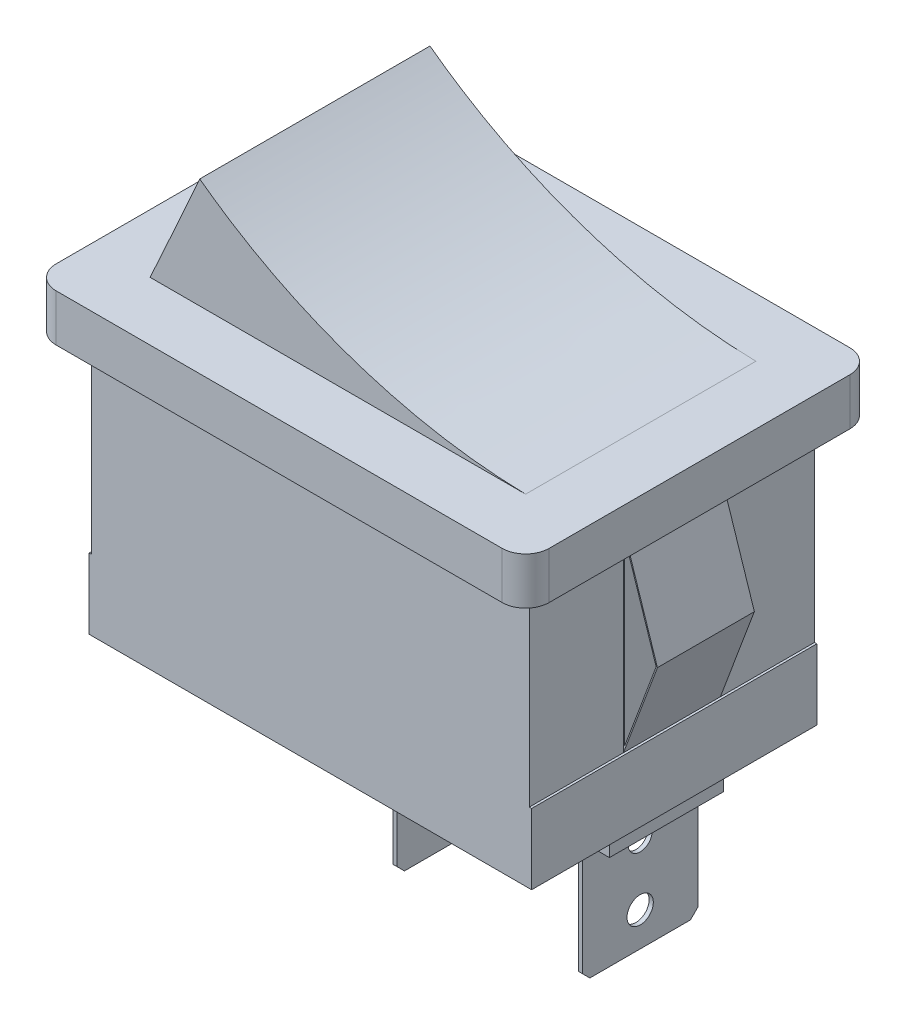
ISO-10303-21;
HEADER;
FILE_DESCRIPTION(('STEP AP214'),'2;1');
FILE_NAME('part.step','',(''),(''),'','','');
FILE_SCHEMA(('AUTOMOTIVE_DESIGN { 1 0 10303 214 1 1 1 1 }'));
ENDSEC;
DATA;
#1=APPLICATION_CONTEXT('core data for automotive mechanical design processes');
#2=APPLICATION_PROTOCOL_DEFINITION('international standard','automotive_design',2000,#1);
#3=PRODUCT_CONTEXT('',#1,'mechanical');
#4=PRODUCT('Part','Part','',(#3));
#5=PRODUCT_RELATED_PRODUCT_CATEGORY('part','',(#4));
#6=PRODUCT_DEFINITION_FORMATION('','',#4);
#7=PRODUCT_DEFINITION_CONTEXT('part definition',#1,'design');
#8=PRODUCT_DEFINITION('design','',#6,#7);
#9=PRODUCT_DEFINITION_SHAPE('','',#8);
#10=(LENGTH_UNIT() NAMED_UNIT(*) SI_UNIT(.MILLI.,.METRE.));
#11=(NAMED_UNIT(*) PLANE_ANGLE_UNIT() SI_UNIT($,.RADIAN.));
#12=(NAMED_UNIT(*) SI_UNIT($,.STERADIAN.) SOLID_ANGLE_UNIT());
#13=UNCERTAINTY_MEASURE_WITH_UNIT(LENGTH_MEASURE(1.E-05),#10,'distance_accuracy_value','');
#14=(GEOMETRIC_REPRESENTATION_CONTEXT(3) GLOBAL_UNCERTAINTY_ASSIGNED_CONTEXT((#13)) GLOBAL_UNIT_ASSIGNED_CONTEXT((#10,
#11,#12)) REPRESENTATION_CONTEXT('',''));
#15=CARTESIAN_POINT('',(0.,0.,0.));
#16=DIRECTION('',(0.,0.,1.));
#17=DIRECTION('',(1.,0.,0.));
#18=AXIS2_PLACEMENT_3D('',#15,#16,#17);
#19=CARTESIAN_POINT('',(-5.88581253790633,17.9879847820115,4.905));
#20=CARTESIAN_POINT('',(-6.92940444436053,15.6378912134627,4.905));
#21=CARTESIAN_POINT('',(-8.,13.3,4.905));
#22=B_SPLINE_CURVE_WITH_KNOTS('',2,(#19,#20,#21),.UNSPECIFIED.,.F.,.F.,(3,3),(0.,1.),.UNSPECIFIED.);
#23=DIRECTION('',(0.,0.,-1.));
#24=VECTOR('',#23,1.);
#25=SURFACE_OF_LINEAR_EXTRUSION('',#22,#24);
#26=CARTESIAN_POINT('',(-5.88581253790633,17.9879847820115,-4.905));
#27=CARTESIAN_POINT('',(-6.92940444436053,15.6378912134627,-4.905));
#28=CARTESIAN_POINT('',(-8.,13.3,-4.905));
#29=B_SPLINE_CURVE_WITH_KNOTS('',2,(#26,#27,#28),.UNSPECIFIED.,.F.,.F.,(3,3),(0.,1.),.UNSPECIFIED.);
#30=CARTESIAN_POINT('',(-5.88581253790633,17.9879847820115,-4.905));
#31=VERTEX_POINT('',#30);
#32=CARTESIAN_POINT('',(-8.,13.3,-4.905));
#33=VERTEX_POINT('',#32);
#34=EDGE_CURVE('E98',#31,#33,#29,.T.);
#35=ORIENTED_EDGE('',*,*,#34,.T.);
#36=DIRECTION('',(0.,0.,-1.));
#37=VECTOR('',#36,1.);
#38=CARTESIAN_POINT('',(-8.,13.3,4.905));
#39=LINE('',#38,#37);
#40=CARTESIAN_POINT('',(-8.,13.3,4.905));
#41=VERTEX_POINT('',#40);
#42=EDGE_CURVE('E12',#41,#33,#39,.T.);
#43=ORIENTED_EDGE('',*,*,#42,.F.);
#44=CARTESIAN_POINT('',(-5.88581253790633,17.9879847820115,4.905));
#45=VERTEX_POINT('',#44);
#46=EDGE_CURVE('E92',#45,#41,#22,.T.);
#47=ORIENTED_EDGE('',*,*,#46,.F.);
#48=DIRECTION('',(0.,0.,-1.));
#49=VECTOR('',#48,1.);
#50=CARTESIAN_POINT('',(-5.88581253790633,17.9879847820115,4.905));
#51=LINE('',#50,#49);
#52=EDGE_CURVE('E99',#45,#31,#51,.T.);
#53=ORIENTED_EDGE('',*,*,#52,.T.);
#54=EDGE_LOOP('',(#35,#43,#47,#53));
#55=FACE_BOUND('',#54,.T.);
#56=ADVANCED_FACE('F51',(#55),#25,.F.);
#57=CARTESIAN_POINT('',(-8.,13.3,4.905));
#58=DIRECTION('',(0.,1.,0.));
#59=DIRECTION('',(0.,0.,1.));
#60=AXIS2_PLACEMENT_3D('',#57,#58,#59);
#61=PLANE('',#60);
#62=DIRECTION('',(1.,0.,0.));
#63=VECTOR('',#62,1.);
#64=CARTESIAN_POINT('',(-8.,13.3,-4.905));
#65=LINE('',#64,#63);
#66=CARTESIAN_POINT('',(8.,13.3,-4.905));
#67=VERTEX_POINT('',#66);
#68=EDGE_CURVE('E80',#33,#67,#65,.T.);
#69=ORIENTED_EDGE('',*,*,#68,.T.);
#70=DIRECTION('',(0.,0.,-1.));
#71=VECTOR('',#70,1.);
#72=CARTESIAN_POINT('',(8.,13.3,4.905));
#73=LINE('',#72,#71);
#74=CARTESIAN_POINT('',(8.,13.3,4.905));
#75=VERTEX_POINT('',#74);
#76=EDGE_CURVE('E60',#75,#67,#73,.T.);
#77=ORIENTED_EDGE('',*,*,#76,.F.);
#78=DIRECTION('',(1.,0.,0.));
#79=VECTOR('',#78,1.);
#80=CARTESIAN_POINT('',(-8.,13.3,4.905));
#81=LINE('',#80,#79);
#82=EDGE_CURVE('E88',#41,#75,#81,.T.);
#83=ORIENTED_EDGE('',*,*,#82,.F.);
#84=ORIENTED_EDGE('',*,*,#42,.T.);
#85=EDGE_LOOP('',(#69,#77,#83,#84));
#86=FACE_BOUND('',#85,.T.);
#87=ADVANCED_FACE('F89',(#86),#61,.F.);
#88=CARTESIAN_POINT('',(8.,13.3,4.905));
#89=CARTESIAN_POINT('',(3.06563642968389,13.390406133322,4.905));
#90=CARTESIAN_POINT('',(-1.9188689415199,15.0438011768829,4.905));
#91=CARTESIAN_POINT('',(-5.88581253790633,17.9879847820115,4.905));
#92=B_SPLINE_CURVE_WITH_KNOTS('',3,(#88,#89,#90,#91),.UNSPECIFIED.,.F.,.F.,(4,4),(0.,1.),.UNSPECIFIED.);
#93=DIRECTION('',(0.,0.,-1.));
#94=VECTOR('',#93,1.);
#95=SURFACE_OF_LINEAR_EXTRUSION('',#92,#94);
#96=CARTESIAN_POINT('',(8.,13.3,-4.905));
#97=CARTESIAN_POINT('',(3.06563642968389,13.390406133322,-4.905));
#98=CARTESIAN_POINT('',(-1.9188689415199,15.0438011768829,-4.905));
#99=CARTESIAN_POINT('',(-5.88581253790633,17.9879847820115,-4.905));
#100=B_SPLINE_CURVE_WITH_KNOTS('',3,(#96,#97,#98,#99),.UNSPECIFIED.,.F.,.F.,(4,4),(0.,1.),.UNSPECIFIED.);
#101=EDGE_CURVE('E85',#67,#31,#100,.T.);
#102=ORIENTED_EDGE('',*,*,#101,.T.);
#103=ORIENTED_EDGE('',*,*,#52,.F.);
#104=EDGE_CURVE('E68',#75,#45,#92,.T.);
#105=ORIENTED_EDGE('',*,*,#104,.F.);
#106=ORIENTED_EDGE('',*,*,#76,.T.);
#107=EDGE_LOOP('',(#102,#103,#105,#106));
#108=FACE_BOUND('',#107,.T.);
#109=ADVANCED_FACE('F119',(#108),#95,.F.);
#110=CARTESIAN_POINT('',(-6.93615535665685,15.6409418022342,4.905));
#111=DIRECTION('',(0.,0.,-1.));
#112=DIRECTION('',(-1.,0.,0.));
#113=AXIS2_PLACEMENT_3D('',#110,#111,#112);
#114=PLANE('',#113);
#115=ORIENTED_EDGE('',*,*,#46,.T.);
#116=ORIENTED_EDGE('',*,*,#82,.T.);
#117=ORIENTED_EDGE('',*,*,#104,.T.);
#118=EDGE_LOOP('',(#115,#116,#117));
#119=FACE_BOUND('',#118,.T.);
#120=ADVANCED_FACE('F95',(#119),#114,.F.);
#121=CARTESIAN_POINT('',(-6.93615535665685,15.6409418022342,-4.905));
#122=DIRECTION('',(0.,0.,-1.));
#123=DIRECTION('',(-1.,0.,0.));
#124=AXIS2_PLACEMENT_3D('',#121,#122,#123);
#125=PLANE('',#124);
#126=ORIENTED_EDGE('',*,*,#34,.F.);
#127=ORIENTED_EDGE('',*,*,#101,.F.);
#128=ORIENTED_EDGE('',*,*,#68,.F.);
#129=EDGE_LOOP('',(#126,#127,#128));
#130=FACE_BOUND('',#129,.T.);
#131=ADVANCED_FACE('F120',(#130),#125,.T.);
#132=CLOSED_SHELL('',(#56,#87,#109,#120,#131));
#133=MANIFOLD_SOLID_BREP('B2',#132);
#134=CARTESIAN_POINT('',(0.,0.,0.));
#135=DIRECTION('',(0.,1.,0.));
#136=DIRECTION('',(0.,0.,1.));
#137=AXIS2_PLACEMENT_3D('',#134,#135,#136);
#138=PLANE('',#137);
#139=DIRECTION('',(0.,0.,1.));
#140=VECTOR('',#139,1.);
#141=CARTESIAN_POINT('',(7.975,0.,-2.76275937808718));
#142=LINE('',#141,#140);
#143=CARTESIAN_POINT('',(7.975,0.,-2.76275937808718));
#144=VERTEX_POINT('',#143);
#145=CARTESIAN_POINT('',(7.975,0.,-2.43));
#146=VERTEX_POINT('',#145);
#147=EDGE_CURVE('E791',#144,#146,#142,.T.);
#148=ORIENTED_EDGE('',*,*,#147,.F.);
#149=DIRECTION('',(-1.,0.,0.));
#150=VECTOR('',#149,1.);
#151=CARTESIAN_POINT('',(7.975,0.,-2.76275937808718));
#152=LINE('',#151,#150);
#153=CARTESIAN_POINT('',(7.795,0.,-2.76275937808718));
#154=VERTEX_POINT('',#153);
#155=EDGE_CURVE('E852',#144,#154,#152,.T.);
#156=ORIENTED_EDGE('',*,*,#155,.T.);
#157=DIRECTION('',(0.,0.,1.));
#158=VECTOR('',#157,1.);
#159=CARTESIAN_POINT('',(7.795,0.,-2.76275937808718));
#160=LINE('',#159,#158);
#161=CARTESIAN_POINT('',(7.795,0.,-2.43));
#162=VERTEX_POINT('',#161);
#163=EDGE_CURVE('E853',#154,#162,#160,.T.);
#164=ORIENTED_EDGE('',*,*,#163,.T.);
#165=DIRECTION('',(1.,0.,0.));
#166=VECTOR('',#165,1.);
#167=CARTESIAN_POINT('',(6.675,0.,-2.43));
#168=LINE('',#167,#166);
#169=CARTESIAN_POINT('',(6.675,0.,-2.43));
#170=VERTEX_POINT('',#169);
#171=EDGE_CURVE('E1519',#170,#162,#168,.T.);
#172=ORIENTED_EDGE('',*,*,#171,.F.);
#173=DIRECTION('',(0.,0.,-1.));
#174=VECTOR('',#173,1.);
#175=CARTESIAN_POINT('',(6.675,0.,2.43));
#176=LINE('',#175,#174);
#177=CARTESIAN_POINT('',(6.675,0.,2.43));
#178=VERTEX_POINT('',#177);
#179=EDGE_CURVE('E1512',#178,#170,#176,.T.);
#180=ORIENTED_EDGE('',*,*,#179,.F.);
#181=DIRECTION('',(-1.,0.,0.));
#182=VECTOR('',#181,1.);
#183=CARTESIAN_POINT('',(6.675,0.,2.43));
#184=LINE('',#183,#182);
#185=CARTESIAN_POINT('',(7.795,0.,2.43));
#186=VERTEX_POINT('',#185);
#187=EDGE_CURVE('E1515',#186,#178,#184,.T.);
#188=ORIENTED_EDGE('',*,*,#187,.F.);
#189=CARTESIAN_POINT('',(7.795,0.,2.76275937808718));
#190=VERTEX_POINT('',#189);
#191=EDGE_CURVE('E783',#186,#190,#160,.T.);
#192=ORIENTED_EDGE('',*,*,#191,.T.);
#193=DIRECTION('',(-1.,0.,0.));
#194=VECTOR('',#193,1.);
#195=CARTESIAN_POINT('',(7.975,0.,2.76275937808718));
#196=LINE('',#195,#194);
#197=CARTESIAN_POINT('',(7.975,0.,2.76275937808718));
#198=VERTEX_POINT('',#197);
#199=EDGE_CURVE('E989',#198,#190,#196,.T.);
#200=ORIENTED_EDGE('',*,*,#199,.F.);
#201=CARTESIAN_POINT('',(7.975,0.,2.43));
#202=VERTEX_POINT('',#201);
#203=EDGE_CURVE('E795',#202,#198,#142,.T.);
#204=ORIENTED_EDGE('',*,*,#203,.F.);
#205=DIRECTION('',(-1.,0.,0.));
#206=VECTOR('',#205,1.);
#207=CARTESIAN_POINT('',(7.975,0.,2.43));
#208=LINE('',#207,#206);
#209=CARTESIAN_POINT('',(9.095,0.,2.43));
#210=VERTEX_POINT('',#209);
#211=EDGE_CURVE('E1469',#210,#202,#208,.T.);
#212=ORIENTED_EDGE('',*,*,#211,.F.);
#213=DIRECTION('',(0.,0.,1.));
#214=VECTOR('',#213,1.);
#215=CARTESIAN_POINT('',(9.095,0.,2.43));
#216=LINE('',#215,#214);
#217=CARTESIAN_POINT('',(9.095,0.,-2.43));
#218=VERTEX_POINT('',#217);
#219=EDGE_CURVE('E1473',#218,#210,#216,.T.);
#220=ORIENTED_EDGE('',*,*,#219,.F.);
#221=DIRECTION('',(1.,0.,0.));
#222=VECTOR('',#221,1.);
#223=CARTESIAN_POINT('',(7.975,0.,-2.43));
#224=LINE('',#223,#222);
#225=EDGE_CURVE('E1477',#146,#218,#224,.T.);
#226=ORIENTED_EDGE('',*,*,#225,.F.);
#227=EDGE_LOOP('',(#148,#156,#164,#172,#180,#188,#192,#200,#204,#212,#220,#226));
#228=FACE_BOUND('',#227,.T.);
#229=DIRECTION('',(0.,0.,-1.));
#230=VECTOR('',#229,1.);
#231=CARTESIAN_POINT('',(-9.125,0.,2.43));
#232=LINE('',#231,#230);
#233=CARTESIAN_POINT('',(-9.125,0.,2.43));
#234=VERTEX_POINT('',#233);
#235=CARTESIAN_POINT('',(-9.125,0.,-2.43));
#236=VERTEX_POINT('',#235);
#237=EDGE_CURVE('E1119',#234,#236,#232,.T.);
#238=ORIENTED_EDGE('',*,*,#237,.F.);
#239=DIRECTION('',(-1.,0.,0.));
#240=VECTOR('',#239,1.);
#241=CARTESIAN_POINT('',(-9.125,0.,2.43));
#242=LINE('',#241,#240);
#243=CARTESIAN_POINT('',(-8.005,0.,2.43));
#244=VERTEX_POINT('',#243);
#245=EDGE_CURVE('E1125',#244,#234,#242,.T.);
#246=ORIENTED_EDGE('',*,*,#245,.F.);
#247=DIRECTION('',(0.,0.,1.));
#248=VECTOR('',#247,1.);
#249=CARTESIAN_POINT('',(-8.005,0.,2.43));
#250=LINE('',#249,#248);
#251=CARTESIAN_POINT('',(-8.005,0.,-2.43));
#252=VERTEX_POINT('',#251);
#253=EDGE_CURVE('E1142',#252,#244,#250,.T.);
#254=ORIENTED_EDGE('',*,*,#253,.F.);
#255=DIRECTION('',(1.,0.,0.));
#256=VECTOR('',#255,1.);
#257=CARTESIAN_POINT('',(-9.125,0.,-2.43));
#258=LINE('',#257,#256);
#259=EDGE_CURVE('E1138',#236,#252,#258,.T.);
#260=ORIENTED_EDGE('',*,*,#259,.F.);
#261=EDGE_LOOP('',(#238,#246,#254,#260));
#262=FACE_BOUND('',#261,.T.);
#263=DIRECTION('',(0.,0.,1.));
#264=VECTOR('',#263,1.);
#265=CARTESIAN_POINT('',(-9.425,0.,6.075));
#266=LINE('',#265,#264);
#267=CARTESIAN_POINT('',(-9.425,0.,-6.075));
#268=VERTEX_POINT('',#267);
#269=CARTESIAN_POINT('',(-9.425,0.,6.075));
#270=VERTEX_POINT('',#269);
#271=EDGE_CURVE('E1433',#268,#270,#266,.T.);
#272=ORIENTED_EDGE('',*,*,#271,.F.);
#273=DIRECTION('',(-1.,0.,0.));
#274=VECTOR('',#273,1.);
#275=CARTESIAN_POINT('',(9.425,0.,-6.075));
#276=LINE('',#275,#274);
#277=CARTESIAN_POINT('',(9.425,0.,-6.075));
#278=VERTEX_POINT('',#277);
#279=EDGE_CURVE('E1439',#278,#268,#276,.T.);
#280=ORIENTED_EDGE('',*,*,#279,.F.);
#281=DIRECTION('',(0.,0.,-1.));
#282=VECTOR('',#281,1.);
#283=CARTESIAN_POINT('',(9.425,0.,6.075));
#284=LINE('',#283,#282);
#285=CARTESIAN_POINT('',(9.425,0.,6.075));
#286=VERTEX_POINT('',#285);
#287=EDGE_CURVE('E1451',#286,#278,#284,.T.);
#288=ORIENTED_EDGE('',*,*,#287,.F.);
#289=DIRECTION('',(1.,0.,0.));
#290=VECTOR('',#289,1.);
#291=CARTESIAN_POINT('',(9.425,0.,6.075));
#292=LINE('',#291,#290);
#293=EDGE_CURVE('E1447',#270,#286,#292,.T.);
#294=ORIENTED_EDGE('',*,*,#293,.F.);
#295=EDGE_LOOP('',(#272,#280,#288,#294));
#296=FACE_BOUND('',#295,.T.);
#297=DIRECTION('',(0.,0.,-1.));
#298=VECTOR('',#297,1.);
#299=CARTESIAN_POINT('',(-7.825,0.,2.43));
#300=LINE('',#299,#298);
#301=CARTESIAN_POINT('',(-7.825,0.,2.43));
#302=VERTEX_POINT('',#301);
#303=CARTESIAN_POINT('',(-7.825,0.,-2.43));
#304=VERTEX_POINT('',#303);
#305=EDGE_CURVE('E1074',#302,#304,#300,.T.);
#306=ORIENTED_EDGE('',*,*,#305,.F.);
#307=DIRECTION('',(-1.,0.,0.));
#308=VECTOR('',#307,1.);
#309=CARTESIAN_POINT('',(-7.825,0.,2.43));
#310=LINE('',#309,#308);
#311=CARTESIAN_POINT('',(-6.705,0.,2.43));
#312=VERTEX_POINT('',#311);
#313=EDGE_CURVE('E1080',#312,#302,#310,.T.);
#314=ORIENTED_EDGE('',*,*,#313,.F.);
#315=DIRECTION('',(0.,0.,1.));
#316=VECTOR('',#315,1.);
#317=CARTESIAN_POINT('',(-6.705,0.,2.43));
#318=LINE('',#317,#316);
#319=CARTESIAN_POINT('',(-6.705,0.,-2.43));
#320=VERTEX_POINT('',#319);
#321=EDGE_CURVE('E1097',#320,#312,#318,.T.);
#322=ORIENTED_EDGE('',*,*,#321,.F.);
#323=DIRECTION('',(1.,0.,0.));
#324=VECTOR('',#323,1.);
#325=CARTESIAN_POINT('',(-7.825,0.,-2.43));
#326=LINE('',#325,#324);
#327=EDGE_CURVE('E1093',#304,#320,#326,.T.);
#328=ORIENTED_EDGE('',*,*,#327,.F.);
#329=EDGE_LOOP('',(#306,#314,#322,#328));
#330=FACE_BOUND('',#329,.T.);
#331=DIRECTION('',(0.,0.,1.));
#332=VECTOR('',#331,1.);
#333=CARTESIAN_POINT('',(0.0750000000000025,0.,-2.76275937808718));
#334=LINE('',#333,#332);
#335=CARTESIAN_POINT('',(0.0750000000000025,0.,-2.76275937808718));
#336=VERTEX_POINT('',#335);
#337=CARTESIAN_POINT('',(0.0750000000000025,0.,-2.43));
#338=VERTEX_POINT('',#337);
#339=EDGE_CURVE('E750',#336,#338,#334,.T.);
#340=ORIENTED_EDGE('',*,*,#339,.F.);
#341=DIRECTION('',(-1.,0.,0.));
#342=VECTOR('',#341,1.);
#343=CARTESIAN_POINT('',(0.0750000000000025,0.,-2.76275937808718));
#344=LINE('',#343,#342);
#345=CARTESIAN_POINT('',(-0.104999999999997,0.,-2.76275937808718));
#346=VERTEX_POINT('',#345);
#347=EDGE_CURVE('E2818',#336,#346,#344,.T.);
#348=ORIENTED_EDGE('',*,*,#347,.T.);
#349=DIRECTION('',(0.,0.,1.));
#350=VECTOR('',#349,1.);
#351=CARTESIAN_POINT('',(-0.104999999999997,0.,-2.76275937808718));
#352=LINE('',#351,#350);
#353=CARTESIAN_POINT('',(-0.104999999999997,0.,-2.43));
#354=VERTEX_POINT('',#353);
#355=EDGE_CURVE('E2753',#346,#354,#352,.T.);
#356=ORIENTED_EDGE('',*,*,#355,.T.);
#357=DIRECTION('',(1.,0.,0.));
#358=VECTOR('',#357,1.);
#359=CARTESIAN_POINT('',(-1.225,0.,-2.43));
#360=LINE('',#359,#358);
#361=CARTESIAN_POINT('',(-1.225,0.,-2.43));
#362=VERTEX_POINT('',#361);
#363=EDGE_CURVE('E1023',#362,#354,#360,.T.);
#364=ORIENTED_EDGE('',*,*,#363,.F.);
#365=DIRECTION('',(0.,0.,-1.));
#366=VECTOR('',#365,1.);
#367=CARTESIAN_POINT('',(-1.225,0.,2.43));
#368=LINE('',#367,#366);
#369=CARTESIAN_POINT('',(-1.225,0.,2.43));
#370=VERTEX_POINT('',#369);
#371=EDGE_CURVE('E1031',#370,#362,#368,.T.);
#372=ORIENTED_EDGE('',*,*,#371,.F.);
#373=DIRECTION('',(-1.,0.,0.));
#374=VECTOR('',#373,1.);
#375=CARTESIAN_POINT('',(-1.225,0.,2.43));
#376=LINE('',#375,#374);
#377=CARTESIAN_POINT('',(-0.104999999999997,0.,2.43));
#378=VERTEX_POINT('',#377);
#379=EDGE_CURVE('E993',#378,#370,#376,.T.);
#380=ORIENTED_EDGE('',*,*,#379,.F.);
#381=CARTESIAN_POINT('',(-0.104999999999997,0.,2.76275937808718));
#382=VERTEX_POINT('',#381);
#383=EDGE_CURVE('E766',#378,#382,#352,.T.);
#384=ORIENTED_EDGE('',*,*,#383,.T.);
#385=DIRECTION('',(-1.,0.,0.));
#386=VECTOR('',#385,1.);
#387=CARTESIAN_POINT('',(0.0750000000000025,0.,2.76275937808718));
#388=LINE('',#387,#386);
#389=CARTESIAN_POINT('',(0.0750000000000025,0.,2.76275937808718));
#390=VERTEX_POINT('',#389);
#391=EDGE_CURVE('E756',#390,#382,#388,.T.);
#392=ORIENTED_EDGE('',*,*,#391,.F.);
#393=CARTESIAN_POINT('',(0.0750000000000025,0.,2.43));
#394=VERTEX_POINT('',#393);
#395=EDGE_CURVE('E739',#394,#390,#334,.T.);
#396=ORIENTED_EDGE('',*,*,#395,.F.);
#397=DIRECTION('',(-1.,0.,0.));
#398=VECTOR('',#397,1.);
#399=CARTESIAN_POINT('',(0.0750000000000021,0.,2.43));
#400=LINE('',#399,#398);
#401=CARTESIAN_POINT('',(1.195,0.,2.43));
#402=VERTEX_POINT('',#401);
#403=EDGE_CURVE('E1035',#402,#394,#400,.T.);
#404=ORIENTED_EDGE('',*,*,#403,.F.);
#405=DIRECTION('',(0.,0.,1.));
#406=VECTOR('',#405,1.);
#407=CARTESIAN_POINT('',(1.195,0.,2.43));
#408=LINE('',#407,#406);
#409=CARTESIAN_POINT('',(1.195,0.,-2.43));
#410=VERTEX_POINT('',#409);
#411=EDGE_CURVE('E1058',#410,#402,#408,.T.);
#412=ORIENTED_EDGE('',*,*,#411,.F.);
#413=DIRECTION('',(1.,0.,0.));
#414=VECTOR('',#413,1.);
#415=CARTESIAN_POINT('',(0.0750000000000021,0.,-2.43));
#416=LINE('',#415,#414);
#417=EDGE_CURVE('E1066',#338,#410,#416,.T.);
#418=ORIENTED_EDGE('',*,*,#417,.F.);
#419=EDGE_LOOP('',(#340,#348,#356,#364,#372,#380,#384,#392,#396,#404,#412,#418));
#420=FACE_BOUND('',#419,.T.);
#421=ADVANCED_FACE('F171',(#228,#262,#296,#330,#420),#138,.F.);
#422=CARTESIAN_POINT('',(15.8,-0.8,0.));
#423=DIRECTION('',(0.,-1.,0.));
#424=DIRECTION('',(0.,0.,-1.));
#425=AXIS2_PLACEMENT_3D('',#422,#423,#424);
#426=PLANE('',#425);
#427=DIRECTION('',(0.,0.,-1.));
#428=VECTOR('',#427,1.);
#429=CARTESIAN_POINT('',(6.675,-0.8,2.43));
#430=LINE('',#429,#428);
#431=CARTESIAN_POINT('',(6.675,-0.8,2.43));
#432=VERTEX_POINT('',#431);
#433=CARTESIAN_POINT('',(6.675,-0.8,-2.43));
#434=VERTEX_POINT('',#433);
#435=EDGE_CURVE('E187',#432,#434,#430,.T.);
#436=ORIENTED_EDGE('',*,*,#435,.T.);
#437=DIRECTION('',(1.,0.,0.));
#438=VECTOR('',#437,1.);
#439=CARTESIAN_POINT('',(6.675,-0.8,-2.43));
#440=LINE('',#439,#438);
#441=CARTESIAN_POINT('',(7.795,-0.8,-2.43));
#442=VERTEX_POINT('',#441);
#443=EDGE_CURVE('E1533',#434,#442,#440,.T.);
#444=ORIENTED_EDGE('',*,*,#443,.T.);
#445=DIRECTION('',(0.,0.,1.));
#446=VECTOR('',#445,1.);
#447=CARTESIAN_POINT('',(7.795,-0.8,2.43));
#448=LINE('',#447,#446);
#449=CARTESIAN_POINT('',(7.795,-0.8,2.43));
#450=VERTEX_POINT('',#449);
#451=EDGE_CURVE('E180',#442,#450,#448,.T.);
#452=ORIENTED_EDGE('',*,*,#451,.T.);
#453=DIRECTION('',(-1.,0.,0.));
#454=VECTOR('',#453,1.);
#455=CARTESIAN_POINT('',(6.675,-0.8,2.43));
#456=LINE('',#455,#454);
#457=EDGE_CURVE('E49',#450,#432,#456,.T.);
#458=ORIENTED_EDGE('',*,*,#457,.T.);
#459=EDGE_LOOP('',(#436,#444,#452,#458));
#460=FACE_BOUND('',#459,.T.);
#461=ADVANCED_FACE('F173',(#460),#426,.T.);
#462=CARTESIAN_POINT('',(6.675,-0.8,2.43));
#463=DIRECTION('',(0.,0.,-1.));
#464=DIRECTION('',(-1.,0.,0.));
#465=AXIS2_PLACEMENT_3D('',#462,#463,#464);
#466=PLANE('',#465);
#467=ORIENTED_EDGE('',*,*,#187,.T.);
#468=DIRECTION('',(0.,1.,0.));
#469=VECTOR('',#468,1.);
#470=CARTESIAN_POINT('',(6.675,-0.8,2.43));
#471=LINE('',#470,#469);
#472=EDGE_CURVE('E1527',#432,#178,#471,.T.);
#473=ORIENTED_EDGE('',*,*,#472,.F.);
#474=ORIENTED_EDGE('',*,*,#457,.F.);
#475=DIRECTION('',(0.,1.,0.));
#476=VECTOR('',#475,1.);
#477=CARTESIAN_POINT('',(7.795,-0.8,2.43));
#478=LINE('',#477,#476);
#479=EDGE_CURVE('E1537',#450,#186,#478,.T.);
#480=ORIENTED_EDGE('',*,*,#479,.T.);
#481=EDGE_LOOP('',(#467,#473,#474,#480));
#482=FACE_BOUND('',#481,.T.);
#483=ADVANCED_FACE('F1548',(#482),#466,.F.);
#484=CARTESIAN_POINT('',(6.675,-0.8,-2.43));
#485=DIRECTION('',(0.,0.,1.));
#486=DIRECTION('',(1.,0.,0.));
#487=AXIS2_PLACEMENT_3D('',#484,#485,#486);
#488=PLANE('',#487);
#489=ORIENTED_EDGE('',*,*,#171,.T.);
#490=DIRECTION('',(0.,1.,0.));
#491=VECTOR('',#490,1.);
#492=CARTESIAN_POINT('',(7.795,-0.8,-2.43));
#493=LINE('',#492,#491);
#494=EDGE_CURVE('E1530',#442,#162,#493,.T.);
#495=ORIENTED_EDGE('',*,*,#494,.F.);
#496=ORIENTED_EDGE('',*,*,#443,.F.);
#497=DIRECTION('',(0.,1.,0.));
#498=VECTOR('',#497,1.);
#499=CARTESIAN_POINT('',(6.675,-0.8,-2.43));
#500=LINE('',#499,#498);
#501=EDGE_CURVE('E192',#434,#170,#500,.T.);
#502=ORIENTED_EDGE('',*,*,#501,.T.);
#503=EDGE_LOOP('',(#489,#495,#496,#502));
#504=FACE_BOUND('',#503,.T.);
#505=ADVANCED_FACE('F1557',(#504),#488,.F.);
#506=CARTESIAN_POINT('',(6.675,-0.8,2.43));
#507=DIRECTION('',(1.,0.,0.));
#508=DIRECTION('',(0.,0.,-1.));
#509=AXIS2_PLACEMENT_3D('',#506,#507,#508);
#510=PLANE('',#509);
#511=ORIENTED_EDGE('',*,*,#179,.T.);
#512=ORIENTED_EDGE('',*,*,#501,.F.);
#513=ORIENTED_EDGE('',*,*,#435,.F.);
#514=ORIENTED_EDGE('',*,*,#472,.T.);
#515=EDGE_LOOP('',(#511,#512,#513,#514));
#516=FACE_BOUND('',#515,.T.);
#517=ADVANCED_FACE('F1550',(#516),#510,.F.);
#518=CARTESIAN_POINT('',(15.8,-0.8,0.));
#519=DIRECTION('',(0.,-1.,0.));
#520=DIRECTION('',(0.,0.,-1.));
#521=AXIS2_PLACEMENT_3D('',#518,#519,#520);
#522=PLANE('',#521);
#523=DIRECTION('',(0.,0.,-1.));
#524=VECTOR('',#523,1.);
#525=CARTESIAN_POINT('',(7.975,-0.8,2.43));
#526=LINE('',#525,#524);
#527=CARTESIAN_POINT('',(7.975,-0.8,2.43));
#528=VERTEX_POINT('',#527);
#529=CARTESIAN_POINT('',(7.975,-0.8,-2.43));
#530=VERTEX_POINT('',#529);
#531=EDGE_CURVE('E1485',#528,#530,#526,.T.);
#532=ORIENTED_EDGE('',*,*,#531,.T.);
#533=DIRECTION('',(1.,0.,0.));
#534=VECTOR('',#533,1.);
#535=CARTESIAN_POINT('',(7.975,-0.8,-2.43));
#536=LINE('',#535,#534);
#537=CARTESIAN_POINT('',(9.095,-0.8,-2.43));
#538=VERTEX_POINT('',#537);
#539=EDGE_CURVE('E1496',#530,#538,#536,.T.);
#540=ORIENTED_EDGE('',*,*,#539,.T.);
#541=DIRECTION('',(0.,0.,1.));
#542=VECTOR('',#541,1.);
#543=CARTESIAN_POINT('',(9.095,-0.8,2.43));
#544=LINE('',#543,#542);
#545=CARTESIAN_POINT('',(9.095,-0.8,2.43));
#546=VERTEX_POINT('',#545);
#547=EDGE_CURVE('E1504',#538,#546,#544,.T.);
#548=ORIENTED_EDGE('',*,*,#547,.T.);
#549=DIRECTION('',(-1.,0.,0.));
#550=VECTOR('',#549,1.);
#551=CARTESIAN_POINT('',(7.975,-0.8,2.43));
#552=LINE('',#551,#550);
#553=EDGE_CURVE('E1508',#546,#528,#552,.T.);
#554=ORIENTED_EDGE('',*,*,#553,.T.);
#555=EDGE_LOOP('',(#532,#540,#548,#554));
#556=FACE_BOUND('',#555,.T.);
#557=ADVANCED_FACE('F1758',(#556),#522,.T.);
#558=CARTESIAN_POINT('',(7.975,-0.8,2.43));
#559=DIRECTION('',(0.,0.,-1.));
#560=DIRECTION('',(-1.,0.,0.));
#561=AXIS2_PLACEMENT_3D('',#558,#559,#560);
#562=PLANE('',#561);
#563=ORIENTED_EDGE('',*,*,#211,.T.);
#564=DIRECTION('',(0.,1.,0.));
#565=VECTOR('',#564,1.);
#566=CARTESIAN_POINT('',(7.975,-0.8,2.43));
#567=LINE('',#566,#565);
#568=EDGE_CURVE('E1489',#528,#202,#567,.T.);
#569=ORIENTED_EDGE('',*,*,#568,.F.);
#570=ORIENTED_EDGE('',*,*,#553,.F.);
#571=DIRECTION('',(0.,1.,0.));
#572=VECTOR('',#571,1.);
#573=CARTESIAN_POINT('',(9.095,-0.8,2.43));
#574=LINE('',#573,#572);
#575=EDGE_CURVE('E1500',#546,#210,#574,.T.);
#576=ORIENTED_EDGE('',*,*,#575,.T.);
#577=EDGE_LOOP('',(#563,#569,#570,#576));
#578=FACE_BOUND('',#577,.T.);
#579=ADVANCED_FACE('F1754',(#578),#562,.F.);
#580=CARTESIAN_POINT('',(9.095,-0.8,2.43));
#581=DIRECTION('',(-1.,0.,0.));
#582=DIRECTION('',(0.,0.,1.));
#583=AXIS2_PLACEMENT_3D('',#580,#581,#582);
#584=PLANE('',#583);
#585=ORIENTED_EDGE('',*,*,#219,.T.);
#586=ORIENTED_EDGE('',*,*,#575,.F.);
#587=ORIENTED_EDGE('',*,*,#547,.F.);
#588=DIRECTION('',(0.,1.,0.));
#589=VECTOR('',#588,1.);
#590=CARTESIAN_POINT('',(9.095,-0.8,-2.43));
#591=LINE('',#590,#589);
#592=EDGE_CURVE('E1492',#538,#218,#591,.T.);
#593=ORIENTED_EDGE('',*,*,#592,.T.);
#594=EDGE_LOOP('',(#585,#586,#587,#593));
#595=FACE_BOUND('',#594,.T.);
#596=ADVANCED_FACE('F1750',(#595),#584,.F.);
#597=CARTESIAN_POINT('',(7.975,-0.8,-2.43));
#598=DIRECTION('',(0.,0.,1.));
#599=DIRECTION('',(1.,0.,0.));
#600=AXIS2_PLACEMENT_3D('',#597,#598,#599);
#601=PLANE('',#600);
#602=ORIENTED_EDGE('',*,*,#225,.T.);
#603=ORIENTED_EDGE('',*,*,#592,.F.);
#604=ORIENTED_EDGE('',*,*,#539,.F.);
#605=DIRECTION('',(0.,1.,0.));
#606=VECTOR('',#605,1.);
#607=CARTESIAN_POINT('',(7.975,-0.8,-2.43));
#608=LINE('',#607,#606);
#609=EDGE_CURVE('E1481',#530,#146,#608,.T.);
#610=ORIENTED_EDGE('',*,*,#609,.T.);
#611=EDGE_LOOP('',(#602,#603,#604,#610));
#612=FACE_BOUND('',#611,.T.);
#613=ADVANCED_FACE('F1725',(#612),#601,.F.);
#614=CARTESIAN_POINT('',(-9.325,0.,0.));
#615=DIRECTION('',(-1.,0.,0.));
#616=DIRECTION('',(0.,0.,-1.));
#617=AXIS2_PLACEMENT_3D('',#614,#615,#616);
#618=PLANE('',#617);
#619=DIRECTION('',(0.,0.,-1.));
#620=VECTOR('',#619,1.);
#621=CARTESIAN_POINT('',(-9.325,3.,6.075));
#622=LINE('',#621,#620);
#623=CARTESIAN_POINT('',(-9.325,3.,-2.065));
#624=VERTEX_POINT('',#623);
#625=CARTESIAN_POINT('',(-9.325,3.,-6.075));
#626=VERTEX_POINT('',#625);
#627=EDGE_CURVE('E1309',#624,#626,#622,.T.);
#628=ORIENTED_EDGE('',*,*,#627,.F.);
#629=DIRECTION('',(0.,-1.,0.));
#630=VECTOR('',#629,1.);
#631=CARTESIAN_POINT('',(-9.325,11.3,-2.065));
#632=LINE('',#631,#630);
#633=CARTESIAN_POINT('',(-9.325,11.3,-2.065));
#634=VERTEX_POINT('',#633);
#635=EDGE_CURVE('E1197',#634,#624,#632,.T.);
#636=ORIENTED_EDGE('',*,*,#635,.F.);
#637=DIRECTION('',(0.,0.,1.));
#638=VECTOR('',#637,1.);
#639=CARTESIAN_POINT('',(-9.325,11.3,6.075));
#640=LINE('',#639,#638);
#641=CARTESIAN_POINT('',(-9.325,11.3,-6.075));
#642=VERTEX_POINT('',#641);
#643=EDGE_CURVE('E1301',#642,#634,#640,.T.);
#644=ORIENTED_EDGE('',*,*,#643,.F.);
#645=DIRECTION('',(0.,1.,0.));
#646=VECTOR('',#645,1.);
#647=CARTESIAN_POINT('',(-9.325,11.3,-6.075));
#648=LINE('',#647,#646);
#649=EDGE_CURVE('E1305',#626,#642,#648,.T.);
#650=ORIENTED_EDGE('',*,*,#649,.F.);
#651=EDGE_LOOP('',(#628,#636,#644,#650));
#652=FACE_BOUND('',#651,.T.);
#653=ADVANCED_FACE('F1717',(#652),#618,.T.);
#654=CARTESIAN_POINT('',(9.325,0.,0.));
#655=DIRECTION('',(1.,0.,0.));
#656=DIRECTION('',(0.,0.,-1.));
#657=AXIS2_PLACEMENT_3D('',#654,#655,#656);
#658=PLANE('',#657);
#659=DIRECTION('',(0.,0.,1.));
#660=VECTOR('',#659,1.);
#661=CARTESIAN_POINT('',(9.325,11.3,6.075));
#662=LINE('',#661,#660);
#663=CARTESIAN_POINT('',(9.325,11.3,-6.075));
#664=VERTEX_POINT('',#663);
#665=CARTESIAN_POINT('',(9.325,11.3,-2.065));
#666=VERTEX_POINT('',#665);
#667=EDGE_CURVE('E1338',#664,#666,#662,.T.);
#668=ORIENTED_EDGE('',*,*,#667,.T.);
#669=DIRECTION('',(0.,-1.,0.));
#670=VECTOR('',#669,1.);
#671=CARTESIAN_POINT('',(9.325,11.3,-2.065));
#672=LINE('',#671,#670);
#673=CARTESIAN_POINT('',(9.325,3.,-2.065));
#674=VERTEX_POINT('',#673);
#675=EDGE_CURVE('E1263',#666,#674,#672,.T.);
#676=ORIENTED_EDGE('',*,*,#675,.T.);
#677=DIRECTION('',(0.,0.,-1.));
#678=VECTOR('',#677,1.);
#679=CARTESIAN_POINT('',(9.325,3.,6.075));
#680=LINE('',#679,#678);
#681=CARTESIAN_POINT('',(9.325,3.,-6.075));
#682=VERTEX_POINT('',#681);
#683=EDGE_CURVE('E1329',#674,#682,#680,.T.);
#684=ORIENTED_EDGE('',*,*,#683,.T.);
#685=DIRECTION('',(0.,1.,0.));
#686=VECTOR('',#685,1.);
#687=CARTESIAN_POINT('',(9.325,11.3,-6.075));
#688=LINE('',#687,#686);
#689=EDGE_CURVE('E1334',#682,#664,#688,.T.);
#690=ORIENTED_EDGE('',*,*,#689,.T.);
#691=EDGE_LOOP('',(#668,#676,#684,#690));
#692=FACE_BOUND('',#691,.T.);
#693=ADVANCED_FACE('F1714',(#692),#658,.T.);
#694=CARTESIAN_POINT('',(-9.425,11.3,6.075));
#695=DIRECTION('',(1.,0.,0.));
#696=DIRECTION('',(0.,0.,-1.));
#697=AXIS2_PLACEMENT_3D('',#694,#695,#696);
#698=PLANE('',#697);
#699=DIRECTION('',(0.,0.,-1.));
#700=VECTOR('',#699,1.);
#701=CARTESIAN_POINT('',(-9.425,3.,6.075));
#702=LINE('',#701,#700);
#703=CARTESIAN_POINT('',(-9.425,3.,6.075));
#704=VERTEX_POINT('',#703);
#705=CARTESIAN_POINT('',(-9.425,3.,-6.075));
#706=VERTEX_POINT('',#705);
#707=EDGE_CURVE('E1295',#704,#706,#702,.T.);
#708=ORIENTED_EDGE('',*,*,#707,.T.);
#709=DIRECTION('',(0.,-1.,0.));
#710=VECTOR('',#709,1.);
#711=CARTESIAN_POINT('',(-9.425,11.3,-6.075));
#712=LINE('',#711,#710);
#713=EDGE_CURVE('E1443',#706,#268,#712,.T.);
#714=ORIENTED_EDGE('',*,*,#713,.T.);
#715=ORIENTED_EDGE('',*,*,#271,.T.);
#716=DIRECTION('',(0.,-1.,0.));
#717=VECTOR('',#716,1.);
#718=CARTESIAN_POINT('',(-9.425,11.3,6.075));
#719=LINE('',#718,#717);
#720=EDGE_CURVE('E1466',#704,#270,#719,.T.);
#721=ORIENTED_EDGE('',*,*,#720,.F.);
#722=EDGE_LOOP('',(#708,#714,#715,#721));
#723=FACE_BOUND('',#722,.T.);
#724=ADVANCED_FACE('F1716',(#723),#698,.F.);
#725=CARTESIAN_POINT('',(9.425,11.3,6.075));
#726=DIRECTION('',(0.,0.,-1.));
#727=DIRECTION('',(-1.,0.,0.));
#728=AXIS2_PLACEMENT_3D('',#725,#726,#727);
#729=PLANE('',#728);
#730=DIRECTION('',(-1.,0.,0.));
#731=VECTOR('',#730,1.);
#732=CARTESIAN_POINT('',(-9.325,3.,6.075));
#733=LINE('',#732,#731);
#734=CARTESIAN_POINT('',(-9.325,3.,6.075));
#735=VERTEX_POINT('',#734);
#736=EDGE_CURVE('E1318',#735,#704,#733,.T.);
#737=ORIENTED_EDGE('',*,*,#736,.T.);
#738=ORIENTED_EDGE('',*,*,#720,.T.);
#739=ORIENTED_EDGE('',*,*,#293,.T.);
#740=DIRECTION('',(0.,-1.,0.));
#741=VECTOR('',#740,1.);
#742=CARTESIAN_POINT('',(9.425,11.3,6.075));
#743=LINE('',#742,#741);
#744=CARTESIAN_POINT('',(9.425,3.,6.075));
#745=VERTEX_POINT('',#744);
#746=EDGE_CURVE('E1463',#745,#286,#743,.T.);
#747=ORIENTED_EDGE('',*,*,#746,.F.);
#748=DIRECTION('',(1.,0.,0.));
#749=VECTOR('',#748,1.);
#750=CARTESIAN_POINT('',(9.325,3.,6.075));
#751=LINE('',#750,#749);
#752=CARTESIAN_POINT('',(9.325,3.,6.075));
#753=VERTEX_POINT('',#752);
#754=EDGE_CURVE('E1342',#753,#745,#751,.T.);
#755=ORIENTED_EDGE('',*,*,#754,.F.);
#756=DIRECTION('',(0.,-1.,0.));
#757=VECTOR('',#756,1.);
#758=CARTESIAN_POINT('',(9.325,11.3,6.075));
#759=LINE('',#758,#757);
#760=CARTESIAN_POINT('',(9.325,11.3,6.075));
#761=VERTEX_POINT('',#760);
#762=EDGE_CURVE('E1325',#761,#753,#759,.T.);
#763=ORIENTED_EDGE('',*,*,#762,.F.);
#764=DIRECTION('',(1.,0.,0.));
#765=VECTOR('',#764,1.);
#766=CARTESIAN_POINT('',(9.425,11.3,6.075));
#767=LINE('',#766,#765);
#768=CARTESIAN_POINT('',(-9.325,11.3,6.075));
#769=VERTEX_POINT('',#768);
#770=EDGE_CURVE('E1434',#769,#761,#767,.T.);
#771=ORIENTED_EDGE('',*,*,#770,.F.);
#772=DIRECTION('',(0.,-1.,0.));
#773=VECTOR('',#772,1.);
#774=CARTESIAN_POINT('',(-9.325,11.3,6.075));
#775=LINE('',#774,#773);
#776=EDGE_CURVE('E1296',#769,#735,#775,.T.);
#777=ORIENTED_EDGE('',*,*,#776,.T.);
#778=EDGE_LOOP('',(#737,#738,#739,#747,#755,#763,#771,#777));
#779=FACE_BOUND('',#778,.T.);
#780=ADVANCED_FACE('F1676',(#779),#729,.F.);
#781=CARTESIAN_POINT('',(9.425,11.3,-6.075));
#782=DIRECTION('',(0.,0.,1.));
#783=DIRECTION('',(1.,0.,0.));
#784=AXIS2_PLACEMENT_3D('',#781,#782,#783);
#785=PLANE('',#784);
#786=DIRECTION('',(-1.,0.,0.));
#787=VECTOR('',#786,1.);
#788=CARTESIAN_POINT('',(-9.325,3.,-6.075));
#789=LINE('',#788,#787);
#790=EDGE_CURVE('E1314',#626,#706,#789,.T.);
#791=ORIENTED_EDGE('',*,*,#790,.F.);
#792=ORIENTED_EDGE('',*,*,#649,.T.);
#793=DIRECTION('',(-1.,0.,0.));
#794=VECTOR('',#793,1.);
#795=CARTESIAN_POINT('',(9.425,11.3,-6.075));
#796=LINE('',#795,#794);
#797=EDGE_CURVE('E1438',#664,#642,#796,.T.);
#798=ORIENTED_EDGE('',*,*,#797,.F.);
#799=ORIENTED_EDGE('',*,*,#689,.F.);
#800=DIRECTION('',(1.,0.,0.));
#801=VECTOR('',#800,1.);
#802=CARTESIAN_POINT('',(9.325,3.,-6.075));
#803=LINE('',#802,#801);
#804=CARTESIAN_POINT('',(9.425,3.,-6.075));
#805=VERTEX_POINT('',#804);
#806=EDGE_CURVE('E1345',#682,#805,#803,.T.);
#807=ORIENTED_EDGE('',*,*,#806,.T.);
#808=DIRECTION('',(0.,-1.,0.));
#809=VECTOR('',#808,1.);
#810=CARTESIAN_POINT('',(9.425,11.3,-6.075));
#811=LINE('',#810,#809);
#812=EDGE_CURVE('E1460',#805,#278,#811,.T.);
#813=ORIENTED_EDGE('',*,*,#812,.T.);
#814=ORIENTED_EDGE('',*,*,#279,.T.);
#815=ORIENTED_EDGE('',*,*,#713,.F.);
#816=EDGE_LOOP('',(#791,#792,#798,#799,#807,#813,#814,#815));
#817=FACE_BOUND('',#816,.T.);
#818=ADVANCED_FACE('F1689',(#817),#785,.F.);
#819=CARTESIAN_POINT('',(9.425,11.3,6.075));
#820=DIRECTION('',(-1.,0.,0.));
#821=DIRECTION('',(0.,0.,1.));
#822=AXIS2_PLACEMENT_3D('',#819,#820,#821);
#823=PLANE('',#822);
#824=ORIENTED_EDGE('',*,*,#812,.F.);
#825=DIRECTION('',(0.,0.,-1.));
#826=VECTOR('',#825,1.);
#827=CARTESIAN_POINT('',(9.425,3.,6.075));
#828=LINE('',#827,#826);
#829=EDGE_CURVE('E1322',#745,#805,#828,.T.);
#830=ORIENTED_EDGE('',*,*,#829,.F.);
#831=ORIENTED_EDGE('',*,*,#746,.T.);
#832=ORIENTED_EDGE('',*,*,#287,.T.);
#833=EDGE_LOOP('',(#824,#830,#831,#832));
#834=FACE_BOUND('',#833,.T.);
#835=ADVANCED_FACE('F1684',(#834),#823,.F.);
#836=CARTESIAN_POINT('',(9.5,11.3,-6.405));
#837=DIRECTION('',(0.,1.,0.));
#838=DIRECTION('',(0.,0.,1.));
#839=AXIS2_PLACEMENT_3D('',#836,#837,#838);
#840=PLANE('',#839);
#841=ORIENTED_EDGE('',*,*,#643,.T.);
#842=DIRECTION('',(0.,0.,-1.));
#843=VECTOR('',#842,1.);
#844=CARTESIAN_POINT('',(-9.325,11.3,2.065));
#845=LINE('',#844,#843);
#846=CARTESIAN_POINT('',(-9.325,11.3,2.065));
#847=VERTEX_POINT('',#846);
#848=EDGE_CURVE('E1226',#847,#634,#845,.T.);
#849=ORIENTED_EDGE('',*,*,#848,.F.);
#850=EDGE_CURVE('E1300',#847,#769,#640,.T.);
#851=ORIENTED_EDGE('',*,*,#850,.T.);
#852=ORIENTED_EDGE('',*,*,#770,.T.);
#853=CARTESIAN_POINT('',(9.325,11.3,2.065));
#854=VERTEX_POINT('',#853);
#855=EDGE_CURVE('E1337',#854,#761,#662,.T.);
#856=ORIENTED_EDGE('',*,*,#855,.F.);
#857=DIRECTION('',(0.,0.,-1.));
#858=VECTOR('',#857,1.);
#859=CARTESIAN_POINT('',(9.325,11.3,2.065));
#860=LINE('',#859,#858);
#861=EDGE_CURVE('E1276',#854,#666,#860,.T.);
#862=ORIENTED_EDGE('',*,*,#861,.T.);
#863=ORIENTED_EDGE('',*,*,#667,.F.);
#864=ORIENTED_EDGE('',*,*,#797,.T.);
#865=EDGE_LOOP('',(#841,#849,#851,#852,#856,#862,#863,#864));
#866=FACE_BOUND('',#865,.T.);
#867=CARTESIAN_POINT('',(9.5,11.3,-6.405));
#868=DIRECTION('',(0.,1.,0.));
#869=DIRECTION('',(0.,0.,1.));
#870=AXIS2_PLACEMENT_3D('',#867,#868,#869);
#871=CIRCLE('',#870,1.);
#872=CARTESIAN_POINT('',(10.5,11.3,-6.40499999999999));
#873=VERTEX_POINT('',#872);
#874=CARTESIAN_POINT('',(9.49999999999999,11.3,-7.405));
#875=VERTEX_POINT('',#874);
#876=EDGE_CURVE('E1349',#873,#875,#871,.T.);
#877=ORIENTED_EDGE('',*,*,#876,.F.);
#878=DIRECTION('',(0.,0.,-1.));
#879=VECTOR('',#878,1.);
#880=CARTESIAN_POINT('',(10.5,11.3,6.40499999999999));
#881=LINE('',#880,#879);
#882=CARTESIAN_POINT('',(10.5,11.3,6.40499999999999));
#883=VERTEX_POINT('',#882);
#884=EDGE_CURVE('E1357',#883,#873,#881,.T.);
#885=ORIENTED_EDGE('',*,*,#884,.F.);
#886=CARTESIAN_POINT('',(9.5,11.3,6.405));
#887=DIRECTION('',(0.,1.,0.));
#888=DIRECTION('',(0.,0.,1.));
#889=AXIS2_PLACEMENT_3D('',#886,#887,#888);
#890=CIRCLE('',#889,1.);
#891=CARTESIAN_POINT('',(9.49999999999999,11.3,7.405));
#892=VERTEX_POINT('',#891);
#893=EDGE_CURVE('E1397',#892,#883,#890,.T.);
#894=ORIENTED_EDGE('',*,*,#893,.F.);
#895=DIRECTION('',(1.,0.,0.));
#896=VECTOR('',#895,1.);
#897=CARTESIAN_POINT('',(9.49999999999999,11.3,7.405));
#898=LINE('',#897,#896);
#899=CARTESIAN_POINT('',(-9.49999999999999,11.3,7.405));
#900=VERTEX_POINT('',#899);
#901=EDGE_CURVE('E1394',#900,#892,#898,.T.);
#902=ORIENTED_EDGE('',*,*,#901,.F.);
#903=CARTESIAN_POINT('',(-9.5,11.3,6.405));
#904=DIRECTION('',(0.,1.,0.));
#905=DIRECTION('',(0.,0.,-1.));
#906=AXIS2_PLACEMENT_3D('',#903,#904,#905);
#907=CIRCLE('',#906,1.);
#908=CARTESIAN_POINT('',(-10.5,11.3,6.40499999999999));
#909=VERTEX_POINT('',#908);
#910=EDGE_CURVE('E1391',#909,#900,#907,.T.);
#911=ORIENTED_EDGE('',*,*,#910,.F.);
#912=DIRECTION('',(0.,0.,1.));
#913=VECTOR('',#912,1.);
#914=CARTESIAN_POINT('',(-10.5,11.3,6.40499999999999));
#915=LINE('',#914,#913);
#916=CARTESIAN_POINT('',(-10.5,11.3,-6.40499999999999));
#917=VERTEX_POINT('',#916);
#918=EDGE_CURVE('E1388',#917,#909,#915,.T.);
#919=ORIENTED_EDGE('',*,*,#918,.F.);
#920=CARTESIAN_POINT('',(-9.5,11.3,-6.405));
#921=DIRECTION('',(0.,1.,0.));
#922=DIRECTION('',(0.,0.,1.));
#923=AXIS2_PLACEMENT_3D('',#920,#921,#922);
#924=CIRCLE('',#923,1.);
#925=CARTESIAN_POINT('',(-9.49999999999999,11.3,-7.405));
#926=VERTEX_POINT('',#925);
#927=EDGE_CURVE('E1385',#926,#917,#924,.T.);
#928=ORIENTED_EDGE('',*,*,#927,.F.);
#929=DIRECTION('',(-1.,0.,0.));
#930=VECTOR('',#929,1.);
#931=CARTESIAN_POINT('',(9.49999999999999,11.3,-7.405));
#932=LINE('',#931,#930);
#933=EDGE_CURVE('E1382',#875,#926,#932,.T.);
#934=ORIENTED_EDGE('',*,*,#933,.F.);
#935=EDGE_LOOP('',(#877,#885,#894,#902,#911,#919,#928,#934));
#936=FACE_BOUND('',#935,.T.);
#937=ADVANCED_FACE('F1670',(#866,#936),#840,.F.);
#938=CARTESIAN_POINT('',(9.5,13.3,-6.405));
#939=DIRECTION('',(0.,-1.,0.));
#940=DIRECTION('',(0.,0.,-1.));
#941=AXIS2_PLACEMENT_3D('',#938,#939,#940);
#942=CYLINDRICAL_SURFACE('',#941,1.);
#943=ORIENTED_EDGE('',*,*,#876,.T.);
#944=DIRECTION('',(0.,-1.,0.));
#945=VECTOR('',#944,1.);
#946=CARTESIAN_POINT('',(9.49999999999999,13.3,-7.405));
#947=LINE('',#946,#945);
#948=CARTESIAN_POINT('',(9.49999999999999,13.3,-7.405));
#949=VERTEX_POINT('',#948);
#950=EDGE_CURVE('E1429',#949,#875,#947,.T.);
#951=ORIENTED_EDGE('',*,*,#950,.F.);
#952=CARTESIAN_POINT('',(9.5,13.3,-6.405));
#953=DIRECTION('',(0.,1.,0.));
#954=DIRECTION('',(0.,0.,1.));
#955=AXIS2_PLACEMENT_3D('',#952,#953,#954);
#956=CIRCLE('',#955,1.);
#957=CARTESIAN_POINT('',(10.5,13.3,-6.40499999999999));
#958=VERTEX_POINT('',#957);
#959=EDGE_CURVE('E1352',#958,#949,#956,.T.);
#960=ORIENTED_EDGE('',*,*,#959,.F.);
#961=DIRECTION('',(0.,-1.,0.));
#962=VECTOR('',#961,1.);
#963=CARTESIAN_POINT('',(10.5,13.3,-6.40499999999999));
#964=LINE('',#963,#962);
#965=EDGE_CURVE('E1378',#958,#873,#964,.T.);
#966=ORIENTED_EDGE('',*,*,#965,.T.);
#967=EDGE_LOOP('',(#943,#951,#960,#966));
#968=FACE_BOUND('',#967,.T.);
#969=ADVANCED_FACE('F1740',(#968),#942,.T.);
#970=CARTESIAN_POINT('',(9.49999999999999,13.3,-7.405));
#971=DIRECTION('',(0.,0.,1.));
#972=DIRECTION('',(1.,0.,0.));
#973=AXIS2_PLACEMENT_3D('',#970,#971,#972);
#974=PLANE('',#973);
#975=ORIENTED_EDGE('',*,*,#933,.T.);
#976=DIRECTION('',(0.,-1.,0.));
#977=VECTOR('',#976,1.);
#978=CARTESIAN_POINT('',(-9.49999999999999,13.3,-7.405));
#979=LINE('',#978,#977);
#980=CARTESIAN_POINT('',(-9.49999999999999,13.3,-7.405));
#981=VERTEX_POINT('',#980);
#982=EDGE_CURVE('E1425',#981,#926,#979,.T.);
#983=ORIENTED_EDGE('',*,*,#982,.F.);
#984=DIRECTION('',(-1.,0.,0.));
#985=VECTOR('',#984,1.);
#986=CARTESIAN_POINT('',(9.49999999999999,13.3,-7.405));
#987=LINE('',#986,#985);
#988=EDGE_CURVE('E1356',#949,#981,#987,.T.);
#989=ORIENTED_EDGE('',*,*,#988,.F.);
#990=ORIENTED_EDGE('',*,*,#950,.T.);
#991=EDGE_LOOP('',(#975,#983,#989,#990));
#992=FACE_BOUND('',#991,.T.);
#993=ADVANCED_FACE('F2689',(#992),#974,.F.);
#994=CARTESIAN_POINT('',(-9.5,13.3,-6.405));
#995=DIRECTION('',(0.,-1.,0.));
#996=DIRECTION('',(0.,0.,-1.));
#997=AXIS2_PLACEMENT_3D('',#994,#995,#996);
#998=CYLINDRICAL_SURFACE('',#997,1.);
#999=ORIENTED_EDGE('',*,*,#927,.T.);
#1000=DIRECTION('',(0.,-1.,0.));
#1001=VECTOR('',#1000,1.);
#1002=CARTESIAN_POINT('',(-10.5,13.3,-6.40499999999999));
#1003=LINE('',#1002,#1001);
#1004=CARTESIAN_POINT('',(-10.5,13.3,-6.40499999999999));
#1005=VERTEX_POINT('',#1004);
#1006=EDGE_CURVE('E1421',#1005,#917,#1003,.T.);
#1007=ORIENTED_EDGE('',*,*,#1006,.F.);
#1008=CARTESIAN_POINT('',(-9.5,13.3,-6.405));
#1009=DIRECTION('',(0.,1.,0.));
#1010=DIRECTION('',(0.,0.,1.));
#1011=AXIS2_PLACEMENT_3D('',#1008,#1009,#1010);
#1012=CIRCLE('',#1011,1.);
#1013=EDGE_CURVE('E1360',#981,#1005,#1012,.T.);
#1014=ORIENTED_EDGE('',*,*,#1013,.F.);
#1015=ORIENTED_EDGE('',*,*,#982,.T.);
#1016=EDGE_LOOP('',(#999,#1007,#1014,#1015));
#1017=FACE_BOUND('',#1016,.T.);
#1018=ADVANCED_FACE('F2679',(#1017),#998,.T.);
#1019=CARTESIAN_POINT('',(-10.5,13.3,6.40499999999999));
#1020=DIRECTION('',(1.,0.,0.));
#1021=DIRECTION('',(0.,0.,-1.));
#1022=AXIS2_PLACEMENT_3D('',#1019,#1020,#1021);
#1023=PLANE('',#1022);
#1024=ORIENTED_EDGE('',*,*,#918,.T.);
#1025=DIRECTION('',(0.,-1.,0.));
#1026=VECTOR('',#1025,1.);
#1027=CARTESIAN_POINT('',(-10.5,13.3,6.40499999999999));
#1028=LINE('',#1027,#1026);
#1029=CARTESIAN_POINT('',(-10.5,13.3,6.40499999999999));
#1030=VERTEX_POINT('',#1029);
#1031=EDGE_CURVE('E1417',#1030,#909,#1028,.T.);
#1032=ORIENTED_EDGE('',*,*,#1031,.F.);
#1033=DIRECTION('',(0.,0.,1.));
#1034=VECTOR('',#1033,1.);
#1035=CARTESIAN_POINT('',(-10.5,13.3,6.40499999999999));
#1036=LINE('',#1035,#1034);
#1037=EDGE_CURVE('E1363',#1005,#1030,#1036,.T.);
#1038=ORIENTED_EDGE('',*,*,#1037,.F.);
#1039=ORIENTED_EDGE('',*,*,#1006,.T.);
#1040=EDGE_LOOP('',(#1024,#1032,#1038,#1039));
#1041=FACE_BOUND('',#1040,.T.);
#1042=ADVANCED_FACE('F2669',(#1041),#1023,.F.);
#1043=CARTESIAN_POINT('',(-9.5,13.3,6.405));
#1044=DIRECTION('',(0.,-1.,0.));
#1045=DIRECTION('',(0.,0.,-1.));
#1046=AXIS2_PLACEMENT_3D('',#1043,#1044,#1045);
#1047=CYLINDRICAL_SURFACE('',#1046,1.);
#1048=ORIENTED_EDGE('',*,*,#910,.T.);
#1049=DIRECTION('',(0.,-1.,0.));
#1050=VECTOR('',#1049,1.);
#1051=CARTESIAN_POINT('',(-9.49999999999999,13.3,7.405));
#1052=LINE('',#1051,#1050);
#1053=CARTESIAN_POINT('',(-9.49999999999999,13.3,7.405));
#1054=VERTEX_POINT('',#1053);
#1055=EDGE_CURVE('E1413',#1054,#900,#1052,.T.);
#1056=ORIENTED_EDGE('',*,*,#1055,.F.);
#1057=CARTESIAN_POINT('',(-9.5,13.3,6.405));
#1058=DIRECTION('',(0.,1.,0.));
#1059=DIRECTION('',(0.,0.,-1.));
#1060=AXIS2_PLACEMENT_3D('',#1057,#1058,#1059);
#1061=CIRCLE('',#1060,1.);
#1062=EDGE_CURVE('E1366',#1030,#1054,#1061,.T.);
#1063=ORIENTED_EDGE('',*,*,#1062,.F.);
#1064=ORIENTED_EDGE('',*,*,#1031,.T.);
#1065=EDGE_LOOP('',(#1048,#1056,#1063,#1064));
#1066=FACE_BOUND('',#1065,.T.);
#1067=ADVANCED_FACE('F2659',(#1066),#1047,.T.);
#1068=CARTESIAN_POINT('',(9.49999999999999,13.3,7.405));
#1069=DIRECTION('',(0.,0.,-1.));
#1070=DIRECTION('',(-1.,0.,0.));
#1071=AXIS2_PLACEMENT_3D('',#1068,#1069,#1070);
#1072=PLANE('',#1071);
#1073=ORIENTED_EDGE('',*,*,#901,.T.);
#1074=DIRECTION('',(0.,-1.,0.));
#1075=VECTOR('',#1074,1.);
#1076=CARTESIAN_POINT('',(9.49999999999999,13.3,7.405));
#1077=LINE('',#1076,#1075);
#1078=CARTESIAN_POINT('',(9.49999999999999,13.3,7.405));
#1079=VERTEX_POINT('',#1078);
#1080=EDGE_CURVE('E1409',#1079,#892,#1077,.T.);
#1081=ORIENTED_EDGE('',*,*,#1080,.F.);
#1082=DIRECTION('',(1.,0.,0.));
#1083=VECTOR('',#1082,1.);
#1084=CARTESIAN_POINT('',(9.49999999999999,13.3,7.405));
#1085=LINE('',#1084,#1083);
#1086=EDGE_CURVE('E1369',#1054,#1079,#1085,.T.);
#1087=ORIENTED_EDGE('',*,*,#1086,.F.);
#1088=ORIENTED_EDGE('',*,*,#1055,.T.);
#1089=EDGE_LOOP('',(#1073,#1081,#1087,#1088));
#1090=FACE_BOUND('',#1089,.T.);
#1091=ADVANCED_FACE('F2649',(#1090),#1072,.F.);
#1092=CARTESIAN_POINT('',(9.5,13.3,6.405));
#1093=DIRECTION('',(0.,-1.,0.));
#1094=DIRECTION('',(0.,0.,-1.));
#1095=AXIS2_PLACEMENT_3D('',#1092,#1093,#1094);
#1096=CYLINDRICAL_SURFACE('',#1095,1.);
#1097=ORIENTED_EDGE('',*,*,#893,.T.);
#1098=DIRECTION('',(0.,-1.,0.));
#1099=VECTOR('',#1098,1.);
#1100=CARTESIAN_POINT('',(10.5,13.3,6.40499999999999));
#1101=LINE('',#1100,#1099);
#1102=CARTESIAN_POINT('',(10.5,13.3,6.40499999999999));
#1103=VERTEX_POINT('',#1102);
#1104=EDGE_CURVE('E1405',#1103,#883,#1101,.T.);
#1105=ORIENTED_EDGE('',*,*,#1104,.F.);
#1106=CARTESIAN_POINT('',(9.5,13.3,6.405));
#1107=DIRECTION('',(0.,1.,0.));
#1108=DIRECTION('',(0.,0.,1.));
#1109=AXIS2_PLACEMENT_3D('',#1106,#1107,#1108);
#1110=CIRCLE('',#1109,1.);
#1111=EDGE_CURVE('E1372',#1079,#1103,#1110,.T.);
#1112=ORIENTED_EDGE('',*,*,#1111,.F.);
#1113=ORIENTED_EDGE('',*,*,#1080,.T.);
#1114=EDGE_LOOP('',(#1097,#1105,#1112,#1113));
#1115=FACE_BOUND('',#1114,.T.);
#1116=ADVANCED_FACE('F2639',(#1115),#1096,.T.);
#1117=CARTESIAN_POINT('',(10.5,13.3,6.40499999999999));
#1118=DIRECTION('',(-1.,0.,0.));
#1119=DIRECTION('',(0.,0.,1.));
#1120=AXIS2_PLACEMENT_3D('',#1117,#1118,#1119);
#1121=PLANE('',#1120);
#1122=ORIENTED_EDGE('',*,*,#884,.T.);
#1123=ORIENTED_EDGE('',*,*,#965,.F.);
#1124=DIRECTION('',(0.,0.,-1.));
#1125=VECTOR('',#1124,1.);
#1126=CARTESIAN_POINT('',(10.5,13.3,6.40499999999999));
#1127=LINE('',#1126,#1125);
#1128=EDGE_CURVE('E1375',#1103,#958,#1127,.T.);
#1129=ORIENTED_EDGE('',*,*,#1128,.F.);
#1130=ORIENTED_EDGE('',*,*,#1104,.T.);
#1131=EDGE_LOOP('',(#1122,#1123,#1129,#1130));
#1132=FACE_BOUND('',#1131,.T.);
#1133=ADVANCED_FACE('F2629',(#1132),#1121,.F.);
#1134=CARTESIAN_POINT('',(9.5,13.3,-6.405));
#1135=DIRECTION('',(0.,1.,0.));
#1136=DIRECTION('',(0.,0.,1.));
#1137=AXIS2_PLACEMENT_3D('',#1134,#1135,#1136);
#1138=PLANE('',#1137);
#1139=ORIENTED_EDGE('',*,*,#959,.T.);
#1140=ORIENTED_EDGE('',*,*,#988,.T.);
#1141=ORIENTED_EDGE('',*,*,#1013,.T.);
#1142=ORIENTED_EDGE('',*,*,#1037,.T.);
#1143=ORIENTED_EDGE('',*,*,#1062,.T.);
#1144=ORIENTED_EDGE('',*,*,#1086,.T.);
#1145=ORIENTED_EDGE('',*,*,#1111,.T.);
#1146=ORIENTED_EDGE('',*,*,#1128,.T.);
#1147=EDGE_LOOP('',(#1139,#1140,#1141,#1142,#1143,#1144,#1145,#1146));
#1148=FACE_BOUND('',#1147,.T.);
#1149=ADVANCED_FACE('F2597',(#1148),#1138,.T.);
#1150=CARTESIAN_POINT('',(9.325,3.,6.075));
#1151=DIRECTION('',(0.,-1.,0.));
#1152=DIRECTION('',(0.,0.,-1.));
#1153=AXIS2_PLACEMENT_3D('',#1150,#1151,#1152);
#1154=PLANE('',#1153);
#1155=ORIENTED_EDGE('',*,*,#829,.T.);
#1156=ORIENTED_EDGE('',*,*,#806,.F.);
#1157=ORIENTED_EDGE('',*,*,#683,.F.);
#1158=DIRECTION('',(0.,0.,-1.));
#1159=VECTOR('',#1158,1.);
#1160=CARTESIAN_POINT('',(9.325,3.,2.065));
#1161=LINE('',#1160,#1159);
#1162=CARTESIAN_POINT('',(9.325,3.,2.065));
#1163=VERTEX_POINT('',#1162);
#1164=EDGE_CURVE('E1291',#1163,#674,#1161,.T.);
#1165=ORIENTED_EDGE('',*,*,#1164,.F.);
#1166=EDGE_CURVE('E1330',#753,#1163,#680,.T.);
#1167=ORIENTED_EDGE('',*,*,#1166,.F.);
#1168=ORIENTED_EDGE('',*,*,#754,.T.);
#1169=EDGE_LOOP('',(#1155,#1156,#1157,#1165,#1167,#1168));
#1170=FACE_BOUND('',#1169,.T.);
#1171=ADVANCED_FACE('F1680',(#1170),#1154,.F.);
#1172=DIRECTION('',(0.,-1.,0.));
#1173=VECTOR('',#1172,1.);
#1174=CARTESIAN_POINT('',(9.325,11.3,2.065));
#1175=LINE('',#1174,#1173);
#1176=EDGE_CURVE('E1264',#854,#1163,#1175,.T.);
#1177=ORIENTED_EDGE('',*,*,#1176,.F.);
#1178=ORIENTED_EDGE('',*,*,#855,.T.);
#1179=ORIENTED_EDGE('',*,*,#762,.T.);
#1180=ORIENTED_EDGE('',*,*,#1166,.T.);
#1181=EDGE_LOOP('',(#1177,#1178,#1179,#1180));
#1182=FACE_BOUND('',#1181,.T.);
#1183=ADVANCED_FACE('F1665',(#1182),#658,.T.);
#1184=CARTESIAN_POINT('',(-9.325,3.,6.075));
#1185=DIRECTION('',(0.,1.,0.));
#1186=DIRECTION('',(0.,0.,1.));
#1187=AXIS2_PLACEMENT_3D('',#1184,#1185,#1186);
#1188=PLANE('',#1187);
#1189=ORIENTED_EDGE('',*,*,#707,.F.);
#1190=ORIENTED_EDGE('',*,*,#736,.F.);
#1191=CARTESIAN_POINT('',(-9.325,3.,2.065));
#1192=VERTEX_POINT('',#1191);
#1193=EDGE_CURVE('E1310',#735,#1192,#622,.T.);
#1194=ORIENTED_EDGE('',*,*,#1193,.T.);
#1195=DIRECTION('',(0.,0.,-1.));
#1196=VECTOR('',#1195,1.);
#1197=CARTESIAN_POINT('',(-9.325,3.,2.065));
#1198=LINE('',#1197,#1196);
#1199=EDGE_CURVE('E1211',#1192,#624,#1198,.T.);
#1200=ORIENTED_EDGE('',*,*,#1199,.T.);
#1201=ORIENTED_EDGE('',*,*,#627,.T.);
#1202=ORIENTED_EDGE('',*,*,#790,.T.);
#1203=EDGE_LOOP('',(#1189,#1190,#1194,#1200,#1201,#1202));
#1204=FACE_BOUND('',#1203,.T.);
#1205=ADVANCED_FACE('F1732',(#1204),#1188,.T.);
#1206=DIRECTION('',(0.,-1.,0.));
#1207=VECTOR('',#1206,1.);
#1208=CARTESIAN_POINT('',(-9.325,11.3,2.065));
#1209=LINE('',#1208,#1207);
#1210=EDGE_CURVE('E1198',#847,#1192,#1209,.T.);
#1211=ORIENTED_EDGE('',*,*,#1210,.T.);
#1212=ORIENTED_EDGE('',*,*,#1193,.F.);
#1213=ORIENTED_EDGE('',*,*,#776,.F.);
#1214=ORIENTED_EDGE('',*,*,#850,.F.);
#1215=EDGE_LOOP('',(#1211,#1212,#1213,#1214));
#1216=FACE_BOUND('',#1215,.T.);
#1217=ADVANCED_FACE('F1728',(#1216),#618,.T.);
#1218=CARTESIAN_POINT('',(0.,0.,2.065));
#1219=DIRECTION('',(0.,0.,1.));
#1220=DIRECTION('',(1.,0.,0.));
#1221=AXIS2_PLACEMENT_3D('',#1218,#1219,#1220);
#1222=PLANE('',#1221);
#1223=ORIENTED_EDGE('',*,*,#1176,.T.);
#1224=DIRECTION('',(0.351089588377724,0.936341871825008,0.));
#1225=VECTOR('',#1224,1.);
#1226=CARTESIAN_POINT('',(9.325,3.,2.065));
#1227=LINE('',#1226,#1225);
#1228=CARTESIAN_POINT('',(10.775,6.86709193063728,2.065));
#1229=VERTEX_POINT('',#1228);
#1230=EDGE_CURVE('E1268',#1163,#1229,#1227,.T.);
#1231=ORIENTED_EDGE('',*,*,#1230,.T.);
#1232=DIRECTION('',(-0.310889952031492,0.950445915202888,0.));
#1233=VECTOR('',#1232,1.);
#1234=CARTESIAN_POINT('',(10.775,6.86709193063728,2.065));
#1235=LINE('',#1234,#1233);
#1236=EDGE_CURVE('E1272',#1229,#854,#1235,.T.);
#1237=ORIENTED_EDGE('',*,*,#1236,.T.);
#1238=EDGE_LOOP('',(#1223,#1231,#1237));
#1239=FACE_BOUND('',#1238,.T.);
#1240=DIRECTION('',(-0.310889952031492,0.950445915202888,0.));
#1241=VECTOR('',#1240,1.);
#1242=CARTESIAN_POINT('',(10.7220239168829,6.86822063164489,2.065));
#1243=LINE('',#1242,#1241);
#1244=CARTESIAN_POINT('',(10.7220239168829,6.86822063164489,2.065));
#1245=VERTEX_POINT('',#1244);
#1246=CARTESIAN_POINT('',(9.37500000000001,10.9863124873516,2.065));
#1247=VERTEX_POINT('',#1246);
#1248=EDGE_CURVE('E1234',#1245,#1247,#1243,.T.);
#1249=ORIENTED_EDGE('',*,*,#1248,.F.);
#1250=DIRECTION('',(0.351089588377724,0.936341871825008,0.));
#1251=VECTOR('',#1250,1.);
#1252=CARTESIAN_POINT('',(9.37500000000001,3.27576179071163,2.065));
#1253=LINE('',#1252,#1251);
#1254=CARTESIAN_POINT('',(9.37500000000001,3.27576179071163,2.065));
#1255=VERTEX_POINT('',#1254);
#1256=EDGE_CURVE('E1231',#1255,#1245,#1253,.T.);
#1257=ORIENTED_EDGE('',*,*,#1256,.F.);
#1258=DIRECTION('',(0.,-1.,0.));
#1259=VECTOR('',#1258,1.);
#1260=CARTESIAN_POINT('',(9.37500000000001,10.9863124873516,2.065));
#1261=LINE('',#1260,#1259);
#1262=EDGE_CURVE('E1239',#1247,#1255,#1261,.T.);
#1263=ORIENTED_EDGE('',*,*,#1262,.F.);
#1264=EDGE_LOOP('',(#1249,#1257,#1263));
#1265=FACE_BOUND('',#1264,.T.);
#1266=ADVANCED_FACE('F1708',(#1239,#1265),#1222,.T.);
#1267=CARTESIAN_POINT('',(0.,0.,-2.065));
#1268=DIRECTION('',(0.,0.,1.));
#1269=DIRECTION('',(1.,0.,0.));
#1270=AXIS2_PLACEMENT_3D('',#1267,#1268,#1269);
#1271=PLANE('',#1270);
#1272=ORIENTED_EDGE('',*,*,#675,.F.);
#1273=DIRECTION('',(-0.310889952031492,0.950445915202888,0.));
#1274=VECTOR('',#1273,1.);
#1275=CARTESIAN_POINT('',(10.775,6.86709193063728,-2.065));
#1276=LINE('',#1275,#1274);
#1277=CARTESIAN_POINT('',(10.775,6.86709193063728,-2.065));
#1278=VERTEX_POINT('',#1277);
#1279=EDGE_CURVE('E1269',#1278,#666,#1276,.T.);
#1280=ORIENTED_EDGE('',*,*,#1279,.F.);
#1281=DIRECTION('',(0.351089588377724,0.936341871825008,0.));
#1282=VECTOR('',#1281,1.);
#1283=CARTESIAN_POINT('',(9.325,3.,-2.065));
#1284=LINE('',#1283,#1282);
#1285=EDGE_CURVE('E1279',#674,#1278,#1284,.T.);
#1286=ORIENTED_EDGE('',*,*,#1285,.F.);
#1287=EDGE_LOOP('',(#1272,#1280,#1286));
#1288=FACE_BOUND('',#1287,.T.);
#1289=DIRECTION('',(0.351089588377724,0.936341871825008,0.));
#1290=VECTOR('',#1289,1.);
#1291=CARTESIAN_POINT('',(9.37500000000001,3.27576179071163,-2.065));
#1292=LINE('',#1291,#1290);
#1293=CARTESIAN_POINT('',(9.37500000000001,3.27576179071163,-2.065));
#1294=VERTEX_POINT('',#1293);
#1295=CARTESIAN_POINT('',(10.7220239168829,6.86822063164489,-2.065));
#1296=VERTEX_POINT('',#1295);
#1297=EDGE_CURVE('E1230',#1294,#1296,#1292,.T.);
#1298=ORIENTED_EDGE('',*,*,#1297,.T.);
#1299=DIRECTION('',(-0.310889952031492,0.950445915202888,0.));
#1300=VECTOR('',#1299,1.);
#1301=CARTESIAN_POINT('',(10.7220239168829,6.86822063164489,-2.065));
#1302=LINE('',#1301,#1300);
#1303=CARTESIAN_POINT('',(9.37500000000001,10.9863124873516,-2.065));
#1304=VERTEX_POINT('',#1303);
#1305=EDGE_CURVE('E1246',#1296,#1304,#1302,.T.);
#1306=ORIENTED_EDGE('',*,*,#1305,.T.);
#1307=DIRECTION('',(0.,-1.,0.));
#1308=VECTOR('',#1307,1.);
#1309=CARTESIAN_POINT('',(9.37500000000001,10.9863124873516,-2.065));
#1310=LINE('',#1309,#1308);
#1311=EDGE_CURVE('E1235',#1304,#1294,#1310,.T.);
#1312=ORIENTED_EDGE('',*,*,#1311,.T.);
#1313=EDGE_LOOP('',(#1298,#1306,#1312));
#1314=FACE_BOUND('',#1313,.T.);
#1315=ADVANCED_FACE('F1700',(#1288,#1314),#1271,.F.);
#1316=CARTESIAN_POINT('',(9.325,3.,2.065));
#1317=DIRECTION('',(-0.936341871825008,0.351089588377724,0.));
#1318=DIRECTION('',(-0.351089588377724,-0.936341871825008,0.));
#1319=AXIS2_PLACEMENT_3D('',#1316,#1317,#1318);
#1320=PLANE('',#1319);
#1321=ORIENTED_EDGE('',*,*,#1285,.T.);
#1322=DIRECTION('',(0.,0.,-1.));
#1323=VECTOR('',#1322,1.);
#1324=CARTESIAN_POINT('',(10.775,6.86709193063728,2.065));
#1325=LINE('',#1324,#1323);
#1326=EDGE_CURVE('E1287',#1229,#1278,#1325,.T.);
#1327=ORIENTED_EDGE('',*,*,#1326,.F.);
#1328=ORIENTED_EDGE('',*,*,#1230,.F.);
#1329=ORIENTED_EDGE('',*,*,#1164,.T.);
#1330=EDGE_LOOP('',(#1321,#1327,#1328,#1329));
#1331=FACE_BOUND('',#1330,.T.);
#1332=ADVANCED_FACE('F1705',(#1331),#1320,.F.);
#1333=CARTESIAN_POINT('',(10.775,6.86709193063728,2.065));
#1334=DIRECTION('',(-0.950445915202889,-0.310889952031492,0.));
#1335=DIRECTION('',(0.310889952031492,-0.950445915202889,0.));
#1336=AXIS2_PLACEMENT_3D('',#1333,#1334,#1335);
#1337=PLANE('',#1336);
#1338=ORIENTED_EDGE('',*,*,#1279,.T.);
#1339=ORIENTED_EDGE('',*,*,#861,.F.);
#1340=ORIENTED_EDGE('',*,*,#1236,.F.);
#1341=ORIENTED_EDGE('',*,*,#1326,.T.);
#1342=EDGE_LOOP('',(#1338,#1339,#1340,#1341));
#1343=FACE_BOUND('',#1342,.T.);
#1344=ADVANCED_FACE('F1712',(#1343),#1337,.F.);
#1345=CARTESIAN_POINT('',(9.37500000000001,3.27576179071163,2.065));
#1346=DIRECTION('',(-0.936341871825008,0.351089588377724,0.));
#1347=DIRECTION('',(-0.351089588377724,-0.936341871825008,0.));
#1348=AXIS2_PLACEMENT_3D('',#1345,#1346,#1347);
#1349=PLANE('',#1348);
#1350=ORIENTED_EDGE('',*,*,#1297,.F.);
#1351=DIRECTION('',(0.,0.,-1.));
#1352=VECTOR('',#1351,1.);
#1353=CARTESIAN_POINT('',(9.37500000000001,3.27576179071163,2.065));
#1354=LINE('',#1353,#1352);
#1355=EDGE_CURVE('E1242',#1255,#1294,#1354,.T.);
#1356=ORIENTED_EDGE('',*,*,#1355,.F.);
#1357=ORIENTED_EDGE('',*,*,#1256,.T.);
#1358=DIRECTION('',(0.,0.,-1.));
#1359=VECTOR('',#1358,1.);
#1360=CARTESIAN_POINT('',(10.7220239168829,6.86822063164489,2.065));
#1361=LINE('',#1360,#1359);
#1362=EDGE_CURVE('E1259',#1245,#1296,#1361,.T.);
#1363=ORIENTED_EDGE('',*,*,#1362,.T.);
#1364=EDGE_LOOP('',(#1350,#1356,#1357,#1363));
#1365=FACE_BOUND('',#1364,.T.);
#1366=ADVANCED_FACE('F2537',(#1365),#1349,.T.);
#1367=CARTESIAN_POINT('',(10.7220239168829,6.86822063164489,2.065));
#1368=DIRECTION('',(-0.950445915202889,-0.310889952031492,0.));
#1369=DIRECTION('',(0.310889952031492,-0.950445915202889,0.));
#1370=AXIS2_PLACEMENT_3D('',#1367,#1368,#1369);
#1371=PLANE('',#1370);
#1372=ORIENTED_EDGE('',*,*,#1305,.F.);
#1373=ORIENTED_EDGE('',*,*,#1362,.F.);
#1374=ORIENTED_EDGE('',*,*,#1248,.T.);
#1375=DIRECTION('',(0.,0.,-1.));
#1376=VECTOR('',#1375,1.);
#1377=CARTESIAN_POINT('',(9.37500000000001,10.9863124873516,2.065));
#1378=LINE('',#1377,#1376);
#1379=EDGE_CURVE('E1256',#1247,#1304,#1378,.T.);
#1380=ORIENTED_EDGE('',*,*,#1379,.T.);
#1381=EDGE_LOOP('',(#1372,#1373,#1374,#1380));
#1382=FACE_BOUND('',#1381,.T.);
#1383=ADVANCED_FACE('F2533',(#1382),#1371,.T.);
#1384=CARTESIAN_POINT('',(9.37500000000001,10.9863124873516,2.065));
#1385=DIRECTION('',(1.,0.,0.));
#1386=DIRECTION('',(0.,0.,-1.));
#1387=AXIS2_PLACEMENT_3D('',#1384,#1385,#1386);
#1388=PLANE('',#1387);
#1389=ORIENTED_EDGE('',*,*,#1311,.F.);
#1390=ORIENTED_EDGE('',*,*,#1379,.F.);
#1391=ORIENTED_EDGE('',*,*,#1262,.T.);
#1392=ORIENTED_EDGE('',*,*,#1355,.T.);
#1393=EDGE_LOOP('',(#1389,#1390,#1391,#1392));
#1394=FACE_BOUND('',#1393,.T.);
#1395=ADVANCED_FACE('F1810',(#1394),#1388,.T.);
#1396=CARTESIAN_POINT('',(-10.775,6.86709193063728,2.065));
#1397=DIRECTION('',(-0.950445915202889,0.310889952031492,0.));
#1398=DIRECTION('',(-0.310889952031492,-0.950445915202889,0.));
#1399=AXIS2_PLACEMENT_3D('',#1396,#1397,#1398);
#1400=PLANE('',#1399);
#1401=DIRECTION('',(0.310889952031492,0.950445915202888,0.));
#1402=VECTOR('',#1401,1.);
#1403=CARTESIAN_POINT('',(-10.775,6.86709193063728,-2.065));
#1404=LINE('',#1403,#1402);
#1405=CARTESIAN_POINT('',(-10.775,6.86709193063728,-2.065));
#1406=VERTEX_POINT('',#1405);
#1407=EDGE_CURVE('E1214',#1406,#634,#1404,.T.);
#1408=ORIENTED_EDGE('',*,*,#1407,.F.);
#1409=DIRECTION('',(0.,0.,-1.));
#1410=VECTOR('',#1409,1.);
#1411=CARTESIAN_POINT('',(-10.775,6.86709193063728,2.065));
#1412=LINE('',#1411,#1410);
#1413=CARTESIAN_POINT('',(-10.775,6.86709193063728,2.065));
#1414=VERTEX_POINT('',#1413);
#1415=EDGE_CURVE('E1223',#1414,#1406,#1412,.T.);
#1416=ORIENTED_EDGE('',*,*,#1415,.F.);
#1417=DIRECTION('',(0.310889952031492,0.950445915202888,0.));
#1418=VECTOR('',#1417,1.);
#1419=CARTESIAN_POINT('',(-10.775,6.86709193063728,2.065));
#1420=LINE('',#1419,#1418);
#1421=EDGE_CURVE('E1202',#1414,#847,#1420,.T.);
#1422=ORIENTED_EDGE('',*,*,#1421,.T.);
#1423=ORIENTED_EDGE('',*,*,#848,.T.);
#1424=EDGE_LOOP('',(#1408,#1416,#1422,#1423));
#1425=FACE_BOUND('',#1424,.T.);
#1426=ADVANCED_FACE('F1843',(#1425),#1400,.T.);
#1427=CARTESIAN_POINT('',(-9.325,3.,2.065));
#1428=DIRECTION('',(-0.936341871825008,-0.351089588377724,0.));
#1429=DIRECTION('',(0.351089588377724,-0.936341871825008,0.));
#1430=AXIS2_PLACEMENT_3D('',#1427,#1428,#1429);
#1431=PLANE('',#1430);
#1432=DIRECTION('',(-0.351089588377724,0.936341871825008,0.));
#1433=VECTOR('',#1432,1.);
#1434=CARTESIAN_POINT('',(-9.325,3.,-2.065));
#1435=LINE('',#1434,#1433);
#1436=EDGE_CURVE('E1203',#624,#1406,#1435,.T.);
#1437=ORIENTED_EDGE('',*,*,#1436,.F.);
#1438=ORIENTED_EDGE('',*,*,#1199,.F.);
#1439=DIRECTION('',(-0.351089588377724,0.936341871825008,0.));
#1440=VECTOR('',#1439,1.);
#1441=CARTESIAN_POINT('',(-9.325,3.,2.065));
#1442=LINE('',#1441,#1440);
#1443=EDGE_CURVE('E1207',#1192,#1414,#1442,.T.);
#1444=ORIENTED_EDGE('',*,*,#1443,.T.);
#1445=ORIENTED_EDGE('',*,*,#1415,.T.);
#1446=EDGE_LOOP('',(#1437,#1438,#1444,#1445));
#1447=FACE_BOUND('',#1446,.T.);
#1448=ADVANCED_FACE('F1847',(#1447),#1431,.T.);
#1449=CARTESIAN_POINT('',(0.,0.,2.065));
#1450=DIRECTION('',(0.,0.,1.));
#1451=DIRECTION('',(-1.,0.,0.));
#1452=AXIS2_PLACEMENT_3D('',#1449,#1450,#1451);
#1453=PLANE('',#1452);
#1454=DIRECTION('',(-0.351089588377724,0.936341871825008,0.));
#1455=VECTOR('',#1454,1.);
#1456=CARTESIAN_POINT('',(-9.37500000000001,3.27576179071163,2.065));
#1457=LINE('',#1456,#1455);
#1458=CARTESIAN_POINT('',(-9.37500000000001,3.27576179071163,2.065));
#1459=VERTEX_POINT('',#1458);
#1460=CARTESIAN_POINT('',(-10.7220239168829,6.86822063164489,2.065));
#1461=VERTEX_POINT('',#1460);
#1462=EDGE_CURVE('E1165',#1459,#1461,#1457,.T.);
#1463=ORIENTED_EDGE('',*,*,#1462,.T.);
#1464=DIRECTION('',(0.310889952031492,0.950445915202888,0.));
#1465=VECTOR('',#1464,1.);
#1466=CARTESIAN_POINT('',(-10.7220239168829,6.86822063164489,2.065));
#1467=LINE('',#1466,#1465);
#1468=CARTESIAN_POINT('',(-9.37500000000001,10.9863124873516,2.065));
#1469=VERTEX_POINT('',#1468);
#1470=EDGE_CURVE('E1174',#1461,#1469,#1467,.T.);
#1471=ORIENTED_EDGE('',*,*,#1470,.T.);
#1472=DIRECTION('',(0.,-1.,0.));
#1473=VECTOR('',#1472,1.);
#1474=CARTESIAN_POINT('',(-9.37500000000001,10.9863124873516,2.065));
#1475=LINE('',#1474,#1473);
#1476=EDGE_CURVE('E1169',#1469,#1459,#1475,.T.);
#1477=ORIENTED_EDGE('',*,*,#1476,.T.);
#1478=EDGE_LOOP('',(#1463,#1471,#1477));
#1479=FACE_BOUND('',#1478,.T.);
#1480=ORIENTED_EDGE('',*,*,#1210,.F.);
#1481=ORIENTED_EDGE('',*,*,#1421,.F.);
#1482=ORIENTED_EDGE('',*,*,#1443,.F.);
#1483=EDGE_LOOP('',(#1480,#1481,#1482));
#1484=FACE_BOUND('',#1483,.T.);
#1485=ADVANCED_FACE('F1857',(#1479,#1484),#1453,.T.);
#1486=CARTESIAN_POINT('',(0.,0.,-2.065));
#1487=DIRECTION('',(0.,0.,1.));
#1488=DIRECTION('',(-1.,0.,0.));
#1489=AXIS2_PLACEMENT_3D('',#1486,#1487,#1488);
#1490=PLANE('',#1489);
#1491=DIRECTION('',(0.310889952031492,0.950445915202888,0.));
#1492=VECTOR('',#1491,1.);
#1493=CARTESIAN_POINT('',(-10.7220239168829,6.86822063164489,-2.065));
#1494=LINE('',#1493,#1492);
#1495=CARTESIAN_POINT('',(-10.7220239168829,6.86822063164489,-2.065));
#1496=VERTEX_POINT('',#1495);
#1497=CARTESIAN_POINT('',(-9.37500000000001,10.9863124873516,-2.065));
#1498=VERTEX_POINT('',#1497);
#1499=EDGE_CURVE('E1170',#1496,#1498,#1494,.T.);
#1500=ORIENTED_EDGE('',*,*,#1499,.F.);
#1501=DIRECTION('',(-0.351089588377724,0.936341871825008,0.));
#1502=VECTOR('',#1501,1.);
#1503=CARTESIAN_POINT('',(-9.37500000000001,3.27576179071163,-2.065));
#1504=LINE('',#1503,#1502);
#1505=CARTESIAN_POINT('',(-9.37500000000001,3.27576179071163,-2.065));
#1506=VERTEX_POINT('',#1505);
#1507=EDGE_CURVE('E1164',#1506,#1496,#1504,.T.);
#1508=ORIENTED_EDGE('',*,*,#1507,.F.);
#1509=DIRECTION('',(0.,-1.,0.));
#1510=VECTOR('',#1509,1.);
#1511=CARTESIAN_POINT('',(-9.37500000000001,10.9863124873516,-2.065));
#1512=LINE('',#1511,#1510);
#1513=EDGE_CURVE('E1181',#1498,#1506,#1512,.T.);
#1514=ORIENTED_EDGE('',*,*,#1513,.F.);
#1515=EDGE_LOOP('',(#1500,#1508,#1514));
#1516=FACE_BOUND('',#1515,.T.);
#1517=ORIENTED_EDGE('',*,*,#635,.T.);
#1518=ORIENTED_EDGE('',*,*,#1436,.T.);
#1519=ORIENTED_EDGE('',*,*,#1407,.T.);
#1520=EDGE_LOOP('',(#1517,#1518,#1519));
#1521=FACE_BOUND('',#1520,.T.);
#1522=ADVANCED_FACE('F1867',(#1516,#1521),#1490,.F.);
#1523=CARTESIAN_POINT('',(-9.37500000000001,3.27576179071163,2.065));
#1524=DIRECTION('',(-0.936341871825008,-0.351089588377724,0.));
#1525=DIRECTION('',(0.351089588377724,-0.936341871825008,0.));
#1526=AXIS2_PLACEMENT_3D('',#1523,#1524,#1525);
#1527=PLANE('',#1526);
#1528=ORIENTED_EDGE('',*,*,#1507,.T.);
#1529=DIRECTION('',(0.,0.,-1.));
#1530=VECTOR('',#1529,1.);
#1531=CARTESIAN_POINT('',(-10.7220239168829,6.86822063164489,2.065));
#1532=LINE('',#1531,#1530);
#1533=EDGE_CURVE('E1178',#1461,#1496,#1532,.T.);
#1534=ORIENTED_EDGE('',*,*,#1533,.F.);
#1535=ORIENTED_EDGE('',*,*,#1462,.F.);
#1536=DIRECTION('',(0.,0.,-1.));
#1537=VECTOR('',#1536,1.);
#1538=CARTESIAN_POINT('',(-9.37500000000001,3.27576179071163,2.065));
#1539=LINE('',#1538,#1537);
#1540=EDGE_CURVE('E1194',#1459,#1506,#1539,.T.);
#1541=ORIENTED_EDGE('',*,*,#1540,.T.);
#1542=EDGE_LOOP('',(#1528,#1534,#1535,#1541));
#1543=FACE_BOUND('',#1542,.T.);
#1544=ADVANCED_FACE('F1877',(#1543),#1527,.F.);
#1545=CARTESIAN_POINT('',(-9.37500000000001,10.9863124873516,2.065));
#1546=DIRECTION('',(1.,0.,0.));
#1547=DIRECTION('',(0.,0.,-1.));
#1548=AXIS2_PLACEMENT_3D('',#1545,#1546,#1547);
#1549=PLANE('',#1548);
#1550=ORIENTED_EDGE('',*,*,#1513,.T.);
#1551=ORIENTED_EDGE('',*,*,#1540,.F.);
#1552=ORIENTED_EDGE('',*,*,#1476,.F.);
#1553=DIRECTION('',(0.,0.,-1.));
#1554=VECTOR('',#1553,1.);
#1555=CARTESIAN_POINT('',(-9.37500000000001,10.9863124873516,2.065));
#1556=LINE('',#1555,#1554);
#1557=EDGE_CURVE('E1191',#1469,#1498,#1556,.T.);
#1558=ORIENTED_EDGE('',*,*,#1557,.T.);
#1559=EDGE_LOOP('',(#1550,#1551,#1552,#1558));
#1560=FACE_BOUND('',#1559,.T.);
#1561=ADVANCED_FACE('F1887',(#1560),#1549,.F.);
#1562=CARTESIAN_POINT('',(-10.7220239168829,6.86822063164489,2.065));
#1563=DIRECTION('',(-0.950445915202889,0.310889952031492,0.));
#1564=DIRECTION('',(-0.310889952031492,-0.950445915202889,0.));
#1565=AXIS2_PLACEMENT_3D('',#1562,#1563,#1564);
#1566=PLANE('',#1565);
#1567=ORIENTED_EDGE('',*,*,#1499,.T.);
#1568=ORIENTED_EDGE('',*,*,#1557,.F.);
#1569=ORIENTED_EDGE('',*,*,#1470,.F.);
#1570=ORIENTED_EDGE('',*,*,#1533,.T.);
#1571=EDGE_LOOP('',(#1567,#1568,#1569,#1570));
#1572=FACE_BOUND('',#1571,.T.);
#1573=ADVANCED_FACE('F1897',(#1572),#1566,.F.);
#1574=CARTESIAN_POINT('',(-9.125,-0.8,2.43));
#1575=DIRECTION('',(1.,0.,0.));
#1576=DIRECTION('',(0.,0.,-1.));
#1577=AXIS2_PLACEMENT_3D('',#1574,#1575,#1576);
#1578=PLANE('',#1577);
#1579=ORIENTED_EDGE('',*,*,#237,.T.);
#1580=DIRECTION('',(0.,1.,0.));
#1581=VECTOR('',#1580,1.);
#1582=CARTESIAN_POINT('',(-9.125,-0.8,-2.43));
#1583=LINE('',#1582,#1581);
#1584=CARTESIAN_POINT('',(-9.125,-0.8,-2.43));
#1585=VERTEX_POINT('',#1584);
#1586=EDGE_CURVE('E1160',#1585,#236,#1583,.T.);
#1587=ORIENTED_EDGE('',*,*,#1586,.F.);
#1588=DIRECTION('',(0.,0.,-1.));
#1589=VECTOR('',#1588,1.);
#1590=CARTESIAN_POINT('',(-9.125,-0.8,2.43));
#1591=LINE('',#1590,#1589);
#1592=CARTESIAN_POINT('',(-9.125,-0.8,2.43));
#1593=VERTEX_POINT('',#1592);
#1594=EDGE_CURVE('E1120',#1593,#1585,#1591,.T.);
#1595=ORIENTED_EDGE('',*,*,#1594,.F.);
#1596=DIRECTION('',(0.,1.,0.));
#1597=VECTOR('',#1596,1.);
#1598=CARTESIAN_POINT('',(-9.125,-0.8,2.43));
#1599=LINE('',#1598,#1597);
#1600=EDGE_CURVE('E1134',#1593,#234,#1599,.T.);
#1601=ORIENTED_EDGE('',*,*,#1600,.T.);
#1602=EDGE_LOOP('',(#1579,#1587,#1595,#1601));
#1603=FACE_BOUND('',#1602,.T.);
#1604=ADVANCED_FACE('F1907',(#1603),#1578,.F.);
#1605=CARTESIAN_POINT('',(-9.125,-0.8,-2.43));
#1606=DIRECTION('',(0.,0.,1.));
#1607=DIRECTION('',(1.,0.,0.));
#1608=AXIS2_PLACEMENT_3D('',#1605,#1606,#1607);
#1609=PLANE('',#1608);
#1610=ORIENTED_EDGE('',*,*,#259,.T.);
#1611=DIRECTION('',(0.,1.,0.));
#1612=VECTOR('',#1611,1.);
#1613=CARTESIAN_POINT('',(-8.005,-0.8,-2.43));
#1614=LINE('',#1613,#1612);
#1615=CARTESIAN_POINT('',(-8.005,-0.8,-2.43));
#1616=VERTEX_POINT('',#1615);
#1617=EDGE_CURVE('E1156',#1616,#252,#1614,.T.);
#1618=ORIENTED_EDGE('',*,*,#1617,.F.);
#1619=DIRECTION('',(1.,0.,0.));
#1620=VECTOR('',#1619,1.);
#1621=CARTESIAN_POINT('',(-9.125,-0.8,-2.43));
#1622=LINE('',#1621,#1620);
#1623=EDGE_CURVE('E1124',#1585,#1616,#1622,.T.);
#1624=ORIENTED_EDGE('',*,*,#1623,.F.);
#1625=ORIENTED_EDGE('',*,*,#1586,.T.);
#1626=EDGE_LOOP('',(#1610,#1618,#1624,#1625));
#1627=FACE_BOUND('',#1626,.T.);
#1628=ADVANCED_FACE('F1917',(#1627),#1609,.F.);
#1629=CARTESIAN_POINT('',(-8.005,-0.8,2.43));
#1630=DIRECTION('',(-1.,0.,0.));
#1631=DIRECTION('',(0.,0.,1.));
#1632=AXIS2_PLACEMENT_3D('',#1629,#1630,#1631);
#1633=PLANE('',#1632);
#1634=ORIENTED_EDGE('',*,*,#253,.T.);
#1635=DIRECTION('',(0.,1.,0.));
#1636=VECTOR('',#1635,1.);
#1637=CARTESIAN_POINT('',(-8.005,-0.8,2.43));
#1638=LINE('',#1637,#1636);
#1639=CARTESIAN_POINT('',(-8.005,-0.8,2.43));
#1640=VERTEX_POINT('',#1639);
#1641=EDGE_CURVE('E1152',#1640,#244,#1638,.T.);
#1642=ORIENTED_EDGE('',*,*,#1641,.F.);
#1643=DIRECTION('',(0.,0.,1.));
#1644=VECTOR('',#1643,1.);
#1645=CARTESIAN_POINT('',(-8.005,-0.8,2.43));
#1646=LINE('',#1645,#1644);
#1647=EDGE_CURVE('E1128',#1616,#1640,#1646,.T.);
#1648=ORIENTED_EDGE('',*,*,#1647,.F.);
#1649=ORIENTED_EDGE('',*,*,#1617,.T.);
#1650=EDGE_LOOP('',(#1634,#1642,#1648,#1649));
#1651=FACE_BOUND('',#1650,.T.);
#1652=ADVANCED_FACE('F1927',(#1651),#1633,.F.);
#1653=CARTESIAN_POINT('',(-9.125,-0.8,2.43));
#1654=DIRECTION('',(0.,0.,-1.));
#1655=DIRECTION('',(-1.,0.,0.));
#1656=AXIS2_PLACEMENT_3D('',#1653,#1654,#1655);
#1657=PLANE('',#1656);
#1658=ORIENTED_EDGE('',*,*,#245,.T.);
#1659=ORIENTED_EDGE('',*,*,#1600,.F.);
#1660=DIRECTION('',(-1.,0.,0.));
#1661=VECTOR('',#1660,1.);
#1662=CARTESIAN_POINT('',(-9.125,-0.8,2.43));
#1663=LINE('',#1662,#1661);
#1664=EDGE_CURVE('E1131',#1640,#1593,#1663,.T.);
#1665=ORIENTED_EDGE('',*,*,#1664,.F.);
#1666=ORIENTED_EDGE('',*,*,#1641,.T.);
#1667=EDGE_LOOP('',(#1658,#1659,#1665,#1666));
#1668=FACE_BOUND('',#1667,.T.);
#1669=ADVANCED_FACE('F1937',(#1668),#1657,.F.);
#1670=CARTESIAN_POINT('',(0.,-0.8,0.));
#1671=DIRECTION('',(0.,-1.,0.));
#1672=DIRECTION('',(0.,0.,-1.));
#1673=AXIS2_PLACEMENT_3D('',#1670,#1671,#1672);
#1674=PLANE('',#1673);
#1675=ORIENTED_EDGE('',*,*,#1594,.T.);
#1676=ORIENTED_EDGE('',*,*,#1623,.T.);
#1677=ORIENTED_EDGE('',*,*,#1647,.T.);
#1678=ORIENTED_EDGE('',*,*,#1664,.T.);
#1679=EDGE_LOOP('',(#1675,#1676,#1677,#1678));
#1680=FACE_BOUND('',#1679,.T.);
#1681=ADVANCED_FACE('F1947',(#1680),#1674,.T.);
#1682=CARTESIAN_POINT('',(-7.825,-0.8,2.43));
#1683=DIRECTION('',(1.,0.,0.));
#1684=DIRECTION('',(0.,0.,-1.));
#1685=AXIS2_PLACEMENT_3D('',#1682,#1683,#1684);
#1686=PLANE('',#1685);
#1687=ORIENTED_EDGE('',*,*,#305,.T.);
#1688=DIRECTION('',(0.,1.,0.));
#1689=VECTOR('',#1688,1.);
#1690=CARTESIAN_POINT('',(-7.825,-0.8,-2.43));
#1691=LINE('',#1690,#1689);
#1692=CARTESIAN_POINT('',(-7.825,-0.8,-2.43));
#1693=VERTEX_POINT('',#1692);
#1694=EDGE_CURVE('E1115',#1693,#304,#1691,.T.);
#1695=ORIENTED_EDGE('',*,*,#1694,.F.);
#1696=DIRECTION('',(0.,0.,-1.));
#1697=VECTOR('',#1696,1.);
#1698=CARTESIAN_POINT('',(-7.825,-0.8,2.43));
#1699=LINE('',#1698,#1697);
#1700=CARTESIAN_POINT('',(-7.825,-0.8,2.43));
#1701=VERTEX_POINT('',#1700);
#1702=EDGE_CURVE('E1075',#1701,#1693,#1699,.T.);
#1703=ORIENTED_EDGE('',*,*,#1702,.F.);
#1704=DIRECTION('',(0.,1.,0.));
#1705=VECTOR('',#1704,1.);
#1706=CARTESIAN_POINT('',(-7.825,-0.8,2.43));
#1707=LINE('',#1706,#1705);
#1708=EDGE_CURVE('E1089',#1701,#302,#1707,.T.);
#1709=ORIENTED_EDGE('',*,*,#1708,.T.);
#1710=EDGE_LOOP('',(#1687,#1695,#1703,#1709));
#1711=FACE_BOUND('',#1710,.T.);
#1712=ADVANCED_FACE('F1957',(#1711),#1686,.F.);
#1713=CARTESIAN_POINT('',(-7.825,-0.8,-2.43));
#1714=DIRECTION('',(0.,0.,1.));
#1715=DIRECTION('',(1.,0.,0.));
#1716=AXIS2_PLACEMENT_3D('',#1713,#1714,#1715);
#1717=PLANE('',#1716);
#1718=ORIENTED_EDGE('',*,*,#327,.T.);
#1719=DIRECTION('',(0.,1.,0.));
#1720=VECTOR('',#1719,1.);
#1721=CARTESIAN_POINT('',(-6.705,-0.8,-2.43));
#1722=LINE('',#1721,#1720);
#1723=CARTESIAN_POINT('',(-6.705,-0.8,-2.43));
#1724=VERTEX_POINT('',#1723);
#1725=EDGE_CURVE('E1111',#1724,#320,#1722,.T.);
#1726=ORIENTED_EDGE('',*,*,#1725,.F.);
#1727=DIRECTION('',(1.,0.,0.));
#1728=VECTOR('',#1727,1.);
#1729=CARTESIAN_POINT('',(-7.825,-0.8,-2.43));
#1730=LINE('',#1729,#1728);
#1731=EDGE_CURVE('E1079',#1693,#1724,#1730,.T.);
#1732=ORIENTED_EDGE('',*,*,#1731,.F.);
#1733=ORIENTED_EDGE('',*,*,#1694,.T.);
#1734=EDGE_LOOP('',(#1718,#1726,#1732,#1733));
#1735=FACE_BOUND('',#1734,.T.);
#1736=ADVANCED_FACE('F1967',(#1735),#1717,.F.);
#1737=CARTESIAN_POINT('',(-6.705,-0.8,2.43));
#1738=DIRECTION('',(-1.,0.,0.));
#1739=DIRECTION('',(0.,0.,1.));
#1740=AXIS2_PLACEMENT_3D('',#1737,#1738,#1739);
#1741=PLANE('',#1740);
#1742=ORIENTED_EDGE('',*,*,#321,.T.);
#1743=DIRECTION('',(0.,1.,0.));
#1744=VECTOR('',#1743,1.);
#1745=CARTESIAN_POINT('',(-6.705,-0.8,2.43));
#1746=LINE('',#1745,#1744);
#1747=CARTESIAN_POINT('',(-6.705,-0.8,2.43));
#1748=VERTEX_POINT('',#1747);
#1749=EDGE_CURVE('E1107',#1748,#312,#1746,.T.);
#1750=ORIENTED_EDGE('',*,*,#1749,.F.);
#1751=DIRECTION('',(0.,0.,1.));
#1752=VECTOR('',#1751,1.);
#1753=CARTESIAN_POINT('',(-6.705,-0.8,2.43));
#1754=LINE('',#1753,#1752);
#1755=EDGE_CURVE('E1083',#1724,#1748,#1754,.T.);
#1756=ORIENTED_EDGE('',*,*,#1755,.F.);
#1757=ORIENTED_EDGE('',*,*,#1725,.T.);
#1758=EDGE_LOOP('',(#1742,#1750,#1756,#1757));
#1759=FACE_BOUND('',#1758,.T.);
#1760=ADVANCED_FACE('F1977',(#1759),#1741,.F.);
#1761=CARTESIAN_POINT('',(-7.825,-0.8,2.43));
#1762=DIRECTION('',(0.,0.,-1.));
#1763=DIRECTION('',(-1.,0.,0.));
#1764=AXIS2_PLACEMENT_3D('',#1761,#1762,#1763);
#1765=PLANE('',#1764);
#1766=ORIENTED_EDGE('',*,*,#313,.T.);
#1767=ORIENTED_EDGE('',*,*,#1708,.F.);
#1768=DIRECTION('',(-1.,0.,0.));
#1769=VECTOR('',#1768,1.);
#1770=CARTESIAN_POINT('',(-7.825,-0.8,2.43));
#1771=LINE('',#1770,#1769);
#1772=EDGE_CURVE('E1086',#1748,#1701,#1771,.T.);
#1773=ORIENTED_EDGE('',*,*,#1772,.F.);
#1774=ORIENTED_EDGE('',*,*,#1749,.T.);
#1775=EDGE_LOOP('',(#1766,#1767,#1773,#1774));
#1776=FACE_BOUND('',#1775,.T.);
#1777=ADVANCED_FACE('F1987',(#1776),#1765,.F.);
#1778=CARTESIAN_POINT('',(0.,-0.8,0.));
#1779=DIRECTION('',(0.,-1.,0.));
#1780=DIRECTION('',(0.,0.,-1.));
#1781=AXIS2_PLACEMENT_3D('',#1778,#1779,#1780);
#1782=PLANE('',#1781);
#1783=ORIENTED_EDGE('',*,*,#1702,.T.);
#1784=ORIENTED_EDGE('',*,*,#1731,.T.);
#1785=ORIENTED_EDGE('',*,*,#1755,.T.);
#1786=ORIENTED_EDGE('',*,*,#1772,.T.);
#1787=EDGE_LOOP('',(#1783,#1784,#1785,#1786));
#1788=FACE_BOUND('',#1787,.T.);
#1789=ADVANCED_FACE('F1996',(#1788),#1782,.T.);
#1790=CARTESIAN_POINT('',(0.0750000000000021,-0.8,-2.43));
#1791=DIRECTION('',(0.,0.,1.));
#1792=DIRECTION('',(1.,0.,0.));
#1793=AXIS2_PLACEMENT_3D('',#1790,#1791,#1792);
#1794=PLANE('',#1793);
#1795=ORIENTED_EDGE('',*,*,#417,.T.);
#1796=DIRECTION('',(0.,1.,0.));
#1797=VECTOR('',#1796,1.);
#1798=CARTESIAN_POINT('',(1.195,-0.8,-2.43));
#1799=LINE('',#1798,#1797);
#1800=CARTESIAN_POINT('',(1.195,-0.8,-2.43));
#1801=VERTEX_POINT('',#1800);
#1802=EDGE_CURVE('E1062',#1801,#410,#1799,.T.);
#1803=ORIENTED_EDGE('',*,*,#1802,.F.);
#1804=DIRECTION('',(1.,0.,0.));
#1805=VECTOR('',#1804,1.);
#1806=CARTESIAN_POINT('',(0.0750000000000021,-0.8,-2.43));
#1807=LINE('',#1806,#1805);
#1808=CARTESIAN_POINT('',(0.0750000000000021,-0.8,-2.43));
#1809=VERTEX_POINT('',#1808);
#1810=EDGE_CURVE('E1042',#1809,#1801,#1807,.T.);
#1811=ORIENTED_EDGE('',*,*,#1810,.F.);
#1812=DIRECTION('',(0.,1.,0.));
#1813=VECTOR('',#1812,1.);
#1814=CARTESIAN_POINT('',(0.0750000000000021,-0.8,-2.43));
#1815=LINE('',#1814,#1813);
#1816=EDGE_CURVE('E1070',#1809,#338,#1815,.T.);
#1817=ORIENTED_EDGE('',*,*,#1816,.T.);
#1818=EDGE_LOOP('',(#1795,#1803,#1811,#1817));
#1819=FACE_BOUND('',#1818,.T.);
#1820=ADVANCED_FACE('F2005',(#1819),#1794,.F.);
#1821=CARTESIAN_POINT('',(1.195,-0.8,2.43));
#1822=DIRECTION('',(-1.,0.,0.));
#1823=DIRECTION('',(0.,0.,1.));
#1824=AXIS2_PLACEMENT_3D('',#1821,#1822,#1823);
#1825=PLANE('',#1824);
#1826=ORIENTED_EDGE('',*,*,#411,.T.);
#1827=DIRECTION('',(0.,1.,0.));
#1828=VECTOR('',#1827,1.);
#1829=CARTESIAN_POINT('',(1.195,-0.8,2.43));
#1830=LINE('',#1829,#1828);
#1831=CARTESIAN_POINT('',(1.195,-0.8,2.43));
#1832=VERTEX_POINT('',#1831);
#1833=EDGE_CURVE('E1054',#1832,#402,#1830,.T.);
#1834=ORIENTED_EDGE('',*,*,#1833,.F.);
#1835=DIRECTION('',(0.,0.,1.));
#1836=VECTOR('',#1835,1.);
#1837=CARTESIAN_POINT('',(1.195,-0.8,2.43));
#1838=LINE('',#1837,#1836);
#1839=EDGE_CURVE('E1045',#1801,#1832,#1838,.T.);
#1840=ORIENTED_EDGE('',*,*,#1839,.F.);
#1841=ORIENTED_EDGE('',*,*,#1802,.T.);
#1842=EDGE_LOOP('',(#1826,#1834,#1840,#1841));
#1843=FACE_BOUND('',#1842,.T.);
#1844=ADVANCED_FACE('F2016',(#1843),#1825,.F.);
#1845=CARTESIAN_POINT('',(0.0750000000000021,-0.8,2.43));
#1846=DIRECTION('',(0.,0.,-1.));
#1847=DIRECTION('',(-1.,0.,0.));
#1848=AXIS2_PLACEMENT_3D('',#1845,#1846,#1847);
#1849=PLANE('',#1848);
#1850=ORIENTED_EDGE('',*,*,#403,.T.);
#1851=DIRECTION('',(0.,1.,0.));
#1852=VECTOR('',#1851,1.);
#1853=CARTESIAN_POINT('',(0.0750000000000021,-0.8,2.43));
#1854=LINE('',#1853,#1852);
#1855=CARTESIAN_POINT('',(0.0750000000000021,-0.8,2.43));
#1856=VERTEX_POINT('',#1855);
#1857=EDGE_CURVE('E745',#1856,#394,#1854,.T.);
#1858=ORIENTED_EDGE('',*,*,#1857,.F.);
#1859=DIRECTION('',(-1.,0.,0.));
#1860=VECTOR('',#1859,1.);
#1861=CARTESIAN_POINT('',(0.0750000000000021,-0.8,2.43));
#1862=LINE('',#1861,#1860);
#1863=EDGE_CURVE('E1048',#1832,#1856,#1862,.T.);
#1864=ORIENTED_EDGE('',*,*,#1863,.F.);
#1865=ORIENTED_EDGE('',*,*,#1833,.T.);
#1866=EDGE_LOOP('',(#1850,#1858,#1864,#1865));
#1867=FACE_BOUND('',#1866,.T.);
#1868=ADVANCED_FACE('F2024',(#1867),#1849,.F.);
#1869=CARTESIAN_POINT('',(7.9,-0.8,0.));
#1870=DIRECTION('',(0.,-1.,0.));
#1871=DIRECTION('',(0.,0.,-1.));
#1872=AXIS2_PLACEMENT_3D('',#1869,#1870,#1871);
#1873=PLANE('',#1872);
#1874=DIRECTION('',(0.,0.,-1.));
#1875=VECTOR('',#1874,1.);
#1876=CARTESIAN_POINT('',(0.0750000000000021,-0.8,2.43));
#1877=LINE('',#1876,#1875);
#1878=EDGE_CURVE('E1038',#1856,#1809,#1877,.T.);
#1879=ORIENTED_EDGE('',*,*,#1878,.T.);
#1880=ORIENTED_EDGE('',*,*,#1810,.T.);
#1881=ORIENTED_EDGE('',*,*,#1839,.T.);
#1882=ORIENTED_EDGE('',*,*,#1863,.T.);
#1883=EDGE_LOOP('',(#1879,#1880,#1881,#1882));
#1884=FACE_BOUND('',#1883,.T.);
#1885=ADVANCED_FACE('F2032',(#1884),#1873,.T.);
#1886=CARTESIAN_POINT('',(-1.225,-0.8,2.43));
#1887=DIRECTION('',(1.,0.,0.));
#1888=DIRECTION('',(0.,0.,-1.));
#1889=AXIS2_PLACEMENT_3D('',#1886,#1887,#1888);
#1890=PLANE('',#1889);
#1891=ORIENTED_EDGE('',*,*,#371,.T.);
#1892=DIRECTION('',(0.,1.,0.));
#1893=VECTOR('',#1892,1.);
#1894=CARTESIAN_POINT('',(-1.225,-0.8,-2.43));
#1895=LINE('',#1894,#1893);
#1896=CARTESIAN_POINT('',(-1.225,-0.8,-2.43));
#1897=VERTEX_POINT('',#1896);
#1898=EDGE_CURVE('E1027',#1897,#362,#1895,.T.);
#1899=ORIENTED_EDGE('',*,*,#1898,.F.);
#1900=DIRECTION('',(0.,0.,-1.));
#1901=VECTOR('',#1900,1.);
#1902=CARTESIAN_POINT('',(-1.225,-0.8,2.43));
#1903=LINE('',#1902,#1901);
#1904=CARTESIAN_POINT('',(-1.225,-0.8,2.43));
#1905=VERTEX_POINT('',#1904);
#1906=EDGE_CURVE('E997',#1905,#1897,#1903,.T.);
#1907=ORIENTED_EDGE('',*,*,#1906,.F.);
#1908=DIRECTION('',(0.,1.,0.));
#1909=VECTOR('',#1908,1.);
#1910=CARTESIAN_POINT('',(-1.225,-0.8,2.43));
#1911=LINE('',#1910,#1909);
#1912=EDGE_CURVE('E1012',#1905,#370,#1911,.T.);
#1913=ORIENTED_EDGE('',*,*,#1912,.T.);
#1914=EDGE_LOOP('',(#1891,#1899,#1907,#1913));
#1915=FACE_BOUND('',#1914,.T.);
#1916=ADVANCED_FACE('F2040',(#1915),#1890,.F.);
#1917=CARTESIAN_POINT('',(-1.225,-0.8,-2.43));
#1918=DIRECTION('',(0.,0.,1.));
#1919=DIRECTION('',(1.,0.,0.));
#1920=AXIS2_PLACEMENT_3D('',#1917,#1918,#1919);
#1921=PLANE('',#1920);
#1922=ORIENTED_EDGE('',*,*,#363,.T.);
#1923=DIRECTION('',(0.,1.,0.));
#1924=VECTOR('',#1923,1.);
#1925=CARTESIAN_POINT('',(-0.104999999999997,-0.8,-2.43));
#1926=LINE('',#1925,#1924);
#1927=CARTESIAN_POINT('',(-0.104999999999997,-0.8,-2.43));
#1928=VERTEX_POINT('',#1927);
#1929=EDGE_CURVE('E1020',#1928,#354,#1926,.T.);
#1930=ORIENTED_EDGE('',*,*,#1929,.F.);
#1931=DIRECTION('',(1.,0.,0.));
#1932=VECTOR('',#1931,1.);
#1933=CARTESIAN_POINT('',(-1.225,-0.8,-2.43));
#1934=LINE('',#1933,#1932);
#1935=EDGE_CURVE('E1000',#1897,#1928,#1934,.T.);
#1936=ORIENTED_EDGE('',*,*,#1935,.F.);
#1937=ORIENTED_EDGE('',*,*,#1898,.T.);
#1938=EDGE_LOOP('',(#1922,#1930,#1936,#1937));
#1939=FACE_BOUND('',#1938,.T.);
#1940=ADVANCED_FACE('F2048',(#1939),#1921,.F.);
#1941=CARTESIAN_POINT('',(-1.225,-0.8,2.43));
#1942=DIRECTION('',(0.,0.,-1.));
#1943=DIRECTION('',(-1.,0.,0.));
#1944=AXIS2_PLACEMENT_3D('',#1941,#1942,#1943);
#1945=PLANE('',#1944);
#1946=ORIENTED_EDGE('',*,*,#379,.T.);
#1947=ORIENTED_EDGE('',*,*,#1912,.F.);
#1948=DIRECTION('',(-1.,0.,0.));
#1949=VECTOR('',#1948,1.);
#1950=CARTESIAN_POINT('',(-1.225,-0.8,2.43));
#1951=LINE('',#1950,#1949);
#1952=CARTESIAN_POINT('',(-0.104999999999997,-0.8,2.43));
#1953=VERTEX_POINT('',#1952);
#1954=EDGE_CURVE('E1008',#1953,#1905,#1951,.T.);
#1955=ORIENTED_EDGE('',*,*,#1954,.F.);
#1956=DIRECTION('',(0.,1.,0.));
#1957=VECTOR('',#1956,1.);
#1958=CARTESIAN_POINT('',(-0.104999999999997,-0.8,2.43));
#1959=LINE('',#1958,#1957);
#1960=EDGE_CURVE('E1016',#1953,#378,#1959,.T.);
#1961=ORIENTED_EDGE('',*,*,#1960,.T.);
#1962=EDGE_LOOP('',(#1946,#1947,#1955,#1961));
#1963=FACE_BOUND('',#1962,.T.);
#1964=ADVANCED_FACE('F2055',(#1963),#1945,.F.);
#1965=CARTESIAN_POINT('',(7.9,-0.8,0.));
#1966=DIRECTION('',(0.,-1.,0.));
#1967=DIRECTION('',(0.,0.,-1.));
#1968=AXIS2_PLACEMENT_3D('',#1965,#1966,#1967);
#1969=PLANE('',#1968);
#1970=ORIENTED_EDGE('',*,*,#1906,.T.);
#1971=ORIENTED_EDGE('',*,*,#1935,.T.);
#1972=DIRECTION('',(0.,0.,1.));
#1973=VECTOR('',#1972,1.);
#1974=CARTESIAN_POINT('',(-0.104999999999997,-0.8,2.43));
#1975=LINE('',#1974,#1973);
#1976=EDGE_CURVE('E1004',#1928,#1953,#1975,.T.);
#1977=ORIENTED_EDGE('',*,*,#1976,.T.);
#1978=ORIENTED_EDGE('',*,*,#1954,.T.);
#1979=EDGE_LOOP('',(#1970,#1971,#1977,#1978));
#1980=FACE_BOUND('',#1979,.T.);
#1981=ADVANCED_FACE('F2063',(#1980),#1969,.T.);
#1982=CARTESIAN_POINT('',(7.795,-0.886529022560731,2.39863982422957));
#1983=DIRECTION('',(-1.,0.,0.));
#1984=DIRECTION('',(0.,0.,1.));
#1985=AXIS2_PLACEMENT_3D('',#1982,#1983,#1984);
#1986=PLANE('',#1985);
#1987=CARTESIAN_POINT('',(7.795,-1.85186877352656,0.));
#1988=DIRECTION('',(-1.,0.,0.));
#1989=DIRECTION('',(0.,0.,1.));
#1990=AXIS2_PLACEMENT_3D('',#1987,#1988,#1989);
#1991=CIRCLE('',#1990,0.513202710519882);
#1992=CARTESIAN_POINT('',(7.795,-1.85186877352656,0.513202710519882));
#1993=VERTEX_POINT('',#1992);
#1994=EDGE_CURVE('E784',#1993,#1993,#1991,.F.);
#1995=ORIENTED_EDGE('',*,*,#1994,.T.);
#1996=EDGE_LOOP('',(#1995));
#1997=FACE_BOUND('',#1996,.T.);
#1998=CARTESIAN_POINT('',(7.795,-4.50058814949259,0.));
#1999=DIRECTION('',(-1.,0.,0.));
#2000=DIRECTION('',(0.,0.,1.));
#2001=AXIS2_PLACEMENT_3D('',#1998,#1999,#2000);
#2002=CIRCLE('',#2001,0.559835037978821);
#2003=CARTESIAN_POINT('',(7.795,-4.50058814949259,0.559835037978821));
#2004=VERTEX_POINT('',#2003);
#2005=EDGE_CURVE('E768',#2004,#2004,#2002,.F.);
#2006=ORIENTED_EDGE('',*,*,#2005,.T.);
#2007=EDGE_LOOP('',(#2006));
#2008=FACE_BOUND('',#2007,.T.);
#2009=ORIENTED_EDGE('',*,*,#479,.F.);
#2010=ORIENTED_EDGE('',*,*,#451,.F.);
#2011=ORIENTED_EDGE('',*,*,#494,.T.);
#2012=ORIENTED_EDGE('',*,*,#163,.F.);
#2013=DIRECTION('',(0.,1.,0.));
#2014=VECTOR('',#2013,1.);
#2015=CARTESIAN_POINT('',(7.795,0.,-2.76275937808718));
#2016=LINE('',#2015,#2014);
#2017=CARTESIAN_POINT('',(7.795,-0.236886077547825,-2.76275937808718));
#2018=VERTEX_POINT('',#2017);
#2019=EDGE_CURVE('E911',#2018,#154,#2016,.T.);
#2020=ORIENTED_EDGE('',*,*,#2019,.F.);
#2021=DIRECTION('',(0.,0.,-1.));
#2022=VECTOR('',#2021,1.);
#2023=CARTESIAN_POINT('',(7.795,-0.236886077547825,-2.76275937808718));
#2024=LINE('',#2023,#2022);
#2025=CARTESIAN_POINT('',(7.795,-0.236886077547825,-2.60237158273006));
#2026=VERTEX_POINT('',#2025);
#2027=EDGE_CURVE('E908',#2026,#2018,#2024,.T.);
#2028=ORIENTED_EDGE('',*,*,#2027,.F.);
#2029=DIRECTION('',(0.,-0.700878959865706,-0.713280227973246));
#2030=VECTOR('',#2029,1.);
#2031=CARTESIAN_POINT('',(7.795,-0.236886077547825,-2.60237158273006));
#2032=LINE('',#2031,#2030);
#2033=CARTESIAN_POINT('',(7.795,-0.0947448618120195,-2.45771533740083));
#2034=VERTEX_POINT('',#2033);
#2035=EDGE_CURVE('E905',#2034,#2026,#2032,.T.);
#2036=ORIENTED_EDGE('',*,*,#2035,.F.);
#2037=DIRECTION('',(0.,1.,0.));
#2038=VECTOR('',#2037,1.);
#2039=CARTESIAN_POINT('',(7.795,-0.0947448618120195,-2.45771533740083));
#2040=LINE('',#2039,#2038);
#2041=CARTESIAN_POINT('',(7.795,-0.827279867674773,-2.45771533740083));
#2042=VERTEX_POINT('',#2041);
#2043=EDGE_CURVE('E902',#2042,#2034,#2040,.T.);
#2044=ORIENTED_EDGE('',*,*,#2043,.F.);
#2045=DIRECTION('',(0.,0.,-1.));
#2046=VECTOR('',#2045,1.);
#2047=CARTESIAN_POINT('',(7.795,-0.827279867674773,-2.45771533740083));
#2048=LINE('',#2047,#2046);
#2049=CARTESIAN_POINT('',(7.795,-0.827279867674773,-2.34998960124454));
#2050=VERTEX_POINT('',#2049);
#2051=EDGE_CURVE('E899',#2050,#2042,#2048,.T.);
#2052=ORIENTED_EDGE('',*,*,#2051,.F.);
#2053=CARTESIAN_POINT('',(7.795,-0.886529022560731,-2.39863982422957));
#2054=DIRECTION('',(-1.,0.,0.));
#2055=DIRECTION('',(0.,0.,-1.));
#2056=AXIS2_PLACEMENT_3D('',#2053,#2054,#2055);
#2057=CIRCLE('',#2056,0.0766635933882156);
#2058=CARTESIAN_POINT('',(7.795,-0.945778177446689,-2.34998960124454));
#2059=VERTEX_POINT('',#2058);
#2060=EDGE_CURVE('E896',#2059,#2050,#2057,.T.);
#2061=ORIENTED_EDGE('',*,*,#2060,.F.);
#2062=DIRECTION('',(0.,0.,1.));
#2063=VECTOR('',#2062,1.);
#2064=CARTESIAN_POINT('',(7.795,-0.945778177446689,-2.34998960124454));
#2065=LINE('',#2064,#2063);
#2066=CARTESIAN_POINT('',(7.795,-0.945778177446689,-2.45771533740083));
#2067=VERTEX_POINT('',#2066);
#2068=EDGE_CURVE('E893',#2067,#2059,#2065,.T.);
#2069=ORIENTED_EDGE('',*,*,#2068,.F.);
#2070=DIRECTION('',(0.,1.,0.));
#2071=VECTOR('',#2070,1.);
#2072=CARTESIAN_POINT('',(7.795,-0.945778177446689,-2.45771533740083));
#2073=LINE('',#2072,#2071);
#2074=CARTESIAN_POINT('',(7.795,-5.63165301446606,-2.45771533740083));
#2075=VERTEX_POINT('',#2074);
#2076=EDGE_CURVE('E890',#2075,#2067,#2073,.T.);
#2077=ORIENTED_EDGE('',*,*,#2076,.F.);
#2078=DIRECTION('',(0.,0.707106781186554,-0.707106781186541));
#2079=VECTOR('',#2078,1.);
#2080=CARTESIAN_POINT('',(7.795,-5.63165301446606,-2.45771533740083));
#2081=LINE('',#2080,#2079);
#2082=CARTESIAN_POINT('',(7.795,-5.94577817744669,-2.14359017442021));
#2083=VERTEX_POINT('',#2082);
#2084=EDGE_CURVE('E887',#2083,#2075,#2081,.T.);
#2085=ORIENTED_EDGE('',*,*,#2084,.F.);
#2086=DIRECTION('',(0.,0.,-1.));
#2087=VECTOR('',#2086,1.);
#2088=CARTESIAN_POINT('',(7.795,-5.94577817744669,-2.14359017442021));
#2089=LINE('',#2088,#2087);
#2090=CARTESIAN_POINT('',(7.795,-5.94577817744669,2.14359017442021));
#2091=VERTEX_POINT('',#2090);
#2092=EDGE_CURVE('E884',#2091,#2083,#2089,.T.);
#2093=ORIENTED_EDGE('',*,*,#2092,.F.);
#2094=DIRECTION('',(0.,-0.707106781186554,-0.707106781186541));
#2095=VECTOR('',#2094,1.);
#2096=CARTESIAN_POINT('',(7.795,-5.63165301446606,2.45771533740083));
#2097=LINE('',#2096,#2095);
#2098=CARTESIAN_POINT('',(7.795,-5.63165301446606,2.45771533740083));
#2099=VERTEX_POINT('',#2098);
#2100=EDGE_CURVE('E881',#2099,#2091,#2097,.T.);
#2101=ORIENTED_EDGE('',*,*,#2100,.F.);
#2102=DIRECTION('',(0.,-1.,0.));
#2103=VECTOR('',#2102,1.);
#2104=CARTESIAN_POINT('',(7.795,-0.945778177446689,2.45771533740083));
#2105=LINE('',#2104,#2103);
#2106=CARTESIAN_POINT('',(7.795,-0.945778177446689,2.45771533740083));
#2107=VERTEX_POINT('',#2106);
#2108=EDGE_CURVE('E878',#2107,#2099,#2105,.T.);
#2109=ORIENTED_EDGE('',*,*,#2108,.F.);
#2110=DIRECTION('',(0.,0.,1.));
#2111=VECTOR('',#2110,1.);
#2112=CARTESIAN_POINT('',(7.795,-0.945778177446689,2.34998960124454));
#2113=LINE('',#2112,#2111);
#2114=CARTESIAN_POINT('',(7.795,-0.945778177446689,2.34998960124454));
#2115=VERTEX_POINT('',#2114);
#2116=EDGE_CURVE('E875',#2115,#2107,#2113,.T.);
#2117=ORIENTED_EDGE('',*,*,#2116,.F.);
#2118=CARTESIAN_POINT('',(7.795,-0.886529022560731,2.39863982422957));
#2119=DIRECTION('',(-1.,0.,0.));
#2120=DIRECTION('',(0.,0.,1.));
#2121=AXIS2_PLACEMENT_3D('',#2118,#2119,#2120);
#2122=CIRCLE('',#2121,0.0766635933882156);
#2123=CARTESIAN_POINT('',(7.795,-0.827279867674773,2.34998960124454));
#2124=VERTEX_POINT('',#2123);
#2125=EDGE_CURVE('E872',#2124,#2115,#2122,.T.);
#2126=ORIENTED_EDGE('',*,*,#2125,.F.);
#2127=DIRECTION('',(0.,0.,-1.));
#2128=VECTOR('',#2127,1.);
#2129=CARTESIAN_POINT('',(7.795,-0.827279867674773,2.45771533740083));
#2130=LINE('',#2129,#2128);
#2131=CARTESIAN_POINT('',(7.795,-0.827279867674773,2.45771533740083));
#2132=VERTEX_POINT('',#2131);
#2133=EDGE_CURVE('E869',#2132,#2124,#2130,.T.);
#2134=ORIENTED_EDGE('',*,*,#2133,.F.);
#2135=DIRECTION('',(0.,-1.,0.));
#2136=VECTOR('',#2135,1.);
#2137=CARTESIAN_POINT('',(7.795,-0.0947448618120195,2.45771533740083));
#2138=LINE('',#2137,#2136);
#2139=CARTESIAN_POINT('',(7.795,-0.0947448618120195,2.45771533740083));
#2140=VERTEX_POINT('',#2139);
#2141=EDGE_CURVE('E866',#2140,#2132,#2138,.T.);
#2142=ORIENTED_EDGE('',*,*,#2141,.F.);
#2143=DIRECTION('',(0.,0.700878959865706,-0.713280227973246));
#2144=VECTOR('',#2143,1.);
#2145=CARTESIAN_POINT('',(7.795,-0.236886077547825,2.60237158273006));
#2146=LINE('',#2145,#2144);
#2147=CARTESIAN_POINT('',(7.795,-0.236886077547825,2.60237158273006));
#2148=VERTEX_POINT('',#2147);
#2149=EDGE_CURVE('E863',#2148,#2140,#2146,.T.);
#2150=ORIENTED_EDGE('',*,*,#2149,.F.);
#2151=DIRECTION('',(0.,0.,-1.));
#2152=VECTOR('',#2151,1.);
#2153=CARTESIAN_POINT('',(7.795,-0.236886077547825,2.76275937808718));
#2154=LINE('',#2153,#2152);
#2155=CARTESIAN_POINT('',(7.795,-0.236886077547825,2.76275937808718));
#2156=VERTEX_POINT('',#2155);
#2157=EDGE_CURVE('E860',#2156,#2148,#2154,.T.);
#2158=ORIENTED_EDGE('',*,*,#2157,.F.);
#2159=DIRECTION('',(0.,-1.,0.));
#2160=VECTOR('',#2159,1.);
#2161=CARTESIAN_POINT('',(7.795,0.,2.76275937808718));
#2162=LINE('',#2161,#2160);
#2163=EDGE_CURVE('E857',#190,#2156,#2162,.T.);
#2164=ORIENTED_EDGE('',*,*,#2163,.F.);
#2165=ORIENTED_EDGE('',*,*,#191,.F.);
#2166=EDGE_LOOP('',(#2009,#2010,#2011,#2012,#2020,#2028,#2036,#2044,#2052,#2061,#2069,#2077,
#2085,#2093,#2101,#2109,#2117,#2126,#2134,#2142,#2150,#2158,#2164,#2165));
#2167=FACE_BOUND('',#2166,.T.);
#2168=ADVANCED_FACE('F1558',(#1997,#2008,#2167),#1986,.T.);
#2169=CARTESIAN_POINT('',(7.975,-0.886529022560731,2.39863982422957));
#2170=DIRECTION('',(-1.,0.,0.));
#2171=DIRECTION('',(0.,0.,1.));
#2172=AXIS2_PLACEMENT_3D('',#2169,#2170,#2171);
#2173=PLANE('',#2172);
#2174=CARTESIAN_POINT('',(7.975,-1.85186877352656,0.));
#2175=DIRECTION('',(1.,0.,0.));
#2176=DIRECTION('',(0.,0.,-1.));
#2177=AXIS2_PLACEMENT_3D('',#2174,#2175,#2176);
#2178=CIRCLE('',#2177,0.513202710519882);
#2179=CARTESIAN_POINT('',(7.975,-1.85186877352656,-0.513202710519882));
#2180=VERTEX_POINT('',#2179);
#2181=EDGE_CURVE('E779',#2180,#2180,#2178,.T.);
#2182=ORIENTED_EDGE('',*,*,#2181,.F.);
#2183=EDGE_LOOP('',(#2182));
#2184=FACE_BOUND('',#2183,.T.);
#2185=CARTESIAN_POINT('',(7.975,-4.50058814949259,0.));
#2186=DIRECTION('',(1.,0.,0.));
#2187=DIRECTION('',(0.,0.,-1.));
#2188=AXIS2_PLACEMENT_3D('',#2185,#2186,#2187);
#2189=CIRCLE('',#2188,0.559835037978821);
#2190=CARTESIAN_POINT('',(7.975,-4.50058814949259,-0.559835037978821));
#2191=VERTEX_POINT('',#2190);
#2192=EDGE_CURVE('E773',#2191,#2191,#2189,.T.);
#2193=ORIENTED_EDGE('',*,*,#2192,.F.);
#2194=EDGE_LOOP('',(#2193));
#2195=FACE_BOUND('',#2194,.T.);
#2196=ORIENTED_EDGE('',*,*,#531,.F.);
#2197=ORIENTED_EDGE('',*,*,#568,.T.);
#2198=ORIENTED_EDGE('',*,*,#203,.T.);
#2199=DIRECTION('',(0.,-1.,0.));
#2200=VECTOR('',#2199,1.);
#2201=CARTESIAN_POINT('',(7.975,0.,2.76275937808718));
#2202=LINE('',#2201,#2200);
#2203=CARTESIAN_POINT('',(7.975,-0.236886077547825,2.76275937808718));
#2204=VERTEX_POINT('',#2203);
#2205=EDGE_CURVE('E794',#198,#2204,#2202,.T.);
#2206=ORIENTED_EDGE('',*,*,#2205,.T.);
#2207=DIRECTION('',(0.,0.,-1.));
#2208=VECTOR('',#2207,1.);
#2209=CARTESIAN_POINT('',(7.975,-0.236886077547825,2.76275937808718));
#2210=LINE('',#2209,#2208);
#2211=CARTESIAN_POINT('',(7.975,-0.236886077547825,2.60237158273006));
#2212=VERTEX_POINT('',#2211);
#2213=EDGE_CURVE('E798',#2204,#2212,#2210,.T.);
#2214=ORIENTED_EDGE('',*,*,#2213,.T.);
#2215=DIRECTION('',(0.,0.700878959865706,-0.713280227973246));
#2216=VECTOR('',#2215,1.);
#2217=CARTESIAN_POINT('',(7.975,-0.236886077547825,2.60237158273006));
#2218=LINE('',#2217,#2216);
#2219=CARTESIAN_POINT('',(7.975,-0.0947448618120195,2.45771533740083));
#2220=VERTEX_POINT('',#2219);
#2221=EDGE_CURVE('E801',#2212,#2220,#2218,.T.);
#2222=ORIENTED_EDGE('',*,*,#2221,.T.);
#2223=DIRECTION('',(0.,-1.,0.));
#2224=VECTOR('',#2223,1.);
#2225=CARTESIAN_POINT('',(7.975,-0.0947448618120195,2.45771533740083));
#2226=LINE('',#2225,#2224);
#2227=CARTESIAN_POINT('',(7.975,-0.827279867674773,2.45771533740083));
#2228=VERTEX_POINT('',#2227);
#2229=EDGE_CURVE('E804',#2220,#2228,#2226,.T.);
#2230=ORIENTED_EDGE('',*,*,#2229,.T.);
#2231=DIRECTION('',(0.,0.,-1.));
#2232=VECTOR('',#2231,1.);
#2233=CARTESIAN_POINT('',(7.975,-0.827279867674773,2.45771533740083));
#2234=LINE('',#2233,#2232);
#2235=CARTESIAN_POINT('',(7.975,-0.827279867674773,2.34998960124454));
#2236=VERTEX_POINT('',#2235);
#2237=EDGE_CURVE('E807',#2228,#2236,#2234,.T.);
#2238=ORIENTED_EDGE('',*,*,#2237,.T.);
#2239=CARTESIAN_POINT('',(7.975,-0.886529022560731,2.39863982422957));
#2240=DIRECTION('',(-1.,0.,0.));
#2241=DIRECTION('',(0.,0.,1.));
#2242=AXIS2_PLACEMENT_3D('',#2239,#2240,#2241);
#2243=CIRCLE('',#2242,0.0766635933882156);
#2244=CARTESIAN_POINT('',(7.975,-0.945778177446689,2.34998960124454));
#2245=VERTEX_POINT('',#2244);
#2246=EDGE_CURVE('E810',#2236,#2245,#2243,.T.);
#2247=ORIENTED_EDGE('',*,*,#2246,.T.);
#2248=DIRECTION('',(0.,0.,1.));
#2249=VECTOR('',#2248,1.);
#2250=CARTESIAN_POINT('',(7.975,-0.945778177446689,2.34998960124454));
#2251=LINE('',#2250,#2249);
#2252=CARTESIAN_POINT('',(7.975,-0.945778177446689,2.45771533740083));
#2253=VERTEX_POINT('',#2252);
#2254=EDGE_CURVE('E813',#2245,#2253,#2251,.T.);
#2255=ORIENTED_EDGE('',*,*,#2254,.T.);
#2256=DIRECTION('',(0.,-1.,0.));
#2257=VECTOR('',#2256,1.);
#2258=CARTESIAN_POINT('',(7.975,-0.945778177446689,2.45771533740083));
#2259=LINE('',#2258,#2257);
#2260=CARTESIAN_POINT('',(7.975,-5.63165301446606,2.45771533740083));
#2261=VERTEX_POINT('',#2260);
#2262=EDGE_CURVE('E816',#2253,#2261,#2259,.T.);
#2263=ORIENTED_EDGE('',*,*,#2262,.T.);
#2264=DIRECTION('',(0.,-0.707106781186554,-0.707106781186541));
#2265=VECTOR('',#2264,1.);
#2266=CARTESIAN_POINT('',(7.975,-5.63165301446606,2.45771533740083));
#2267=LINE('',#2266,#2265);
#2268=CARTESIAN_POINT('',(7.975,-5.94577817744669,2.14359017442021));
#2269=VERTEX_POINT('',#2268);
#2270=EDGE_CURVE('E819',#2261,#2269,#2267,.T.);
#2271=ORIENTED_EDGE('',*,*,#2270,.T.);
#2272=DIRECTION('',(0.,0.,-1.));
#2273=VECTOR('',#2272,1.);
#2274=CARTESIAN_POINT('',(7.975,-5.94577817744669,-2.14359017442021));
#2275=LINE('',#2274,#2273);
#2276=CARTESIAN_POINT('',(7.975,-5.94577817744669,-2.14359017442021));
#2277=VERTEX_POINT('',#2276);
#2278=EDGE_CURVE('E822',#2269,#2277,#2275,.T.);
#2279=ORIENTED_EDGE('',*,*,#2278,.T.);
#2280=DIRECTION('',(0.,0.707106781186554,-0.707106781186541));
#2281=VECTOR('',#2280,1.);
#2282=CARTESIAN_POINT('',(7.975,-5.63165301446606,-2.45771533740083));
#2283=LINE('',#2282,#2281);
#2284=CARTESIAN_POINT('',(7.975,-5.63165301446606,-2.45771533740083));
#2285=VERTEX_POINT('',#2284);
#2286=EDGE_CURVE('E825',#2277,#2285,#2283,.T.);
#2287=ORIENTED_EDGE('',*,*,#2286,.T.);
#2288=DIRECTION('',(0.,1.,0.));
#2289=VECTOR('',#2288,1.);
#2290=CARTESIAN_POINT('',(7.975,-0.945778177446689,-2.45771533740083));
#2291=LINE('',#2290,#2289);
#2292=CARTESIAN_POINT('',(7.975,-0.945778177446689,-2.45771533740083));
#2293=VERTEX_POINT('',#2292);
#2294=EDGE_CURVE('E828',#2285,#2293,#2291,.T.);
#2295=ORIENTED_EDGE('',*,*,#2294,.T.);
#2296=DIRECTION('',(0.,0.,1.));
#2297=VECTOR('',#2296,1.);
#2298=CARTESIAN_POINT('',(7.975,-0.945778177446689,-2.34998960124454));
#2299=LINE('',#2298,#2297);
#2300=CARTESIAN_POINT('',(7.975,-0.945778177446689,-2.34998960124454));
#2301=VERTEX_POINT('',#2300);
#2302=EDGE_CURVE('E831',#2293,#2301,#2299,.T.);
#2303=ORIENTED_EDGE('',*,*,#2302,.T.);
#2304=CARTESIAN_POINT('',(7.975,-0.886529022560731,-2.39863982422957));
#2305=DIRECTION('',(-1.,0.,0.));
#2306=DIRECTION('',(0.,0.,-1.));
#2307=AXIS2_PLACEMENT_3D('',#2304,#2305,#2306);
#2308=CIRCLE('',#2307,0.0766635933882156);
#2309=CARTESIAN_POINT('',(7.975,-0.827279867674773,-2.34998960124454));
#2310=VERTEX_POINT('',#2309);
#2311=EDGE_CURVE('E834',#2301,#2310,#2308,.T.);
#2312=ORIENTED_EDGE('',*,*,#2311,.T.);
#2313=DIRECTION('',(0.,0.,-1.));
#2314=VECTOR('',#2313,1.);
#2315=CARTESIAN_POINT('',(7.975,-0.827279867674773,-2.45771533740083));
#2316=LINE('',#2315,#2314);
#2317=CARTESIAN_POINT('',(7.975,-0.827279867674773,-2.45771533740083));
#2318=VERTEX_POINT('',#2317);
#2319=EDGE_CURVE('E837',#2310,#2318,#2316,.T.);
#2320=ORIENTED_EDGE('',*,*,#2319,.T.);
#2321=DIRECTION('',(0.,1.,0.));
#2322=VECTOR('',#2321,1.);
#2323=CARTESIAN_POINT('',(7.975,-0.0947448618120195,-2.45771533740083));
#2324=LINE('',#2323,#2322);
#2325=CARTESIAN_POINT('',(7.975,-0.0947448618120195,-2.45771533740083));
#2326=VERTEX_POINT('',#2325);
#2327=EDGE_CURVE('E840',#2318,#2326,#2324,.T.);
#2328=ORIENTED_EDGE('',*,*,#2327,.T.);
#2329=DIRECTION('',(0.,-0.700878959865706,-0.713280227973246));
#2330=VECTOR('',#2329,1.);
#2331=CARTESIAN_POINT('',(7.975,-0.236886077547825,-2.60237158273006));
#2332=LINE('',#2331,#2330);
#2333=CARTESIAN_POINT('',(7.975,-0.236886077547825,-2.60237158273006));
#2334=VERTEX_POINT('',#2333);
#2335=EDGE_CURVE('E843',#2326,#2334,#2332,.T.);
#2336=ORIENTED_EDGE('',*,*,#2335,.T.);
#2337=DIRECTION('',(0.,0.,-1.));
#2338=VECTOR('',#2337,1.);
#2339=CARTESIAN_POINT('',(7.975,-0.236886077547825,-2.76275937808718));
#2340=LINE('',#2339,#2338);
#2341=CARTESIAN_POINT('',(7.975,-0.236886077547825,-2.76275937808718));
#2342=VERTEX_POINT('',#2341);
#2343=EDGE_CURVE('E846',#2334,#2342,#2340,.T.);
#2344=ORIENTED_EDGE('',*,*,#2343,.T.);
#2345=DIRECTION('',(0.,1.,0.));
#2346=VECTOR('',#2345,1.);
#2347=CARTESIAN_POINT('',(7.975,0.,-2.76275937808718));
#2348=LINE('',#2347,#2346);
#2349=EDGE_CURVE('E849',#2342,#144,#2348,.T.);
#2350=ORIENTED_EDGE('',*,*,#2349,.T.);
#2351=ORIENTED_EDGE('',*,*,#147,.T.);
#2352=ORIENTED_EDGE('',*,*,#609,.F.);
#2353=EDGE_LOOP('',(#2196,#2197,#2198,#2206,#2214,#2222,#2230,#2238,#2247,#2255,#2263,#2271,
#2279,#2287,#2295,#2303,#2312,#2320,#2328,#2336,#2344,#2350,#2351,#2352));
#2354=FACE_BOUND('',#2353,.T.);
#2355=ADVANCED_FACE('F2079',(#2184,#2195,#2354),#2173,.F.);
#2356=CARTESIAN_POINT('',(7.975,0.,2.76275937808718));
#2357=DIRECTION('',(0.,0.,-1.));
#2358=DIRECTION('',(-1.,0.,0.));
#2359=AXIS2_PLACEMENT_3D('',#2356,#2357,#2358);
#2360=PLANE('',#2359);
#2361=ORIENTED_EDGE('',*,*,#2163,.T.);
#2362=DIRECTION('',(-1.,0.,0.));
#2363=VECTOR('',#2362,1.);
#2364=CARTESIAN_POINT('',(7.975,-0.236886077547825,2.76275937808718));
#2365=LINE('',#2364,#2363);
#2366=EDGE_CURVE('E985',#2204,#2156,#2365,.T.);
#2367=ORIENTED_EDGE('',*,*,#2366,.F.);
#2368=ORIENTED_EDGE('',*,*,#2205,.F.);
#2369=ORIENTED_EDGE('',*,*,#199,.T.);
#2370=EDGE_LOOP('',(#2361,#2367,#2368,#2369));
#2371=FACE_BOUND('',#2370,.T.);
#2372=ADVANCED_FACE('F1653',(#2371),#2360,.F.);
#2373=CARTESIAN_POINT('',(7.975,-0.236886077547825,2.76275937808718));
#2374=DIRECTION('',(0.,1.,0.));
#2375=DIRECTION('',(0.,0.,1.));
#2376=AXIS2_PLACEMENT_3D('',#2373,#2374,#2375);
#2377=PLANE('',#2376);
#2378=ORIENTED_EDGE('',*,*,#2157,.T.);
#2379=DIRECTION('',(-1.,0.,0.));
#2380=VECTOR('',#2379,1.);
#2381=CARTESIAN_POINT('',(7.975,-0.236886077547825,2.60237158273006));
#2382=LINE('',#2381,#2380);
#2383=EDGE_CURVE('E981',#2212,#2148,#2382,.T.);
#2384=ORIENTED_EDGE('',*,*,#2383,.F.);
#2385=ORIENTED_EDGE('',*,*,#2213,.F.);
#2386=ORIENTED_EDGE('',*,*,#2366,.T.);
#2387=EDGE_LOOP('',(#2378,#2384,#2385,#2386));
#2388=FACE_BOUND('',#2387,.T.);
#2389=ADVANCED_FACE('F1648',(#2388),#2377,.F.);
#2390=CARTESIAN_POINT('',(7.975,-0.236886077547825,2.60237158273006));
#2391=DIRECTION('',(0.,0.713280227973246,0.700878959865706));
#2392=DIRECTION('',(0.,-0.700878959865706,0.713280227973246));
#2393=AXIS2_PLACEMENT_3D('',#2390,#2391,#2392);
#2394=PLANE('',#2393);
#2395=ORIENTED_EDGE('',*,*,#2149,.T.);
#2396=DIRECTION('',(-1.,0.,0.));
#2397=VECTOR('',#2396,1.);
#2398=CARTESIAN_POINT('',(7.975,-0.0947448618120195,2.45771533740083));
#2399=LINE('',#2398,#2397);
#2400=EDGE_CURVE('E977',#2220,#2140,#2399,.T.);
#2401=ORIENTED_EDGE('',*,*,#2400,.F.);
#2402=ORIENTED_EDGE('',*,*,#2221,.F.);
#2403=ORIENTED_EDGE('',*,*,#2383,.T.);
#2404=EDGE_LOOP('',(#2395,#2401,#2402,#2403));
#2405=FACE_BOUND('',#2404,.T.);
#2406=ADVANCED_FACE('F1644',(#2405),#2394,.F.);
#2407=CARTESIAN_POINT('',(7.975,-0.0947448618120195,2.45771533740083));
#2408=DIRECTION('',(0.,0.,-1.));
#2409=DIRECTION('',(-1.,0.,0.));
#2410=AXIS2_PLACEMENT_3D('',#2407,#2408,#2409);
#2411=PLANE('',#2410);
#2412=ORIENTED_EDGE('',*,*,#2141,.T.);
#2413=DIRECTION('',(-1.,0.,0.));
#2414=VECTOR('',#2413,1.);
#2415=CARTESIAN_POINT('',(7.975,-0.827279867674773,2.45771533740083));
#2416=LINE('',#2415,#2414);
#2417=EDGE_CURVE('E973',#2228,#2132,#2416,.T.);
#2418=ORIENTED_EDGE('',*,*,#2417,.F.);
#2419=ORIENTED_EDGE('',*,*,#2229,.F.);
#2420=ORIENTED_EDGE('',*,*,#2400,.T.);
#2421=EDGE_LOOP('',(#2412,#2418,#2419,#2420));
#2422=FACE_BOUND('',#2421,.T.);
#2423=ADVANCED_FACE('F1640',(#2422),#2411,.F.);
#2424=CARTESIAN_POINT('',(7.975,-0.827279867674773,2.45771533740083));
#2425=DIRECTION('',(0.,1.,0.));
#2426=DIRECTION('',(0.,0.,1.));
#2427=AXIS2_PLACEMENT_3D('',#2424,#2425,#2426);
#2428=PLANE('',#2427);
#2429=ORIENTED_EDGE('',*,*,#2133,.T.);
#2430=DIRECTION('',(-1.,0.,0.));
#2431=VECTOR('',#2430,1.);
#2432=CARTESIAN_POINT('',(7.975,-0.827279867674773,2.34998960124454));
#2433=LINE('',#2432,#2431);
#2434=EDGE_CURVE('E969',#2236,#2124,#2433,.T.);
#2435=ORIENTED_EDGE('',*,*,#2434,.F.);
#2436=ORIENTED_EDGE('',*,*,#2237,.F.);
#2437=ORIENTED_EDGE('',*,*,#2417,.T.);
#2438=EDGE_LOOP('',(#2429,#2435,#2436,#2437));
#2439=FACE_BOUND('',#2438,.T.);
#2440=ADVANCED_FACE('F1635',(#2439),#2428,.F.);
#2441=CARTESIAN_POINT('',(7.975,-0.886529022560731,2.39863982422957));
#2442=DIRECTION('',(-1.,0.,0.));
#2443=DIRECTION('',(0.,0.,1.));
#2444=AXIS2_PLACEMENT_3D('',#2441,#2442,#2443);
#2445=CYLINDRICAL_SURFACE('',#2444,0.0766635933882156);
#2446=ORIENTED_EDGE('',*,*,#2125,.T.);
#2447=DIRECTION('',(-1.,0.,0.));
#2448=VECTOR('',#2447,1.);
#2449=CARTESIAN_POINT('',(7.975,-0.945778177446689,2.34998960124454));
#2450=LINE('',#2449,#2448);
#2451=EDGE_CURVE('E965',#2245,#2115,#2450,.T.);
#2452=ORIENTED_EDGE('',*,*,#2451,.F.);
#2453=ORIENTED_EDGE('',*,*,#2246,.F.);
#2454=ORIENTED_EDGE('',*,*,#2434,.T.);
#2455=EDGE_LOOP('',(#2446,#2452,#2453,#2454));
#2456=FACE_BOUND('',#2455,.T.);
#2457=ADVANCED_FACE('F1629',(#2456),#2445,.F.);
#2458=CARTESIAN_POINT('',(7.975,-0.945778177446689,2.34998960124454));
#2459=DIRECTION('',(0.,-1.,0.));
#2460=DIRECTION('',(0.,0.,-1.));
#2461=AXIS2_PLACEMENT_3D('',#2458,#2459,#2460);
#2462=PLANE('',#2461);
#2463=ORIENTED_EDGE('',*,*,#2116,.T.);
#2464=DIRECTION('',(-1.,0.,0.));
#2465=VECTOR('',#2464,1.);
#2466=CARTESIAN_POINT('',(7.975,-0.945778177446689,2.45771533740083));
#2467=LINE('',#2466,#2465);
#2468=EDGE_CURVE('E961',#2253,#2107,#2467,.T.);
#2469=ORIENTED_EDGE('',*,*,#2468,.F.);
#2470=ORIENTED_EDGE('',*,*,#2254,.F.);
#2471=ORIENTED_EDGE('',*,*,#2451,.T.);
#2472=EDGE_LOOP('',(#2463,#2469,#2470,#2471));
#2473=FACE_BOUND('',#2472,.T.);
#2474=ADVANCED_FACE('F1625',(#2473),#2462,.F.);
#2475=CARTESIAN_POINT('',(7.975,-0.945778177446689,2.45771533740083));
#2476=DIRECTION('',(0.,0.,-1.));
#2477=DIRECTION('',(0.,1.,0.));
#2478=AXIS2_PLACEMENT_3D('',#2475,#2476,#2477);
#2479=PLANE('',#2478);
#2480=ORIENTED_EDGE('',*,*,#2108,.T.);
#2481=DIRECTION('',(-1.,0.,0.));
#2482=VECTOR('',#2481,1.);
#2483=CARTESIAN_POINT('',(7.975,-5.63165301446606,2.45771533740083));
#2484=LINE('',#2483,#2482);
#2485=EDGE_CURVE('E957',#2261,#2099,#2484,.T.);
#2486=ORIENTED_EDGE('',*,*,#2485,.F.);
#2487=ORIENTED_EDGE('',*,*,#2262,.F.);
#2488=ORIENTED_EDGE('',*,*,#2468,.T.);
#2489=EDGE_LOOP('',(#2480,#2486,#2487,#2488));
#2490=FACE_BOUND('',#2489,.T.);
#2491=ADVANCED_FACE('F1620',(#2490),#2479,.F.);
#2492=CARTESIAN_POINT('',(7.975,-5.63165301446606,2.45771533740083));
#2493=DIRECTION('',(0.,0.707106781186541,-0.707106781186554));
#2494=DIRECTION('',(0.,0.707106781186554,0.707106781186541));
#2495=AXIS2_PLACEMENT_3D('',#2492,#2493,#2494);
#2496=PLANE('',#2495);
#2497=ORIENTED_EDGE('',*,*,#2100,.T.);
#2498=DIRECTION('',(-1.,0.,0.));
#2499=VECTOR('',#2498,1.);
#2500=CARTESIAN_POINT('',(7.975,-5.94577817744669,2.14359017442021));
#2501=LINE('',#2500,#2499);
#2502=EDGE_CURVE('E953',#2269,#2091,#2501,.T.);
#2503=ORIENTED_EDGE('',*,*,#2502,.F.);
#2504=ORIENTED_EDGE('',*,*,#2270,.F.);
#2505=ORIENTED_EDGE('',*,*,#2485,.T.);
#2506=EDGE_LOOP('',(#2497,#2503,#2504,#2505));
#2507=FACE_BOUND('',#2506,.T.);
#2508=ADVANCED_FACE('F1614',(#2507),#2496,.F.);
#2509=CARTESIAN_POINT('',(7.975,-5.94577817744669,-2.14359017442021));
#2510=DIRECTION('',(0.,1.,0.));
#2511=DIRECTION('',(0.,0.,1.));
#2512=AXIS2_PLACEMENT_3D('',#2509,#2510,#2511);
#2513=PLANE('',#2512);
#2514=ORIENTED_EDGE('',*,*,#2092,.T.);
#2515=DIRECTION('',(-1.,0.,0.));
#2516=VECTOR('',#2515,1.);
#2517=CARTESIAN_POINT('',(7.975,-5.94577817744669,-2.14359017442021));
#2518=LINE('',#2517,#2516);
#2519=EDGE_CURVE('E949',#2277,#2083,#2518,.T.);
#2520=ORIENTED_EDGE('',*,*,#2519,.F.);
#2521=ORIENTED_EDGE('',*,*,#2278,.F.);
#2522=ORIENTED_EDGE('',*,*,#2502,.T.);
#2523=EDGE_LOOP('',(#2514,#2520,#2521,#2522));
#2524=FACE_BOUND('',#2523,.T.);
#2525=ADVANCED_FACE('F1610',(#2524),#2513,.F.);
#2526=CARTESIAN_POINT('',(7.975,-5.63165301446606,-2.45771533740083));
#2527=DIRECTION('',(0.,0.707106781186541,0.707106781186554));
#2528=DIRECTION('',(0.,-0.707106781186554,0.707106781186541));
#2529=AXIS2_PLACEMENT_3D('',#2526,#2527,#2528);
#2530=PLANE('',#2529);
#2531=ORIENTED_EDGE('',*,*,#2084,.T.);
#2532=DIRECTION('',(-1.,0.,0.));
#2533=VECTOR('',#2532,1.);
#2534=CARTESIAN_POINT('',(7.975,-5.63165301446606,-2.45771533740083));
#2535=LINE('',#2534,#2533);
#2536=EDGE_CURVE('E945',#2285,#2075,#2535,.T.);
#2537=ORIENTED_EDGE('',*,*,#2536,.F.);
#2538=ORIENTED_EDGE('',*,*,#2286,.F.);
#2539=ORIENTED_EDGE('',*,*,#2519,.T.);
#2540=EDGE_LOOP('',(#2531,#2537,#2538,#2539));
#2541=FACE_BOUND('',#2540,.T.);
#2542=ADVANCED_FACE('F1605',(#2541),#2530,.F.);
#2543=CARTESIAN_POINT('',(7.975,-0.945778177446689,-2.45771533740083));
#2544=DIRECTION('',(0.,0.,1.));
#2545=DIRECTION('',(0.,-1.,0.));
#2546=AXIS2_PLACEMENT_3D('',#2543,#2544,#2545);
#2547=PLANE('',#2546);
#2548=ORIENTED_EDGE('',*,*,#2076,.T.);
#2549=DIRECTION('',(-1.,0.,0.));
#2550=VECTOR('',#2549,1.);
#2551=CARTESIAN_POINT('',(7.975,-0.945778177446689,-2.45771533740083));
#2552=LINE('',#2551,#2550);
#2553=EDGE_CURVE('E941',#2293,#2067,#2552,.T.);
#2554=ORIENTED_EDGE('',*,*,#2553,.F.);
#2555=ORIENTED_EDGE('',*,*,#2294,.F.);
#2556=ORIENTED_EDGE('',*,*,#2536,.T.);
#2557=EDGE_LOOP('',(#2548,#2554,#2555,#2556));
#2558=FACE_BOUND('',#2557,.T.);
#2559=ADVANCED_FACE('F1599',(#2558),#2547,.F.);
#2560=CARTESIAN_POINT('',(7.975,-0.945778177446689,-2.34998960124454));
#2561=DIRECTION('',(0.,-1.,0.));
#2562=DIRECTION('',(0.,0.,-1.));
#2563=AXIS2_PLACEMENT_3D('',#2560,#2561,#2562);
#2564=PLANE('',#2563);
#2565=ORIENTED_EDGE('',*,*,#2068,.T.);
#2566=DIRECTION('',(-1.,0.,0.));
#2567=VECTOR('',#2566,1.);
#2568=CARTESIAN_POINT('',(7.975,-0.945778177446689,-2.34998960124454));
#2569=LINE('',#2568,#2567);
#2570=EDGE_CURVE('E937',#2301,#2059,#2569,.T.);
#2571=ORIENTED_EDGE('',*,*,#2570,.F.);
#2572=ORIENTED_EDGE('',*,*,#2302,.F.);
#2573=ORIENTED_EDGE('',*,*,#2553,.T.);
#2574=EDGE_LOOP('',(#2565,#2571,#2572,#2573));
#2575=FACE_BOUND('',#2574,.T.);
#2576=ADVANCED_FACE('F1595',(#2575),#2564,.F.);
#2577=CARTESIAN_POINT('',(7.975,-0.886529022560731,-2.39863982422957));
#2578=DIRECTION('',(-1.,0.,0.));
#2579=DIRECTION('',(0.,0.,1.));
#2580=AXIS2_PLACEMENT_3D('',#2577,#2578,#2579);
#2581=CYLINDRICAL_SURFACE('',#2580,0.0766635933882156);
#2582=ORIENTED_EDGE('',*,*,#2060,.T.);
#2583=DIRECTION('',(-1.,0.,0.));
#2584=VECTOR('',#2583,1.);
#2585=CARTESIAN_POINT('',(7.975,-0.827279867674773,-2.34998960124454));
#2586=LINE('',#2585,#2584);
#2587=EDGE_CURVE('E933',#2310,#2050,#2586,.T.);
#2588=ORIENTED_EDGE('',*,*,#2587,.F.);
#2589=ORIENTED_EDGE('',*,*,#2311,.F.);
#2590=ORIENTED_EDGE('',*,*,#2570,.T.);
#2591=EDGE_LOOP('',(#2582,#2588,#2589,#2590));
#2592=FACE_BOUND('',#2591,.T.);
#2593=ADVANCED_FACE('F1590',(#2592),#2581,.F.);
#2594=CARTESIAN_POINT('',(7.975,-0.827279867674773,-2.45771533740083));
#2595=DIRECTION('',(0.,1.,0.));
#2596=DIRECTION('',(0.,0.,1.));
#2597=AXIS2_PLACEMENT_3D('',#2594,#2595,#2596);
#2598=PLANE('',#2597);
#2599=ORIENTED_EDGE('',*,*,#2051,.T.);
#2600=DIRECTION('',(-1.,0.,0.));
#2601=VECTOR('',#2600,1.);
#2602=CARTESIAN_POINT('',(7.975,-0.827279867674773,-2.45771533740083));
#2603=LINE('',#2602,#2601);
#2604=EDGE_CURVE('E929',#2318,#2042,#2603,.T.);
#2605=ORIENTED_EDGE('',*,*,#2604,.F.);
#2606=ORIENTED_EDGE('',*,*,#2319,.F.);
#2607=ORIENTED_EDGE('',*,*,#2587,.T.);
#2608=EDGE_LOOP('',(#2599,#2605,#2606,#2607));
#2609=FACE_BOUND('',#2608,.T.);
#2610=ADVANCED_FACE('F1584',(#2609),#2598,.F.);
#2611=CARTESIAN_POINT('',(7.975,-0.0947448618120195,-2.45771533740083));
#2612=DIRECTION('',(0.,0.,1.));
#2613=DIRECTION('',(1.,0.,0.));
#2614=AXIS2_PLACEMENT_3D('',#2611,#2612,#2613);
#2615=PLANE('',#2614);
#2616=ORIENTED_EDGE('',*,*,#2043,.T.);
#2617=DIRECTION('',(-1.,0.,0.));
#2618=VECTOR('',#2617,1.);
#2619=CARTESIAN_POINT('',(7.975,-0.0947448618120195,-2.45771533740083));
#2620=LINE('',#2619,#2618);
#2621=EDGE_CURVE('E925',#2326,#2034,#2620,.T.);
#2622=ORIENTED_EDGE('',*,*,#2621,.F.);
#2623=ORIENTED_EDGE('',*,*,#2327,.F.);
#2624=ORIENTED_EDGE('',*,*,#2604,.T.);
#2625=EDGE_LOOP('',(#2616,#2622,#2623,#2624));
#2626=FACE_BOUND('',#2625,.T.);
#2627=ADVANCED_FACE('F1580',(#2626),#2615,.F.);
#2628=CARTESIAN_POINT('',(7.975,-0.236886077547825,-2.60237158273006));
#2629=DIRECTION('',(0.,0.713280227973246,-0.700878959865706));
#2630=DIRECTION('',(0.,0.700878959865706,0.713280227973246));
#2631=AXIS2_PLACEMENT_3D('',#2628,#2629,#2630);
#2632=PLANE('',#2631);
#2633=ORIENTED_EDGE('',*,*,#2035,.T.);
#2634=DIRECTION('',(-1.,0.,0.));
#2635=VECTOR('',#2634,1.);
#2636=CARTESIAN_POINT('',(7.975,-0.236886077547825,-2.60237158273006));
#2637=LINE('',#2636,#2635);
#2638=EDGE_CURVE('E921',#2334,#2026,#2637,.T.);
#2639=ORIENTED_EDGE('',*,*,#2638,.F.);
#2640=ORIENTED_EDGE('',*,*,#2335,.F.);
#2641=ORIENTED_EDGE('',*,*,#2621,.T.);
#2642=EDGE_LOOP('',(#2633,#2639,#2640,#2641));
#2643=FACE_BOUND('',#2642,.T.);
#2644=ADVANCED_FACE('F1575',(#2643),#2632,.F.);
#2645=CARTESIAN_POINT('',(7.975,-0.236886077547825,-2.76275937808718));
#2646=DIRECTION('',(0.,1.,0.));
#2647=DIRECTION('',(0.,0.,1.));
#2648=AXIS2_PLACEMENT_3D('',#2645,#2646,#2647);
#2649=PLANE('',#2648);
#2650=ORIENTED_EDGE('',*,*,#2027,.T.);
#2651=DIRECTION('',(-1.,0.,0.));
#2652=VECTOR('',#2651,1.);
#2653=CARTESIAN_POINT('',(7.975,-0.236886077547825,-2.76275937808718));
#2654=LINE('',#2653,#2652);
#2655=EDGE_CURVE('E917',#2342,#2018,#2654,.T.);
#2656=ORIENTED_EDGE('',*,*,#2655,.F.);
#2657=ORIENTED_EDGE('',*,*,#2343,.F.);
#2658=ORIENTED_EDGE('',*,*,#2638,.T.);
#2659=EDGE_LOOP('',(#2650,#2656,#2657,#2658));
#2660=FACE_BOUND('',#2659,.T.);
#2661=ADVANCED_FACE('F1569',(#2660),#2649,.F.);
#2662=CARTESIAN_POINT('',(7.975,0.,-2.76275937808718));
#2663=DIRECTION('',(0.,0.,1.));
#2664=DIRECTION('',(1.,0.,0.));
#2665=AXIS2_PLACEMENT_3D('',#2662,#2663,#2664);
#2666=PLANE('',#2665);
#2667=ORIENTED_EDGE('',*,*,#2019,.T.);
#2668=ORIENTED_EDGE('',*,*,#155,.F.);
#2669=ORIENTED_EDGE('',*,*,#2349,.F.);
#2670=ORIENTED_EDGE('',*,*,#2655,.T.);
#2671=EDGE_LOOP('',(#2667,#2668,#2669,#2670));
#2672=FACE_BOUND('',#2671,.T.);
#2673=ADVANCED_FACE('F1565',(#2672),#2666,.F.);
#2674=CARTESIAN_POINT('',(-10.776,-4.50058814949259,0.));
#2675=DIRECTION('',(1.,0.,0.));
#2676=DIRECTION('',(0.,0.,-1.));
#2677=AXIS2_PLACEMENT_3D('',#2674,#2675,#2676);
#2678=CYLINDRICAL_SURFACE('',#2677,0.559835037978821);
#2679=ORIENTED_EDGE('',*,*,#2005,.F.);
#2680=EDGE_LOOP('',(#2679));
#2681=FACE_BOUND('',#2680,.T.);
#2682=ORIENTED_EDGE('',*,*,#2192,.T.);
#2683=EDGE_LOOP('',(#2682));
#2684=FACE_BOUND('',#2683,.T.);
#2685=ADVANCED_FACE('F2202',(#2681,#2684),#2678,.F.);
#2686=CARTESIAN_POINT('',(-10.776,-1.85186877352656,0.));
#2687=DIRECTION('',(1.,0.,0.));
#2688=DIRECTION('',(0.,0.,-1.));
#2689=AXIS2_PLACEMENT_3D('',#2686,#2687,#2688);
#2690=CYLINDRICAL_SURFACE('',#2689,0.513202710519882);
#2691=ORIENTED_EDGE('',*,*,#1994,.F.);
#2692=EDGE_LOOP('',(#2691));
#2693=FACE_BOUND('',#2692,.T.);
#2694=ORIENTED_EDGE('',*,*,#2181,.T.);
#2695=EDGE_LOOP('',(#2694));
#2696=FACE_BOUND('',#2695,.T.);
#2697=ADVANCED_FACE('F2208',(#2693,#2696),#2690,.F.);
#2698=CARTESIAN_POINT('',(0.0750000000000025,-0.886529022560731,2.39863982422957));
#2699=DIRECTION('',(-1.,0.,0.));
#2700=DIRECTION('',(0.,0.,1.));
#2701=AXIS2_PLACEMENT_3D('',#2698,#2699,#2700);
#2702=PLANE('',#2701);
#2703=CARTESIAN_POINT('',(0.0750000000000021,-1.85186877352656,0.));
#2704=DIRECTION('',(1.,0.,0.));
#2705=DIRECTION('',(0.,0.,-1.));
#2706=AXIS2_PLACEMENT_3D('',#2703,#2704,#2705);
#2707=CIRCLE('',#2706,0.513202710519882);
#2708=CARTESIAN_POINT('',(0.0750000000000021,-1.85186877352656,-0.513202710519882));
#2709=VERTEX_POINT('',#2708);
#2710=EDGE_CURVE('E2748',#2709,#2709,#2707,.T.);
#2711=ORIENTED_EDGE('',*,*,#2710,.F.);
#2712=EDGE_LOOP('',(#2711));
#2713=FACE_BOUND('',#2712,.T.);
#2714=CARTESIAN_POINT('',(0.0750000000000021,-4.50058814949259,0.));
#2715=DIRECTION('',(1.,0.,0.));
#2716=DIRECTION('',(0.,0.,-1.));
#2717=AXIS2_PLACEMENT_3D('',#2714,#2715,#2716);
#2718=CIRCLE('',#2717,0.559835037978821);
#2719=CARTESIAN_POINT('',(0.0750000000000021,-4.50058814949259,-0.559835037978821));
#2720=VERTEX_POINT('',#2719);
#2721=EDGE_CURVE('E2755',#2720,#2720,#2718,.T.);
#2722=ORIENTED_EDGE('',*,*,#2721,.F.);
#2723=EDGE_LOOP('',(#2722));
#2724=FACE_BOUND('',#2723,.T.);
#2725=ORIENTED_EDGE('',*,*,#339,.T.);
#2726=ORIENTED_EDGE('',*,*,#1816,.F.);
#2727=ORIENTED_EDGE('',*,*,#1878,.F.);
#2728=ORIENTED_EDGE('',*,*,#1857,.T.);
#2729=ORIENTED_EDGE('',*,*,#395,.T.);
#2730=DIRECTION('',(0.,-1.,0.));
#2731=VECTOR('',#2730,1.);
#2732=CARTESIAN_POINT('',(0.0750000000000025,0.,2.76275937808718));
#2733=LINE('',#2732,#2731);
#2734=CARTESIAN_POINT('',(0.0750000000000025,-0.236886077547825,2.76275937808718));
#2735=VERTEX_POINT('',#2734);
#2736=EDGE_CURVE('E742',#390,#2735,#2733,.T.);
#2737=ORIENTED_EDGE('',*,*,#2736,.T.);
#2738=DIRECTION('',(0.,0.,-1.));
#2739=VECTOR('',#2738,1.);
#2740=CARTESIAN_POINT('',(0.0750000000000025,-0.236886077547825,2.76275937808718));
#2741=LINE('',#2740,#2739);
#2742=CARTESIAN_POINT('',(0.0750000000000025,-0.236886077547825,2.60237158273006));
#2743=VERTEX_POINT('',#2742);
#2744=EDGE_CURVE('E762',#2735,#2743,#2741,.T.);
#2745=ORIENTED_EDGE('',*,*,#2744,.T.);
#2746=DIRECTION('',(0.,0.700878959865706,-0.713280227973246));
#2747=VECTOR('',#2746,1.);
#2748=CARTESIAN_POINT('',(0.0750000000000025,-0.236886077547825,2.60237158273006));
#2749=LINE('',#2748,#2747);
#2750=CARTESIAN_POINT('',(0.0750000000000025,-0.0947448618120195,2.45771533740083));
#2751=VERTEX_POINT('',#2750);
#2752=EDGE_CURVE('E2768',#2743,#2751,#2749,.T.);
#2753=ORIENTED_EDGE('',*,*,#2752,.T.);
#2754=DIRECTION('',(0.,-1.,0.));
#2755=VECTOR('',#2754,1.);
#2756=CARTESIAN_POINT('',(0.0750000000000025,-0.0947448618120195,2.45771533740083));
#2757=LINE('',#2756,#2755);
#2758=CARTESIAN_POINT('',(0.0750000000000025,-0.827279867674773,2.45771533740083));
#2759=VERTEX_POINT('',#2758);
#2760=EDGE_CURVE('E2771',#2751,#2759,#2757,.T.);
#2761=ORIENTED_EDGE('',*,*,#2760,.T.);
#2762=DIRECTION('',(0.,0.,-1.));
#2763=VECTOR('',#2762,1.);
#2764=CARTESIAN_POINT('',(0.0750000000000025,-0.827279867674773,2.45771533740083));
#2765=LINE('',#2764,#2763);
#2766=CARTESIAN_POINT('',(0.0750000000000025,-0.827279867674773,2.34998960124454));
#2767=VERTEX_POINT('',#2766);
#2768=EDGE_CURVE('E2774',#2759,#2767,#2765,.T.);
#2769=ORIENTED_EDGE('',*,*,#2768,.T.);
#2770=CARTESIAN_POINT('',(0.0750000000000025,-0.886529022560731,2.39863982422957));
#2771=DIRECTION('',(-1.,0.,0.));
#2772=DIRECTION('',(0.,0.,1.));
#2773=AXIS2_PLACEMENT_3D('',#2770,#2771,#2772);
#2774=CIRCLE('',#2773,0.0766635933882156);
#2775=CARTESIAN_POINT('',(0.0750000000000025,-0.945778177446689,2.34998960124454));
#2776=VERTEX_POINT('',#2775);
#2777=EDGE_CURVE('E2777',#2767,#2776,#2774,.T.);
#2778=ORIENTED_EDGE('',*,*,#2777,.T.);
#2779=DIRECTION('',(0.,0.,1.));
#2780=VECTOR('',#2779,1.);
#2781=CARTESIAN_POINT('',(0.0750000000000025,-0.945778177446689,2.34998960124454));
#2782=LINE('',#2781,#2780);
#2783=CARTESIAN_POINT('',(0.0750000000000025,-0.945778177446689,2.45771533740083));
#2784=VERTEX_POINT('',#2783);
#2785=EDGE_CURVE('E2780',#2776,#2784,#2782,.T.);
#2786=ORIENTED_EDGE('',*,*,#2785,.T.);
#2787=DIRECTION('',(0.,-1.,0.));
#2788=VECTOR('',#2787,1.);
#2789=CARTESIAN_POINT('',(0.0750000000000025,-0.945778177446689,2.45771533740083));
#2790=LINE('',#2789,#2788);
#2791=CARTESIAN_POINT('',(0.0750000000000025,-5.63165301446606,2.45771533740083));
#2792=VERTEX_POINT('',#2791);
#2793=EDGE_CURVE('E2783',#2784,#2792,#2790,.T.);
#2794=ORIENTED_EDGE('',*,*,#2793,.T.);
#2795=DIRECTION('',(0.,-0.707106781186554,-0.707106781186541));
#2796=VECTOR('',#2795,1.);
#2797=CARTESIAN_POINT('',(0.0750000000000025,-5.63165301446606,2.45771533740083));
#2798=LINE('',#2797,#2796);
#2799=CARTESIAN_POINT('',(0.0750000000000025,-5.94577817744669,2.14359017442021));
#2800=VERTEX_POINT('',#2799);
#2801=EDGE_CURVE('E2786',#2792,#2800,#2798,.T.);
#2802=ORIENTED_EDGE('',*,*,#2801,.T.);
#2803=DIRECTION('',(0.,0.,-1.));
#2804=VECTOR('',#2803,1.);
#2805=CARTESIAN_POINT('',(0.0750000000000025,-5.94577817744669,-2.14359017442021));
#2806=LINE('',#2805,#2804);
#2807=CARTESIAN_POINT('',(0.0750000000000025,-5.94577817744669,-2.14359017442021));
#2808=VERTEX_POINT('',#2807);
#2809=EDGE_CURVE('E2789',#2800,#2808,#2806,.T.);
#2810=ORIENTED_EDGE('',*,*,#2809,.T.);
#2811=DIRECTION('',(0.,0.707106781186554,-0.707106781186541));
#2812=VECTOR('',#2811,1.);
#2813=CARTESIAN_POINT('',(0.0750000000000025,-5.63165301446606,-2.45771533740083));
#2814=LINE('',#2813,#2812);
#2815=CARTESIAN_POINT('',(0.0750000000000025,-5.63165301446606,-2.45771533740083));
#2816=VERTEX_POINT('',#2815);
#2817=EDGE_CURVE('E2792',#2808,#2816,#2814,.T.);
#2818=ORIENTED_EDGE('',*,*,#2817,.T.);
#2819=DIRECTION('',(0.,1.,0.));
#2820=VECTOR('',#2819,1.);
#2821=CARTESIAN_POINT('',(0.0750000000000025,-0.945778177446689,-2.45771533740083));
#2822=LINE('',#2821,#2820);
#2823=CARTESIAN_POINT('',(0.0750000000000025,-0.945778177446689,-2.45771533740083));
#2824=VERTEX_POINT('',#2823);
#2825=EDGE_CURVE('E2795',#2816,#2824,#2822,.T.);
#2826=ORIENTED_EDGE('',*,*,#2825,.T.);
#2827=DIRECTION('',(0.,0.,1.));
#2828=VECTOR('',#2827,1.);
#2829=CARTESIAN_POINT('',(0.0750000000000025,-0.945778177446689,-2.34998960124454));
#2830=LINE('',#2829,#2828);
#2831=CARTESIAN_POINT('',(0.0750000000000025,-0.945778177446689,-2.34998960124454));
#2832=VERTEX_POINT('',#2831);
#2833=EDGE_CURVE('E2798',#2824,#2832,#2830,.T.);
#2834=ORIENTED_EDGE('',*,*,#2833,.T.);
#2835=CARTESIAN_POINT('',(0.0750000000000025,-0.886529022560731,-2.39863982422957));
#2836=DIRECTION('',(-1.,0.,0.));
#2837=DIRECTION('',(0.,0.,-1.));
#2838=AXIS2_PLACEMENT_3D('',#2835,#2836,#2837);
#2839=CIRCLE('',#2838,0.0766635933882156);
#2840=CARTESIAN_POINT('',(0.0750000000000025,-0.827279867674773,-2.34998960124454));
#2841=VERTEX_POINT('',#2840);
#2842=EDGE_CURVE('E2801',#2832,#2841,#2839,.T.);
#2843=ORIENTED_EDGE('',*,*,#2842,.T.);
#2844=DIRECTION('',(0.,0.,-1.));
#2845=VECTOR('',#2844,1.);
#2846=CARTESIAN_POINT('',(0.0750000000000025,-0.827279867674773,-2.45771533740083));
#2847=LINE('',#2846,#2845);
#2848=CARTESIAN_POINT('',(0.0750000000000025,-0.827279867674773,-2.45771533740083));
#2849=VERTEX_POINT('',#2848);
#2850=EDGE_CURVE('E2804',#2841,#2849,#2847,.T.);
#2851=ORIENTED_EDGE('',*,*,#2850,.T.);
#2852=DIRECTION('',(0.,1.,0.));
#2853=VECTOR('',#2852,1.);
#2854=CARTESIAN_POINT('',(0.0750000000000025,-0.0947448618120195,-2.45771533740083));
#2855=LINE('',#2854,#2853);
#2856=CARTESIAN_POINT('',(0.0750000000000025,-0.0947448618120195,-2.45771533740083));
#2857=VERTEX_POINT('',#2856);
#2858=EDGE_CURVE('E2807',#2849,#2857,#2855,.T.);
#2859=ORIENTED_EDGE('',*,*,#2858,.T.);
#2860=DIRECTION('',(0.,-0.700878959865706,-0.713280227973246));
#2861=VECTOR('',#2860,1.);
#2862=CARTESIAN_POINT('',(0.0750000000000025,-0.236886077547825,-2.60237158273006));
#2863=LINE('',#2862,#2861);
#2864=CARTESIAN_POINT('',(0.0750000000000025,-0.236886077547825,-2.60237158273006));
#2865=VERTEX_POINT('',#2864);
#2866=EDGE_CURVE('E2810',#2857,#2865,#2863,.T.);
#2867=ORIENTED_EDGE('',*,*,#2866,.T.);
#2868=DIRECTION('',(0.,0.,-1.));
#2869=VECTOR('',#2868,1.);
#2870=CARTESIAN_POINT('',(0.0750000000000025,-0.236886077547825,-2.76275937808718));
#2871=LINE('',#2870,#2869);
#2872=CARTESIAN_POINT('',(0.0750000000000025,-0.236886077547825,-2.76275937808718));
#2873=VERTEX_POINT('',#2872);
#2874=EDGE_CURVE('E2813',#2865,#2873,#2871,.T.);
#2875=ORIENTED_EDGE('',*,*,#2874,.T.);
#2876=DIRECTION('',(0.,1.,0.));
#2877=VECTOR('',#2876,1.);
#2878=CARTESIAN_POINT('',(0.0750000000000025,0.,-2.76275937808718));
#2879=LINE('',#2878,#2877);
#2880=EDGE_CURVE('E2816',#2873,#336,#2879,.T.);
#2881=ORIENTED_EDGE('',*,*,#2880,.T.);
#2882=EDGE_LOOP('',(#2725,#2726,#2727,#2728,#2729,#2737,#2745,#2753,#2761,#2769,#2778,#2786,
#2794,#2802,#2810,#2818,#2826,#2834,#2843,#2851,#2859,#2867,#2875,#2881));
#2883=FACE_BOUND('',#2882,.T.);
#2884=ADVANCED_FACE('F741',(#2713,#2724,#2883),#2702,.F.);
#2885=CARTESIAN_POINT('',(-0.104999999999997,-0.886529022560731,2.39863982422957));
#2886=DIRECTION('',(-1.,0.,0.));
#2887=DIRECTION('',(0.,0.,1.));
#2888=AXIS2_PLACEMENT_3D('',#2885,#2886,#2887);
#2889=PLANE('',#2888);
#2890=CARTESIAN_POINT('',(-0.104999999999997,-1.85186877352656,0.));
#2891=DIRECTION('',(-1.,0.,0.));
#2892=DIRECTION('',(0.,0.,1.));
#2893=AXIS2_PLACEMENT_3D('',#2890,#2891,#2892);
#2894=CIRCLE('',#2893,0.513202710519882);
#2895=CARTESIAN_POINT('',(-0.104999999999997,-1.85186877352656,0.513202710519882));
#2896=VERTEX_POINT('',#2895);
#2897=EDGE_CURVE('E2745',#2896,#2896,#2894,.F.);
#2898=ORIENTED_EDGE('',*,*,#2897,.T.);
#2899=EDGE_LOOP('',(#2898));
#2900=FACE_BOUND('',#2899,.T.);
#2901=CARTESIAN_POINT('',(-0.104999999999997,-4.50058814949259,0.));
#2902=DIRECTION('',(-1.,0.,0.));
#2903=DIRECTION('',(0.,0.,1.));
#2904=AXIS2_PLACEMENT_3D('',#2901,#2902,#2903);
#2905=CIRCLE('',#2904,0.559835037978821);
#2906=CARTESIAN_POINT('',(-0.104999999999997,-4.50058814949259,0.559835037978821));
#2907=VERTEX_POINT('',#2906);
#2908=EDGE_CURVE('E2761',#2907,#2907,#2905,.F.);
#2909=ORIENTED_EDGE('',*,*,#2908,.T.);
#2910=EDGE_LOOP('',(#2909));
#2911=FACE_BOUND('',#2910,.T.);
#2912=ORIENTED_EDGE('',*,*,#1929,.T.);
#2913=ORIENTED_EDGE('',*,*,#355,.F.);
#2914=DIRECTION('',(0.,1.,0.));
#2915=VECTOR('',#2914,1.);
#2916=CARTESIAN_POINT('',(-0.104999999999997,0.,-2.76275937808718));
#2917=LINE('',#2916,#2915);
#2918=CARTESIAN_POINT('',(-0.104999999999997,-0.236886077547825,-2.76275937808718));
#2919=VERTEX_POINT('',#2918);
#2920=EDGE_CURVE('E751',#2919,#346,#2917,.T.);
#2921=ORIENTED_EDGE('',*,*,#2920,.F.);
#2922=DIRECTION('',(0.,0.,-1.));
#2923=VECTOR('',#2922,1.);
#2924=CARTESIAN_POINT('',(-0.104999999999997,-0.236886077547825,-2.76275937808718));
#2925=LINE('',#2924,#2923);
#2926=CARTESIAN_POINT('',(-0.104999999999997,-0.236886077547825,-2.60237158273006));
#2927=VERTEX_POINT('',#2926);
#2928=EDGE_CURVE('E2873',#2927,#2919,#2925,.T.);
#2929=ORIENTED_EDGE('',*,*,#2928,.F.);
#2930=DIRECTION('',(0.,-0.700878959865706,-0.713280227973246));
#2931=VECTOR('',#2930,1.);
#2932=CARTESIAN_POINT('',(-0.104999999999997,-0.236886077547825,-2.60237158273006));
#2933=LINE('',#2932,#2931);
#2934=CARTESIAN_POINT('',(-0.104999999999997,-0.0947448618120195,-2.45771533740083));
#2935=VERTEX_POINT('',#2934);
#2936=EDGE_CURVE('E2870',#2935,#2927,#2933,.T.);
#2937=ORIENTED_EDGE('',*,*,#2936,.F.);
#2938=DIRECTION('',(0.,1.,0.));
#2939=VECTOR('',#2938,1.);
#2940=CARTESIAN_POINT('',(-0.104999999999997,-0.0947448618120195,-2.45771533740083));
#2941=LINE('',#2940,#2939);
#2942=CARTESIAN_POINT('',(-0.104999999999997,-0.827279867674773,-2.45771533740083));
#2943=VERTEX_POINT('',#2942);
#2944=EDGE_CURVE('E2867',#2943,#2935,#2941,.T.);
#2945=ORIENTED_EDGE('',*,*,#2944,.F.);
#2946=DIRECTION('',(0.,0.,-1.));
#2947=VECTOR('',#2946,1.);
#2948=CARTESIAN_POINT('',(-0.104999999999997,-0.827279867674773,-2.45771533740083));
#2949=LINE('',#2948,#2947);
#2950=CARTESIAN_POINT('',(-0.104999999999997,-0.827279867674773,-2.34998960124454));
#2951=VERTEX_POINT('',#2950);
#2952=EDGE_CURVE('E2864',#2951,#2943,#2949,.T.);
#2953=ORIENTED_EDGE('',*,*,#2952,.F.);
#2954=CARTESIAN_POINT('',(-0.104999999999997,-0.886529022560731,-2.39863982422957));
#2955=DIRECTION('',(-1.,0.,0.));
#2956=DIRECTION('',(0.,0.,-1.));
#2957=AXIS2_PLACEMENT_3D('',#2954,#2955,#2956);
#2958=CIRCLE('',#2957,0.0766635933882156);
#2959=CARTESIAN_POINT('',(-0.104999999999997,-0.945778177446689,-2.34998960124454));
#2960=VERTEX_POINT('',#2959);
#2961=EDGE_CURVE('E2861',#2960,#2951,#2958,.T.);
#2962=ORIENTED_EDGE('',*,*,#2961,.F.);
#2963=DIRECTION('',(0.,0.,1.));
#2964=VECTOR('',#2963,1.);
#2965=CARTESIAN_POINT('',(-0.104999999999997,-0.945778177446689,-2.34998960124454));
#2966=LINE('',#2965,#2964);
#2967=CARTESIAN_POINT('',(-0.104999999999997,-0.945778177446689,-2.45771533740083));
#2968=VERTEX_POINT('',#2967);
#2969=EDGE_CURVE('E2858',#2968,#2960,#2966,.T.);
#2970=ORIENTED_EDGE('',*,*,#2969,.F.);
#2971=DIRECTION('',(0.,1.,0.));
#2972=VECTOR('',#2971,1.);
#2973=CARTESIAN_POINT('',(-0.104999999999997,-0.945778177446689,-2.45771533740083));
#2974=LINE('',#2973,#2972);
#2975=CARTESIAN_POINT('',(-0.104999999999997,-5.63165301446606,-2.45771533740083));
#2976=VERTEX_POINT('',#2975);
#2977=EDGE_CURVE('E2855',#2976,#2968,#2974,.T.);
#2978=ORIENTED_EDGE('',*,*,#2977,.F.);
#2979=DIRECTION('',(0.,0.707106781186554,-0.707106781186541));
#2980=VECTOR('',#2979,1.);
#2981=CARTESIAN_POINT('',(-0.104999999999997,-5.63165301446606,-2.45771533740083));
#2982=LINE('',#2981,#2980);
#2983=CARTESIAN_POINT('',(-0.104999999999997,-5.94577817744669,-2.14359017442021));
#2984=VERTEX_POINT('',#2983);
#2985=EDGE_CURVE('E2852',#2984,#2976,#2982,.T.);
#2986=ORIENTED_EDGE('',*,*,#2985,.F.);
#2987=DIRECTION('',(0.,0.,-1.));
#2988=VECTOR('',#2987,1.);
#2989=CARTESIAN_POINT('',(-0.104999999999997,-5.94577817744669,-2.14359017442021));
#2990=LINE('',#2989,#2988);
#2991=CARTESIAN_POINT('',(-0.104999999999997,-5.94577817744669,2.14359017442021));
#2992=VERTEX_POINT('',#2991);
#2993=EDGE_CURVE('E2849',#2992,#2984,#2990,.T.);
#2994=ORIENTED_EDGE('',*,*,#2993,.F.);
#2995=DIRECTION('',(0.,-0.707106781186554,-0.707106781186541));
#2996=VECTOR('',#2995,1.);
#2997=CARTESIAN_POINT('',(-0.104999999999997,-5.63165301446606,2.45771533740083));
#2998=LINE('',#2997,#2996);
#2999=CARTESIAN_POINT('',(-0.104999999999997,-5.63165301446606,2.45771533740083));
#3000=VERTEX_POINT('',#2999);
#3001=EDGE_CURVE('E2846',#3000,#2992,#2998,.T.);
#3002=ORIENTED_EDGE('',*,*,#3001,.F.);
#3003=DIRECTION('',(0.,-1.,0.));
#3004=VECTOR('',#3003,1.);
#3005=CARTESIAN_POINT('',(-0.104999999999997,-0.945778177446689,2.45771533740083));
#3006=LINE('',#3005,#3004);
#3007=CARTESIAN_POINT('',(-0.104999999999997,-0.945778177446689,2.45771533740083));
#3008=VERTEX_POINT('',#3007);
#3009=EDGE_CURVE('E2843',#3008,#3000,#3006,.T.);
#3010=ORIENTED_EDGE('',*,*,#3009,.F.);
#3011=DIRECTION('',(0.,0.,1.));
#3012=VECTOR('',#3011,1.);
#3013=CARTESIAN_POINT('',(-0.104999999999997,-0.945778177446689,2.34998960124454));
#3014=LINE('',#3013,#3012);
#3015=CARTESIAN_POINT('',(-0.104999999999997,-0.945778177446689,2.34998960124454));
#3016=VERTEX_POINT('',#3015);
#3017=EDGE_CURVE('E2840',#3016,#3008,#3014,.T.);
#3018=ORIENTED_EDGE('',*,*,#3017,.F.);
#3019=CARTESIAN_POINT('',(-0.104999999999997,-0.886529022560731,2.39863982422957));
#3020=DIRECTION('',(-1.,0.,0.));
#3021=DIRECTION('',(0.,0.,1.));
#3022=AXIS2_PLACEMENT_3D('',#3019,#3020,#3021);
#3023=CIRCLE('',#3022,0.0766635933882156);
#3024=CARTESIAN_POINT('',(-0.104999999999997,-0.827279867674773,2.34998960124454));
#3025=VERTEX_POINT('',#3024);
#3026=EDGE_CURVE('E2837',#3025,#3016,#3023,.T.);
#3027=ORIENTED_EDGE('',*,*,#3026,.F.);
#3028=DIRECTION('',(0.,0.,-1.));
#3029=VECTOR('',#3028,1.);
#3030=CARTESIAN_POINT('',(-0.104999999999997,-0.827279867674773,2.45771533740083));
#3031=LINE('',#3030,#3029);
#3032=CARTESIAN_POINT('',(-0.104999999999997,-0.827279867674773,2.45771533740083));
#3033=VERTEX_POINT('',#3032);
#3034=EDGE_CURVE('E2834',#3033,#3025,#3031,.T.);
#3035=ORIENTED_EDGE('',*,*,#3034,.F.);
#3036=DIRECTION('',(0.,-1.,0.));
#3037=VECTOR('',#3036,1.);
#3038=CARTESIAN_POINT('',(-0.104999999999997,-0.0947448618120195,2.45771533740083));
#3039=LINE('',#3038,#3037);
#3040=CARTESIAN_POINT('',(-0.104999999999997,-0.0947448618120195,2.45771533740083));
#3041=VERTEX_POINT('',#3040);
#3042=EDGE_CURVE('E2831',#3041,#3033,#3039,.T.);
#3043=ORIENTED_EDGE('',*,*,#3042,.F.);
#3044=DIRECTION('',(0.,0.700878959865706,-0.713280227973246));
#3045=VECTOR('',#3044,1.);
#3046=CARTESIAN_POINT('',(-0.104999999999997,-0.236886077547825,2.60237158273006));
#3047=LINE('',#3046,#3045);
#3048=CARTESIAN_POINT('',(-0.104999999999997,-0.236886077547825,2.60237158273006));
#3049=VERTEX_POINT('',#3048);
#3050=EDGE_CURVE('E2828',#3049,#3041,#3047,.T.);
#3051=ORIENTED_EDGE('',*,*,#3050,.F.);
#3052=DIRECTION('',(0.,0.,-1.));
#3053=VECTOR('',#3052,1.);
#3054=CARTESIAN_POINT('',(-0.104999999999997,-0.236886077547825,2.76275937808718));
#3055=LINE('',#3054,#3053);
#3056=CARTESIAN_POINT('',(-0.104999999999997,-0.236886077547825,2.76275937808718));
#3057=VERTEX_POINT('',#3056);
#3058=EDGE_CURVE('E2825',#3057,#3049,#3055,.T.);
#3059=ORIENTED_EDGE('',*,*,#3058,.F.);
#3060=DIRECTION('',(0.,-1.,0.));
#3061=VECTOR('',#3060,1.);
#3062=CARTESIAN_POINT('',(-0.104999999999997,0.,2.76275937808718));
#3063=LINE('',#3062,#3061);
#3064=EDGE_CURVE('E2822',#382,#3057,#3063,.T.);
#3065=ORIENTED_EDGE('',*,*,#3064,.F.);
#3066=ORIENTED_EDGE('',*,*,#383,.F.);
#3067=ORIENTED_EDGE('',*,*,#1960,.F.);
#3068=ORIENTED_EDGE('',*,*,#1976,.F.);
#3069=EDGE_LOOP('',(#2912,#2913,#2921,#2929,#2937,#2945,#2953,#2962,#2970,#2978,#2986,#2994,
#3002,#3010,#3018,#3027,#3035,#3043,#3051,#3059,#3065,#3066,#3067,#3068));
#3070=FACE_BOUND('',#3069,.T.);
#3071=ADVANCED_FACE('F2222',(#2900,#2911,#3070),#2889,.T.);
#3072=CARTESIAN_POINT('',(0.0750000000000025,0.,2.76275937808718));
#3073=DIRECTION('',(0.,0.,-1.));
#3074=DIRECTION('',(-1.,0.,0.));
#3075=AXIS2_PLACEMENT_3D('',#3072,#3073,#3074);
#3076=PLANE('',#3075);
#3077=ORIENTED_EDGE('',*,*,#3064,.T.);
#3078=DIRECTION('',(-1.,0.,0.));
#3079=VECTOR('',#3078,1.);
#3080=CARTESIAN_POINT('',(0.0750000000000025,-0.236886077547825,2.76275937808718));
#3081=LINE('',#3080,#3079);
#3082=EDGE_CURVE('E759',#2735,#3057,#3081,.T.);
#3083=ORIENTED_EDGE('',*,*,#3082,.F.);
#3084=ORIENTED_EDGE('',*,*,#2736,.F.);
#3085=ORIENTED_EDGE('',*,*,#391,.T.);
#3086=EDGE_LOOP('',(#3077,#3083,#3084,#3085));
#3087=FACE_BOUND('',#3086,.T.);
#3088=ADVANCED_FACE('F755',(#3087),#3076,.F.);
#3089=CARTESIAN_POINT('',(0.0750000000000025,-0.236886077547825,2.76275937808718));
#3090=DIRECTION('',(0.,1.,0.));
#3091=DIRECTION('',(0.,0.,1.));
#3092=AXIS2_PLACEMENT_3D('',#3089,#3090,#3091);
#3093=PLANE('',#3092);
#3094=ORIENTED_EDGE('',*,*,#3058,.T.);
#3095=DIRECTION('',(-1.,0.,0.));
#3096=VECTOR('',#3095,1.);
#3097=CARTESIAN_POINT('',(0.0750000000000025,-0.236886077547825,2.60237158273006));
#3098=LINE('',#3097,#3096);
#3099=EDGE_CURVE('E775',#2743,#3049,#3098,.T.);
#3100=ORIENTED_EDGE('',*,*,#3099,.F.);
#3101=ORIENTED_EDGE('',*,*,#2744,.F.);
#3102=ORIENTED_EDGE('',*,*,#3082,.T.);
#3103=EDGE_LOOP('',(#3094,#3100,#3101,#3102));
#3104=FACE_BOUND('',#3103,.T.);
#3105=ADVANCED_FACE('F2237',(#3104),#3093,.F.);
#3106=CARTESIAN_POINT('',(0.0750000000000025,-0.236886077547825,2.60237158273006));
#3107=DIRECTION('',(0.,0.713280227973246,0.700878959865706));
#3108=DIRECTION('',(0.,-0.700878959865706,0.713280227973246));
#3109=AXIS2_PLACEMENT_3D('',#3106,#3107,#3108);
#3110=PLANE('',#3109);
#3111=ORIENTED_EDGE('',*,*,#3050,.T.);
#3112=DIRECTION('',(-1.,0.,0.));
#3113=VECTOR('',#3112,1.);
#3114=CARTESIAN_POINT('',(0.0750000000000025,-0.0947448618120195,2.45771533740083));
#3115=LINE('',#3114,#3113);
#3116=EDGE_CURVE('E2941',#2751,#3041,#3115,.T.);
#3117=ORIENTED_EDGE('',*,*,#3116,.F.);
#3118=ORIENTED_EDGE('',*,*,#2752,.F.);
#3119=ORIENTED_EDGE('',*,*,#3099,.T.);
#3120=EDGE_LOOP('',(#3111,#3117,#3118,#3119));
#3121=FACE_BOUND('',#3120,.T.);
#3122=ADVANCED_FACE('F2244',(#3121),#3110,.F.);
#3123=CARTESIAN_POINT('',(0.0750000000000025,-0.0947448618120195,2.45771533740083));
#3124=DIRECTION('',(0.,0.,-1.));
#3125=DIRECTION('',(-1.,0.,0.));
#3126=AXIS2_PLACEMENT_3D('',#3123,#3124,#3125);
#3127=PLANE('',#3126);
#3128=ORIENTED_EDGE('',*,*,#3042,.T.);
#3129=DIRECTION('',(-1.,0.,0.));
#3130=VECTOR('',#3129,1.);
#3131=CARTESIAN_POINT('',(0.0750000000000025,-0.827279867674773,2.45771533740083));
#3132=LINE('',#3131,#3130);
#3133=EDGE_CURVE('E2937',#2759,#3033,#3132,.T.);
#3134=ORIENTED_EDGE('',*,*,#3133,.F.);
#3135=ORIENTED_EDGE('',*,*,#2760,.F.);
#3136=ORIENTED_EDGE('',*,*,#3116,.T.);
#3137=EDGE_LOOP('',(#3128,#3134,#3135,#3136));
#3138=FACE_BOUND('',#3137,.T.);
#3139=ADVANCED_FACE('F2252',(#3138),#3127,.F.);
#3140=CARTESIAN_POINT('',(0.0750000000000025,-0.827279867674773,2.45771533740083));
#3141=DIRECTION('',(0.,1.,0.));
#3142=DIRECTION('',(0.,0.,1.));
#3143=AXIS2_PLACEMENT_3D('',#3140,#3141,#3142);
#3144=PLANE('',#3143);
#3145=ORIENTED_EDGE('',*,*,#3034,.T.);
#3146=DIRECTION('',(-1.,0.,0.));
#3147=VECTOR('',#3146,1.);
#3148=CARTESIAN_POINT('',(0.0750000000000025,-0.827279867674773,2.34998960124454));
#3149=LINE('',#3148,#3147);
#3150=EDGE_CURVE('E2933',#2767,#3025,#3149,.T.);
#3151=ORIENTED_EDGE('',*,*,#3150,.F.);
#3152=ORIENTED_EDGE('',*,*,#2768,.F.);
#3153=ORIENTED_EDGE('',*,*,#3133,.T.);
#3154=EDGE_LOOP('',(#3145,#3151,#3152,#3153));
#3155=FACE_BOUND('',#3154,.T.);
#3156=ADVANCED_FACE('F2260',(#3155),#3144,.F.);
#3157=CARTESIAN_POINT('',(0.0750000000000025,-0.886529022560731,2.39863982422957));
#3158=DIRECTION('',(-1.,0.,0.));
#3159=DIRECTION('',(0.,0.,1.));
#3160=AXIS2_PLACEMENT_3D('',#3157,#3158,#3159);
#3161=CYLINDRICAL_SURFACE('',#3160,0.0766635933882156);
#3162=ORIENTED_EDGE('',*,*,#3026,.T.);
#3163=DIRECTION('',(-1.,0.,0.));
#3164=VECTOR('',#3163,1.);
#3165=CARTESIAN_POINT('',(0.0750000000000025,-0.945778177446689,2.34998960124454));
#3166=LINE('',#3165,#3164);
#3167=EDGE_CURVE('E2929',#2776,#3016,#3166,.T.);
#3168=ORIENTED_EDGE('',*,*,#3167,.F.);
#3169=ORIENTED_EDGE('',*,*,#2777,.F.);
#3170=ORIENTED_EDGE('',*,*,#3150,.T.);
#3171=EDGE_LOOP('',(#3162,#3168,#3169,#3170));
#3172=FACE_BOUND('',#3171,.T.);
#3173=ADVANCED_FACE('F2268',(#3172),#3161,.F.);
#3174=CARTESIAN_POINT('',(0.0750000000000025,-0.945778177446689,2.34998960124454));
#3175=DIRECTION('',(0.,-1.,0.));
#3176=DIRECTION('',(0.,0.,-1.));
#3177=AXIS2_PLACEMENT_3D('',#3174,#3175,#3176);
#3178=PLANE('',#3177);
#3179=ORIENTED_EDGE('',*,*,#3017,.T.);
#3180=DIRECTION('',(-1.,0.,0.));
#3181=VECTOR('',#3180,1.);
#3182=CARTESIAN_POINT('',(0.0750000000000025,-0.945778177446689,2.45771533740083));
#3183=LINE('',#3182,#3181);
#3184=EDGE_CURVE('E2925',#2784,#3008,#3183,.T.);
#3185=ORIENTED_EDGE('',*,*,#3184,.F.);
#3186=ORIENTED_EDGE('',*,*,#2785,.F.);
#3187=ORIENTED_EDGE('',*,*,#3167,.T.);
#3188=EDGE_LOOP('',(#3179,#3185,#3186,#3187));
#3189=FACE_BOUND('',#3188,.T.);
#3190=ADVANCED_FACE('F2276',(#3189),#3178,.F.);
#3191=CARTESIAN_POINT('',(0.0750000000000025,-0.945778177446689,2.45771533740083));
#3192=DIRECTION('',(0.,0.,-1.));
#3193=DIRECTION('',(0.,1.,0.));
#3194=AXIS2_PLACEMENT_3D('',#3191,#3192,#3193);
#3195=PLANE('',#3194);
#3196=ORIENTED_EDGE('',*,*,#3009,.T.);
#3197=DIRECTION('',(-1.,0.,0.));
#3198=VECTOR('',#3197,1.);
#3199=CARTESIAN_POINT('',(0.0750000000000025,-5.63165301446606,2.45771533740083));
#3200=LINE('',#3199,#3198);
#3201=EDGE_CURVE('E2921',#2792,#3000,#3200,.T.);
#3202=ORIENTED_EDGE('',*,*,#3201,.F.);
#3203=ORIENTED_EDGE('',*,*,#2793,.F.);
#3204=ORIENTED_EDGE('',*,*,#3184,.T.);
#3205=EDGE_LOOP('',(#3196,#3202,#3203,#3204));
#3206=FACE_BOUND('',#3205,.T.);
#3207=ADVANCED_FACE('F2284',(#3206),#3195,.F.);
#3208=CARTESIAN_POINT('',(0.0750000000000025,-5.63165301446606,2.45771533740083));
#3209=DIRECTION('',(0.,0.707106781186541,-0.707106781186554));
#3210=DIRECTION('',(0.,0.707106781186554,0.707106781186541));
#3211=AXIS2_PLACEMENT_3D('',#3208,#3209,#3210);
#3212=PLANE('',#3211);
#3213=ORIENTED_EDGE('',*,*,#3001,.T.);
#3214=DIRECTION('',(-1.,0.,0.));
#3215=VECTOR('',#3214,1.);
#3216=CARTESIAN_POINT('',(0.0750000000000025,-5.94577817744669,2.14359017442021));
#3217=LINE('',#3216,#3215);
#3218=EDGE_CURVE('E2917',#2800,#2992,#3217,.T.);
#3219=ORIENTED_EDGE('',*,*,#3218,.F.);
#3220=ORIENTED_EDGE('',*,*,#2801,.F.);
#3221=ORIENTED_EDGE('',*,*,#3201,.T.);
#3222=EDGE_LOOP('',(#3213,#3219,#3220,#3221));
#3223=FACE_BOUND('',#3222,.T.);
#3224=ADVANCED_FACE('F2292',(#3223),#3212,.F.);
#3225=CARTESIAN_POINT('',(0.0750000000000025,-5.94577817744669,-2.14359017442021));
#3226=DIRECTION('',(0.,1.,0.));
#3227=DIRECTION('',(0.,0.,1.));
#3228=AXIS2_PLACEMENT_3D('',#3225,#3226,#3227);
#3229=PLANE('',#3228);
#3230=ORIENTED_EDGE('',*,*,#2993,.T.);
#3231=DIRECTION('',(-1.,0.,0.));
#3232=VECTOR('',#3231,1.);
#3233=CARTESIAN_POINT('',(0.0750000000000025,-5.94577817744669,-2.14359017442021));
#3234=LINE('',#3233,#3232);
#3235=EDGE_CURVE('E2913',#2808,#2984,#3234,.T.);
#3236=ORIENTED_EDGE('',*,*,#3235,.F.);
#3237=ORIENTED_EDGE('',*,*,#2809,.F.);
#3238=ORIENTED_EDGE('',*,*,#3218,.T.);
#3239=EDGE_LOOP('',(#3230,#3236,#3237,#3238));
#3240=FACE_BOUND('',#3239,.T.);
#3241=ADVANCED_FACE('F2300',(#3240),#3229,.F.);
#3242=CARTESIAN_POINT('',(0.0750000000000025,-5.63165301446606,-2.45771533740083));
#3243=DIRECTION('',(0.,0.707106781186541,0.707106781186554));
#3244=DIRECTION('',(0.,-0.707106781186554,0.707106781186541));
#3245=AXIS2_PLACEMENT_3D('',#3242,#3243,#3244);
#3246=PLANE('',#3245);
#3247=ORIENTED_EDGE('',*,*,#2985,.T.);
#3248=DIRECTION('',(-1.,0.,0.));
#3249=VECTOR('',#3248,1.);
#3250=CARTESIAN_POINT('',(0.0750000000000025,-5.63165301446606,-2.45771533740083));
#3251=LINE('',#3250,#3249);
#3252=EDGE_CURVE('E2909',#2816,#2976,#3251,.T.);
#3253=ORIENTED_EDGE('',*,*,#3252,.F.);
#3254=ORIENTED_EDGE('',*,*,#2817,.F.);
#3255=ORIENTED_EDGE('',*,*,#3235,.T.);
#3256=EDGE_LOOP('',(#3247,#3253,#3254,#3255));
#3257=FACE_BOUND('',#3256,.T.);
#3258=ADVANCED_FACE('F2308',(#3257),#3246,.F.);
#3259=CARTESIAN_POINT('',(0.0750000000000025,-0.945778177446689,-2.45771533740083));
#3260=DIRECTION('',(0.,0.,1.));
#3261=DIRECTION('',(0.,-1.,0.));
#3262=AXIS2_PLACEMENT_3D('',#3259,#3260,#3261);
#3263=PLANE('',#3262);
#3264=ORIENTED_EDGE('',*,*,#2977,.T.);
#3265=DIRECTION('',(-1.,0.,0.));
#3266=VECTOR('',#3265,1.);
#3267=CARTESIAN_POINT('',(0.0750000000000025,-0.945778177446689,-2.45771533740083));
#3268=LINE('',#3267,#3266);
#3269=EDGE_CURVE('E2905',#2824,#2968,#3268,.T.);
#3270=ORIENTED_EDGE('',*,*,#3269,.F.);
#3271=ORIENTED_EDGE('',*,*,#2825,.F.);
#3272=ORIENTED_EDGE('',*,*,#3252,.T.);
#3273=EDGE_LOOP('',(#3264,#3270,#3271,#3272));
#3274=FACE_BOUND('',#3273,.T.);
#3275=ADVANCED_FACE('F2316',(#3274),#3263,.F.);
#3276=CARTESIAN_POINT('',(0.0750000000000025,-0.945778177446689,-2.34998960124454));
#3277=DIRECTION('',(0.,-1.,0.));
#3278=DIRECTION('',(0.,0.,-1.));
#3279=AXIS2_PLACEMENT_3D('',#3276,#3277,#3278);
#3280=PLANE('',#3279);
#3281=ORIENTED_EDGE('',*,*,#2969,.T.);
#3282=DIRECTION('',(-1.,0.,0.));
#3283=VECTOR('',#3282,1.);
#3284=CARTESIAN_POINT('',(0.0750000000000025,-0.945778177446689,-2.34998960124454));
#3285=LINE('',#3284,#3283);
#3286=EDGE_CURVE('E2901',#2832,#2960,#3285,.T.);
#3287=ORIENTED_EDGE('',*,*,#3286,.F.);
#3288=ORIENTED_EDGE('',*,*,#2833,.F.);
#3289=ORIENTED_EDGE('',*,*,#3269,.T.);
#3290=EDGE_LOOP('',(#3281,#3287,#3288,#3289));
#3291=FACE_BOUND('',#3290,.T.);
#3292=ADVANCED_FACE('F2324',(#3291),#3280,.F.);
#3293=CARTESIAN_POINT('',(0.0750000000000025,-0.886529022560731,-2.39863982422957));
#3294=DIRECTION('',(-1.,0.,0.));
#3295=DIRECTION('',(0.,0.,1.));
#3296=AXIS2_PLACEMENT_3D('',#3293,#3294,#3295);
#3297=CYLINDRICAL_SURFACE('',#3296,0.0766635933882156);
#3298=ORIENTED_EDGE('',*,*,#2961,.T.);
#3299=DIRECTION('',(-1.,0.,0.));
#3300=VECTOR('',#3299,1.);
#3301=CARTESIAN_POINT('',(0.0750000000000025,-0.827279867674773,-2.34998960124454));
#3302=LINE('',#3301,#3300);
#3303=EDGE_CURVE('E2897',#2841,#2951,#3302,.T.);
#3304=ORIENTED_EDGE('',*,*,#3303,.F.);
#3305=ORIENTED_EDGE('',*,*,#2842,.F.);
#3306=ORIENTED_EDGE('',*,*,#3286,.T.);
#3307=EDGE_LOOP('',(#3298,#3304,#3305,#3306));
#3308=FACE_BOUND('',#3307,.T.);
#3309=ADVANCED_FACE('F2332',(#3308),#3297,.F.);
#3310=CARTESIAN_POINT('',(0.0750000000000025,-0.827279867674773,-2.45771533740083));
#3311=DIRECTION('',(0.,1.,0.));
#3312=DIRECTION('',(0.,0.,1.));
#3313=AXIS2_PLACEMENT_3D('',#3310,#3311,#3312);
#3314=PLANE('',#3313);
#3315=ORIENTED_EDGE('',*,*,#2952,.T.);
#3316=DIRECTION('',(-1.,0.,0.));
#3317=VECTOR('',#3316,1.);
#3318=CARTESIAN_POINT('',(0.0750000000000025,-0.827279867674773,-2.45771533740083));
#3319=LINE('',#3318,#3317);
#3320=EDGE_CURVE('E2893',#2849,#2943,#3319,.T.);
#3321=ORIENTED_EDGE('',*,*,#3320,.F.);
#3322=ORIENTED_EDGE('',*,*,#2850,.F.);
#3323=ORIENTED_EDGE('',*,*,#3303,.T.);
#3324=EDGE_LOOP('',(#3315,#3321,#3322,#3323));
#3325=FACE_BOUND('',#3324,.T.);
#3326=ADVANCED_FACE('F2340',(#3325),#3314,.F.);
#3327=CARTESIAN_POINT('',(0.0750000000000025,-0.0947448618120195,-2.45771533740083));
#3328=DIRECTION('',(0.,0.,1.));
#3329=DIRECTION('',(1.,0.,0.));
#3330=AXIS2_PLACEMENT_3D('',#3327,#3328,#3329);
#3331=PLANE('',#3330);
#3332=ORIENTED_EDGE('',*,*,#2944,.T.);
#3333=DIRECTION('',(-1.,0.,0.));
#3334=VECTOR('',#3333,1.);
#3335=CARTESIAN_POINT('',(0.0750000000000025,-0.0947448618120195,-2.45771533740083));
#3336=LINE('',#3335,#3334);
#3337=EDGE_CURVE('E2889',#2857,#2935,#3336,.T.);
#3338=ORIENTED_EDGE('',*,*,#3337,.F.);
#3339=ORIENTED_EDGE('',*,*,#2858,.F.);
#3340=ORIENTED_EDGE('',*,*,#3320,.T.);
#3341=EDGE_LOOP('',(#3332,#3338,#3339,#3340));
#3342=FACE_BOUND('',#3341,.T.);
#3343=ADVANCED_FACE('F2348',(#3342),#3331,.F.);
#3344=CARTESIAN_POINT('',(0.0750000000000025,-0.236886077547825,-2.60237158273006));
#3345=DIRECTION('',(0.,0.713280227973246,-0.700878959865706));
#3346=DIRECTION('',(0.,0.700878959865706,0.713280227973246));
#3347=AXIS2_PLACEMENT_3D('',#3344,#3345,#3346);
#3348=PLANE('',#3347);
#3349=ORIENTED_EDGE('',*,*,#2936,.T.);
#3350=DIRECTION('',(-1.,0.,0.));
#3351=VECTOR('',#3350,1.);
#3352=CARTESIAN_POINT('',(0.0750000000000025,-0.236886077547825,-2.60237158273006));
#3353=LINE('',#3352,#3351);
#3354=EDGE_CURVE('E2885',#2865,#2927,#3353,.T.);
#3355=ORIENTED_EDGE('',*,*,#3354,.F.);
#3356=ORIENTED_EDGE('',*,*,#2866,.F.);
#3357=ORIENTED_EDGE('',*,*,#3337,.T.);
#3358=EDGE_LOOP('',(#3349,#3355,#3356,#3357));
#3359=FACE_BOUND('',#3358,.T.);
#3360=ADVANCED_FACE('F2356',(#3359),#3348,.F.);
#3361=CARTESIAN_POINT('',(0.0750000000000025,-0.236886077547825,-2.76275937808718));
#3362=DIRECTION('',(0.,1.,0.));
#3363=DIRECTION('',(0.,0.,1.));
#3364=AXIS2_PLACEMENT_3D('',#3361,#3362,#3363);
#3365=PLANE('',#3364);
#3366=ORIENTED_EDGE('',*,*,#2928,.T.);
#3367=DIRECTION('',(-1.,0.,0.));
#3368=VECTOR('',#3367,1.);
#3369=CARTESIAN_POINT('',(0.0750000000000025,-0.236886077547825,-2.76275937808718));
#3370=LINE('',#3369,#3368);
#3371=EDGE_CURVE('E2881',#2873,#2919,#3370,.T.);
#3372=ORIENTED_EDGE('',*,*,#3371,.F.);
#3373=ORIENTED_EDGE('',*,*,#2874,.F.);
#3374=ORIENTED_EDGE('',*,*,#3354,.T.);
#3375=EDGE_LOOP('',(#3366,#3372,#3373,#3374));
#3376=FACE_BOUND('',#3375,.T.);
#3377=ADVANCED_FACE('F2364',(#3376),#3365,.F.);
#3378=CARTESIAN_POINT('',(0.0750000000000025,0.,-2.76275937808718));
#3379=DIRECTION('',(0.,0.,1.));
#3380=DIRECTION('',(1.,0.,0.));
#3381=AXIS2_PLACEMENT_3D('',#3378,#3379,#3380);
#3382=PLANE('',#3381);
#3383=ORIENTED_EDGE('',*,*,#2920,.T.);
#3384=ORIENTED_EDGE('',*,*,#347,.F.);
#3385=ORIENTED_EDGE('',*,*,#2880,.F.);
#3386=ORIENTED_EDGE('',*,*,#3371,.T.);
#3387=EDGE_LOOP('',(#3383,#3384,#3385,#3386));
#3388=FACE_BOUND('',#3387,.T.);
#3389=ADVANCED_FACE('F2372',(#3388),#3382,.F.);
#3390=CARTESIAN_POINT('',(-10.776,-4.50058814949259,0.));
#3391=DIRECTION('',(1.,0.,0.));
#3392=DIRECTION('',(0.,0.,-1.));
#3393=AXIS2_PLACEMENT_3D('',#3390,#3391,#3392);
#3394=CYLINDRICAL_SURFACE('',#3393,0.559835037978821);
#3395=ORIENTED_EDGE('',*,*,#2908,.F.);
#3396=EDGE_LOOP('',(#3395));
#3397=FACE_BOUND('',#3396,.T.);
#3398=ORIENTED_EDGE('',*,*,#2721,.T.);
#3399=EDGE_LOOP('',(#3398));
#3400=FACE_BOUND('',#3399,.T.);
#3401=ADVANCED_FACE('F2380',(#3397,#3400),#3394,.F.);
#3402=CARTESIAN_POINT('',(-10.776,-1.85186877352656,0.));
#3403=DIRECTION('',(1.,0.,0.));
#3404=DIRECTION('',(0.,0.,-1.));
#3405=AXIS2_PLACEMENT_3D('',#3402,#3403,#3404);
#3406=CYLINDRICAL_SURFACE('',#3405,0.513202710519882);
#3407=ORIENTED_EDGE('',*,*,#2897,.F.);
#3408=EDGE_LOOP('',(#3407));
#3409=FACE_BOUND('',#3408,.T.);
#3410=ORIENTED_EDGE('',*,*,#2710,.T.);
#3411=EDGE_LOOP('',(#3410));
#3412=FACE_BOUND('',#3411,.T.);
#3413=ADVANCED_FACE('F2388',(#3409,#3412),#3406,.F.);
#3414=CLOSED_SHELL('',(#421,#461,#483,#505,#517,#557,#579,#596,#613,#653,#693,#724,#780,#818,
#835,#937,#969,#993,#1018,#1042,#1067,#1091,#1116,#1133,#1149,#1171,#1183,#1205,#1217,#1266,
#1315,#1332,#1344,#1366,#1383,#1395,#1426,#1448,#1485,#1522,#1544,#1561,#1573,#1604,#1628,#1652,
#1669,#1681,#1712,#1736,#1760,#1777,#1789,#1820,#1844,#1868,#1885,#1916,#1940,#1964,#1981,#2168,
#2355,#2372,#2389,#2406,#2423,#2440,#2457,#2474,#2491,#2508,#2525,#2542,#2559,#2576,#2593,#2610,
#2627,#2644,#2661,#2673,#2685,#2697,#2884,#3071,#3088,#3105,#3122,#3139,#3156,#3173,#3190,#3207,
#3224,#3241,#3258,#3275,#3292,#3309,#3326,#3343,#3360,#3377,#3389,#3401,#3413));
#3415=MANIFOLD_SOLID_BREP('B6',#3414);
#3416=ADVANCED_BREP_SHAPE_REPRESENTATION('',(#18,#133,#3415),#14);
#3417=SHAPE_DEFINITION_REPRESENTATION(#9,#3416);
ENDSEC;
END-ISO-10303-21;
